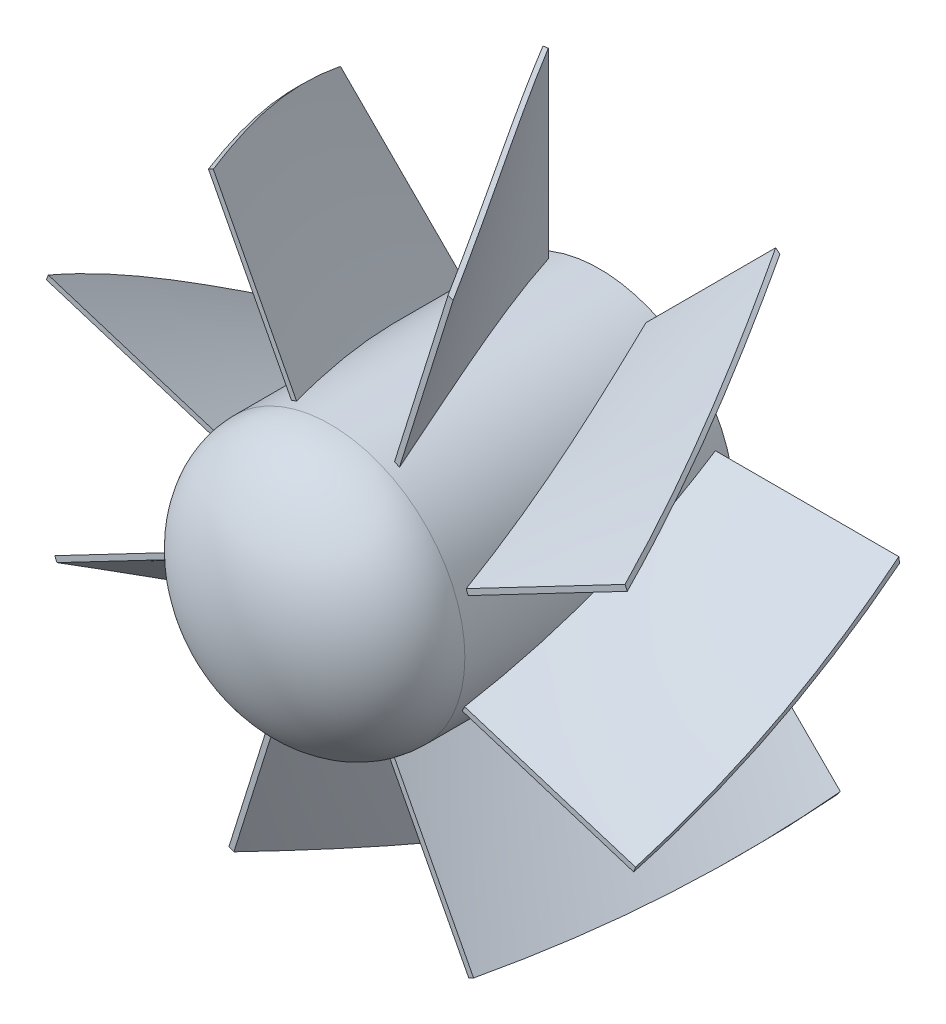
ISO-10303-21;
HEADER;
FILE_DESCRIPTION(('STEP AP214'),'2;1');
FILE_NAME('part.step','',(''),(''),'','','');
FILE_SCHEMA(('AUTOMOTIVE_DESIGN { 1 0 10303 214 1 1 1 1 }'));
ENDSEC;
DATA;
#1=APPLICATION_CONTEXT('core data for automotive mechanical design processes');
#2=APPLICATION_PROTOCOL_DEFINITION('international standard','automotive_design',2000,#1);
#3=PRODUCT_CONTEXT('',#1,'mechanical');
#4=PRODUCT('Part','Part','',(#3));
#5=PRODUCT_RELATED_PRODUCT_CATEGORY('part','',(#4));
#6=PRODUCT_DEFINITION_FORMATION('','',#4);
#7=PRODUCT_DEFINITION_CONTEXT('part definition',#1,'design');
#8=PRODUCT_DEFINITION('design','',#6,#7);
#9=PRODUCT_DEFINITION_SHAPE('','',#8);
#10=(LENGTH_UNIT() NAMED_UNIT(*) SI_UNIT(.MILLI.,.METRE.));
#11=(NAMED_UNIT(*) PLANE_ANGLE_UNIT() SI_UNIT($,.RADIAN.));
#12=(NAMED_UNIT(*) SI_UNIT($,.STERADIAN.) SOLID_ANGLE_UNIT());
#13=UNCERTAINTY_MEASURE_WITH_UNIT(LENGTH_MEASURE(1.E-05),#10,'distance_accuracy_value','');
#14=(GEOMETRIC_REPRESENTATION_CONTEXT(3) GLOBAL_UNCERTAINTY_ASSIGNED_CONTEXT((#13)) GLOBAL_UNIT_ASSIGNED_CONTEXT((#10,
#11,#12)) REPRESENTATION_CONTEXT('',''));
#15=CARTESIAN_POINT('',(0.,0.,0.));
#16=DIRECTION('',(0.,0.,1.));
#17=DIRECTION('',(1.,0.,0.));
#18=AXIS2_PLACEMENT_3D('',#15,#16,#17);
#19=CARTESIAN_POINT('',(0.,0.,60.96));
#20=DIRECTION('',(0.,0.,1.));
#21=DIRECTION('',(1.,0.,0.));
#22=AXIS2_PLACEMENT_3D('',#19,#20,#21);
#23=PLANE('',#22);
#24=DIRECTION('',(-0.954317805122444,0.298793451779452,0.));
#25=VECTOR('',#24,1.);
#26=CARTESIAN_POINT('',(-26.0189837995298,12.9773985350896,60.96));
#27=LINE('',#26,#25);
#28=CARTESIAN_POINT('',(-28.6009469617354,13.785801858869,60.96));
#29=VERTEX_POINT('',#28);
#30=CARTESIAN_POINT('',(-69.0192998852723,26.44064191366,60.96));
#31=VERTEX_POINT('',#30);
#32=EDGE_CURVE('E1185',#29,#31,#27,.T.);
#33=ORIENTED_EDGE('',*,*,#32,.T.);
#34=CARTESIAN_POINT('',(0.,0.,60.96));
#35=DIRECTION('',(0.,0.,1.));
#36=DIRECTION('',(1.,0.,0.));
#37=AXIS2_PLACEMENT_3D('',#34,#35,#36);
#38=CIRCLE('',#37,73.9105628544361);
#39=CARTESIAN_POINT('',(-69.4640507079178,25.2490982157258,60.96));
#40=VERTEX_POINT('',#39);
#41=EDGE_CURVE('E118',#31,#40,#38,.T.);
#42=ORIENTED_EDGE('',*,*,#41,.T.);
#43=DIRECTION('',(0.954317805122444,-0.298793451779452,0.));
#44=VECTOR('',#43,1.);
#45=CARTESIAN_POINT('',(-77.1984514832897,27.6707111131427,60.96));
#46=LINE('',#45,#44);
#47=CARTESIAN_POINT('',(-29.1333962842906,12.6217162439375,60.96));
#48=VERTEX_POINT('',#47);
#49=EDGE_CURVE('E104',#40,#48,#46,.T.);
#50=ORIENTED_EDGE('',*,*,#49,.T.);
#51=CARTESIAN_POINT('',(0.,0.,60.96));
#52=DIRECTION('',(0.,0.,1.));
#53=DIRECTION('',(1.,0.,0.));
#54=AXIS2_PLACEMENT_3D('',#51,#52,#53);
#55=CIRCLE('',#54,31.75);
#56=EDGE_CURVE('E1307',#29,#48,#55,.T.);
#57=ORIENTED_EDGE('',*,*,#56,.F.);
#58=EDGE_LOOP('',(#33,#42,#50,#57));
#59=FACE_BOUND('',#58,.T.);
#60=ADVANCED_FACE('F99',(#59),#23,.T.);
#61=CARTESIAN_POINT('',(0.,0.,2.54));
#62=DIRECTION('',(0.,0.,1.));
#63=DIRECTION('',(1.,0.,0.));
#64=AXIS2_PLACEMENT_3D('',#61,#62,#63);
#65=PLANE('',#64);
#66=CARTESIAN_POINT('',(0.,0.,2.54));
#67=DIRECTION('',(0.,0.,1.));
#68=DIRECTION('',(1.,0.,0.));
#69=AXIS2_PLACEMENT_3D('',#66,#67,#68);
#70=CIRCLE('',#69,73.9105628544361);
#71=CARTESIAN_POINT('',(-73.2944299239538,-9.52354154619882,2.54));
#72=VERTEX_POINT('',#71);
#73=CARTESIAN_POINT('',(-73.1181972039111,-10.7935415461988,2.54));
#74=VERTEX_POINT('',#73);
#75=EDGE_CURVE('E1529',#72,#74,#70,.T.);
#76=ORIENTED_EDGE('',*,*,#75,.F.);
#77=DIRECTION('',(-1.,0.,0.));
#78=VECTOR('',#77,1.);
#79=CARTESIAN_POINT('',(-26.024008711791,-9.52354154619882,2.54));
#80=LINE('',#79,#78);
#81=CARTESIAN_POINT('',(-30.2880282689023,-9.52354154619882,2.54));
#82=VERTEX_POINT('',#81);
#83=EDGE_CURVE('E1289',#82,#72,#80,.T.);
#84=ORIENTED_EDGE('',*,*,#83,.F.);
#85=CARTESIAN_POINT('',(0.,0.,2.54));
#86=DIRECTION('',(0.,0.,1.));
#87=DIRECTION('',(1.,0.,0.));
#88=AXIS2_PLACEMENT_3D('',#85,#86,#87);
#89=CIRCLE('',#88,31.75);
#90=CARTESIAN_POINT('',(-29.8590348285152,-10.7935415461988,2.54));
#91=VERTEX_POINT('',#90);
#92=EDGE_CURVE('E1303',#82,#91,#89,.T.);
#93=ORIENTED_EDGE('',*,*,#92,.T.);
#94=DIRECTION('',(1.,0.,0.));
#95=VECTOR('',#94,1.);
#96=CARTESIAN_POINT('',(-26.024008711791,-10.7935415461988,2.54));
#97=LINE('',#96,#95);
#98=EDGE_CURVE('E1269',#74,#91,#97,.T.);
#99=ORIENTED_EDGE('',*,*,#98,.F.);
#100=EDGE_LOOP('',(#76,#84,#93,#99));
#101=FACE_BOUND('',#100,.T.);
#102=ADVANCED_FACE('F1205',(#101),#65,.F.);
#103=CARTESIAN_POINT('',(-76.824008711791,-10.7935415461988,2.54));
#104=CARTESIAN_POINT('',(-77.1984514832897,27.6707111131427,60.96));
#105=CARTESIAN_POINT('',(-68.3573420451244,-10.7935415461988,2.54));
#106=CARTESIAN_POINT('',(-68.7317848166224,25.0198284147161,60.96));
#107=CARTESIAN_POINT('',(-59.8906753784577,-10.7935415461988,2.54));
#108=CARTESIAN_POINT('',(-60.2651181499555,22.3689457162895,60.96));
#109=CARTESIAN_POINT('',(-42.9573420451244,-10.7935415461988,2.54));
#110=CARTESIAN_POINT('',(-43.3317848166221,17.0671803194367,60.96));
#111=CARTESIAN_POINT('',(-34.4906753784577,-10.7935415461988,2.54));
#112=CARTESIAN_POINT('',(-34.8651181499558,14.4162976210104,60.96));
#113=CARTESIAN_POINT('',(-26.024008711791,-10.7935415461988,2.54));
#114=CARTESIAN_POINT('',(-26.3984514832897,11.7654149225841,60.96));
#115=B_SPLINE_SURFACE_WITH_KNOTS('',3,1,((#103,#104),(#105,#106),(#107,#108),(#109,#110),(#111,
#112),(#113,#114)),.UNSPECIFIED.,.F.,.F.,.F.,(4,2,4),(2,2),(0.,0.5,1.),(0.,1.),.UNSPECIFIED.);
#116=CARTESIAN_POINT('',(-69.4640507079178,25.2490982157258,60.96));
#117=CARTESIAN_POINT('',(-69.7203545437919,24.5440042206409,59.6828997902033));
#118=CARTESIAN_POINT('',(-69.9670919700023,23.8317195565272,58.407845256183));
#119=CARTESIAN_POINT('',(-70.4405315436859,22.3936464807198,55.8615768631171));
#120=CARTESIAN_POINT('',(-70.6672329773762,21.6678575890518,54.5903631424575));
#121=CARTESIAN_POINT('',(-71.0996825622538,20.2036943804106,52.0515999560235));
#122=CARTESIAN_POINT('',(-71.3054304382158,19.4653198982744,50.7840505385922));
#123=CARTESIAN_POINT('',(-71.6951050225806,17.9770633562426,48.2525449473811));
#124=CARTESIAN_POINT('',(-71.8790340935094,17.2271825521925,46.9885883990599));
#125=CARTESIAN_POINT('',(-72.2243082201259,15.7168903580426,44.4639098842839));
#126=CARTESIAN_POINT('',(-72.3856536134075,14.9564791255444,43.203187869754));
#127=CARTESIAN_POINT('',(-72.6850420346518,13.4262351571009,40.6847333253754));
#128=CARTESIAN_POINT('',(-72.8230854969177,12.6564025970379,39.4270007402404));
#129=CARTESIAN_POINT('',(-73.0986147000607,10.9648538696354,36.6811268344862));
#130=CARTESIAN_POINT('',(-73.2312453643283,10.0414573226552,35.1935304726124));
#131=CARTESIAN_POINT('',(-73.4619078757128,8.18500690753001,32.2216213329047));
#132=CARTESIAN_POINT('',(-73.5599386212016,7.25195273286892,30.7373086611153));
#133=CARTESIAN_POINT('',(-73.7206096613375,5.37837994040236,27.7716403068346));
#134=CARTESIAN_POINT('',(-73.7832526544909,4.43786189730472,26.29028440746));
#135=CARTESIAN_POINT('',(-73.8725441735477,2.55147776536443,23.3299572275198));
#136=CARTESIAN_POINT('',(-73.8991939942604,1.60561187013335,21.8509858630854));
#137=CARTESIAN_POINT('',(-73.9132964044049,0.0222137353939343,19.380816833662));
#138=CARTESIAN_POINT('',(-73.9107550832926,-0.614454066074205,18.3891106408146));
#139=CARTESIAN_POINT('',(-73.8891780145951,-1.88854055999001,16.406354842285));
#140=CARTESIAN_POINT('',(-73.870142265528,-2.52595925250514,15.4153052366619));
#141=CARTESIAN_POINT('',(-73.8155257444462,-3.80086224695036,13.4337057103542));
#142=CARTESIAN_POINT('',(-73.7799449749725,-4.43834654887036,12.4431557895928));
#143=CARTESIAN_POINT('',(-73.692219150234,-5.71281171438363,10.4622119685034));
#144=CARTESIAN_POINT('',(-73.6400711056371,-6.34979246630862,9.47181812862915));
#145=CARTESIAN_POINT('',(-73.5192359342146,-7.62244992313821,7.49119969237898));
#146=CARTESIAN_POINT('',(-73.4505487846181,-8.25812662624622,6.50097509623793));
#147=CARTESIAN_POINT('',(-73.2967063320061,-9.52749457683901,4.5205270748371));
#148=CARTESIAN_POINT('',(-73.2115509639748,-10.1611858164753,3.53030364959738));
#149=CARTESIAN_POINT('',(-73.118197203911,-10.7935415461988,2.54));
#150=B_SPLINE_CURVE_WITH_KNOTS('',3,(#116,#117,#118,#119,#120,#121,#122,#123,#124,#125,#126,
#127,#128,#129,#130,#131,#132,#133,#134,#135,#136,#137,#138,#139,#140,#141,#142,#143,#144,#145,
#146,#147,#148,#149),.UNSPECIFIED.,.F.,.F.,(4,2,2,2,2,2,2,2,2,2,2,2,2,2,2,2,4),(0.,
4.44343531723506,8.88702886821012,13.3306807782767,17.7738510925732,22.2169549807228,
26.6599760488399,31.9273070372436,37.1948057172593,42.4619026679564,47.7288101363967,
51.2641681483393,54.7995264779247,58.334884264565,61.8708803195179,65.4068812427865,
68.9428961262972),.UNSPECIFIED.);
#151=EDGE_CURVE('E1534',#40,#74,#150,.T.);
#152=CARTESIAN_POINT('',(-29.1333962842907,12.6217162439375,60.96));
#153=CARTESIAN_POINT('',(-29.3215129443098,12.1875359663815,59.7235677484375));
#154=CARTESIAN_POINT('',(-29.5008189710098,11.7470240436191,58.4880118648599));
#155=CARTESIAN_POINT('',(-29.8408649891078,10.8541826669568,56.0186051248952));
#156=CARTESIAN_POINT('',(-30.0016048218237,10.4018531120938,54.7847542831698));
#157=CARTESIAN_POINT('',(-30.3035743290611,9.48621787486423,52.3186992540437));
#158=CARTESIAN_POINT('',(-30.4448035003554,9.0229119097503,51.0864951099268));
#159=CARTESIAN_POINT('',(-30.7068550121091,8.08628623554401,48.6237228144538));
#160=CARTESIAN_POINT('',(-30.8276773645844,7.61296653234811,47.3931546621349));
#161=CARTESIAN_POINT('',(-31.048082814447,6.6572928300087,44.9334985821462));
#162=CARTESIAN_POINT('',(-31.1476640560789,6.17493804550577,43.7044107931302));
#163=CARTESIAN_POINT('',(-31.3247911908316,5.20233471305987,41.2477818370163));
#164=CARTESIAN_POINT('',(-31.4023372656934,4.71208623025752,40.0202406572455));
#165=CARTESIAN_POINT('',(-31.5346774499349,3.72486693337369,37.5666678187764));
#166=CARTESIAN_POINT('',(-31.5894721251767,3.22789628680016,36.3406361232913));
#167=CARTESIAN_POINT('',(-31.6756720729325,2.2284330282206,33.8899555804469));
#168=CARTESIAN_POINT('',(-31.707076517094,1.72594022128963,32.6653067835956));
#169=CARTESIAN_POINT('',(-31.7520624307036,0.557281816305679,29.8306131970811));
#170=CARTESIAN_POINT('',(-31.7568771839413,-0.110432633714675,28.2210587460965));
#171=CARTESIAN_POINT('',(-31.7239429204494,-1.45016945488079,25.004052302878));
#172=CARTESIAN_POINT('',(-31.686190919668,-2.12219212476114,23.3966004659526));
#173=CARTESIAN_POINT('',(-31.5673237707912,-3.46734088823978,20.1837140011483));
#174=CARTESIAN_POINT('',(-31.4862077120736,-4.14046700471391,18.5782794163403));
#175=CARTESIAN_POINT('',(-31.2799765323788,-5.48533769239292,15.3674137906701));
#176=CARTESIAN_POINT('',(-31.1548093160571,-6.15707967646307,13.7619850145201));
#177=CARTESIAN_POINT('',(-30.8602633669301,-7.49505422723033,10.5528739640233));
#178=CARTESIAN_POINT('',(-30.6908849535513,-8.16128683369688,8.94919167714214));
#179=CARTESIAN_POINT('',(-30.4037143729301,-9.15398058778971,6.5448961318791));
#180=CARTESIAN_POINT('',(-30.3024711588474,-9.48377631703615,5.74365175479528));
#181=CARTESIAN_POINT('',(-30.0889895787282,-10.1407356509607,4.14154653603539));
#182=CARTESIAN_POINT('',(-29.9767511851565,-10.467899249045,3.34068569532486));
#183=CARTESIAN_POINT('',(-29.8590348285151,-10.7935415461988,2.54));
#184=B_SPLINE_CURVE_WITH_KNOTS('',3,(#152,#153,#154,#155,#156,#157,#158,#159,#160,#161,#162,
#163,#164,#165,#166,#167,#168,#169,#170,#171,#172,#173,#174,#175,#176,#177,#178,#179,#180,#181,
#182,#183),.UNSPECIFIED.,.F.,.F.,(4,2,2,2,2,2,2,2,2,2,2,2,2,2,2,4),(0.,3.97161228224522,
7.94325850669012,11.9150071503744,15.8867534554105,19.8588466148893,23.8309070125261,
27.802868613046,31.7749708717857,37.0021239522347,42.2296434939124,47.4572728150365,
52.691105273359,57.9248999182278,60.5419095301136,63.1589256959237),.UNSPECIFIED.);
#185=EDGE_CURVE('E1310',#48,#91,#184,.T.);
#186=ORIENTED_EDGE('',*,*,#49,.F.);
#187=ORIENTED_EDGE('',*,*,#151,.T.);
#188=ORIENTED_EDGE('',*,*,#98,.T.);
#189=ORIENTED_EDGE('',*,*,#185,.F.);
#190=EDGE_LOOP('',(#186,#187,#188,#189));
#191=FACE_BOUND('',#190,.T.);
#192=ADVANCED_FACE('F1231',(#191),#115,.T.);
#193=CARTESIAN_POINT('',(-26.024008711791,-9.52354154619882,2.54));
#194=CARTESIAN_POINT('',(-26.0189837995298,12.9773985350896,60.96));
#195=CARTESIAN_POINT('',(-34.4906753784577,-9.52354154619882,2.54));
#196=CARTESIAN_POINT('',(-34.4856504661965,15.6282812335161,60.96));
#197=CARTESIAN_POINT('',(-42.9573420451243,-9.52354154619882,2.54));
#198=CARTESIAN_POINT('',(-42.9523171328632,18.2791639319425,60.96));
#199=CARTESIAN_POINT('',(-59.8906753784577,-9.52354154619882,2.54));
#200=CARTESIAN_POINT('',(-59.8856504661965,23.5809293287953,60.96));
#201=CARTESIAN_POINT('',(-68.3573420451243,-9.52354154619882,2.54));
#202=CARTESIAN_POINT('',(-68.3523171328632,26.2318120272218,60.96));
#203=CARTESIAN_POINT('',(-76.824008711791,-9.52354154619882,2.54));
#204=CARTESIAN_POINT('',(-76.8189837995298,28.8826947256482,60.96));
#205=B_SPLINE_SURFACE_WITH_KNOTS('',3,1,((#193,#194),(#195,#196),(#197,#198),(#199,#200),(#201,
#202),(#203,#204)),.UNSPECIFIED.,.F.,.F.,.F.,(4,2,4),(2,2),(0.,0.5,1.),(0.,1.),.UNSPECIFIED.);
#206=CARTESIAN_POINT('',(-73.2944299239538,-9.52354154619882,2.54));
#207=CARTESIAN_POINT('',(-73.3977993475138,-8.7281279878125,3.78575660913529));
#208=CARTESIAN_POINT('',(-73.4882233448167,-7.93075336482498,5.03133453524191));
#209=CARTESIAN_POINT('',(-73.6430724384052,-6.33343280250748,7.52247044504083));
#210=CARTESIAN_POINT('',(-73.7074973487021,-5.53348684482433,8.76802842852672));
#211=CARTESIAN_POINT('',(-73.810238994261,-3.93238184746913,11.2594502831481));
#212=CARTESIAN_POINT('',(-73.8485555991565,-3.1312228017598,12.5053141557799));
#213=CARTESIAN_POINT('',(-73.8990822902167,-1.52932481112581,14.9972478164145));
#214=CARTESIAN_POINT('',(-73.9113011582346,-0.728585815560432,16.2433173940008));
#215=CARTESIAN_POINT('',(-73.9097555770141,0.871384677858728,18.7363941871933));
#216=CARTESIAN_POINT('',(-73.8959913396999,1.67061618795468,19.983401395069));
#217=CARTESIAN_POINT('',(-73.8426725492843,3.26622471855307,22.4786555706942));
#218=CARTESIAN_POINT('',(-73.8031184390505,4.06260178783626,23.7269025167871));
#219=CARTESIAN_POINT('',(-73.6888051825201,5.79840255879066,26.4564488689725));
#220=CARTESIAN_POINT('',(-73.6088803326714,6.73698578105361,27.9380691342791));
#221=CARTESIAN_POINT('',(-73.4138160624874,8.60615439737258,30.9040065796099));
#222=CARTESIAN_POINT('',(-73.2986770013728,9.53673987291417,32.3883237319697));
#223=CARTESIAN_POINT('',(-73.03397927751,11.3878607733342,35.360177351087));
#224=CARTESIAN_POINT('',(-72.8844201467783,12.3083960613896,36.8477138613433));
#225=CARTESIAN_POINT('',(-72.5518348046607,14.1374155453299,39.8264616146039));
#226=CARTESIAN_POINT('',(-72.3688085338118,15.0458997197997,41.3176728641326));
#227=CARTESIAN_POINT('',(-72.0359328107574,16.552328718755,43.8129325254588));
#228=CARTESIAN_POINT('',(-71.8949767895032,17.1541134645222,44.8158605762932));
#229=CARTESIAN_POINT('',(-71.5988635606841,18.3508578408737,46.8236954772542));
#230=CARTESIAN_POINT('',(-71.443706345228,18.9458174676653,47.8286023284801));
#231=CARTESIAN_POINT('',(-71.1195841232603,20.128386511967,49.8405143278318));
#232=CARTESIAN_POINT('',(-70.950619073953,20.7159959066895,50.8475194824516));
#233=CARTESIAN_POINT('',(-70.5992980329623,21.8833723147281,52.863753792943));
#234=CARTESIAN_POINT('',(-70.4169418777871,22.463139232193,53.8729829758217));
#235=CARTESIAN_POINT('',(-70.0392806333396,23.614347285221,55.8937599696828));
#236=CARTESIAN_POINT('',(-69.8439755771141,24.1857884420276,56.9053077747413));
#237=CARTESIAN_POINT('',(-69.4408833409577,25.3199009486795,58.9308162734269));
#238=CARTESIAN_POINT('',(-69.2330962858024,25.88257238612,59.9447769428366));
#239=CARTESIAN_POINT('',(-69.0192998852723,26.44064191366,60.96));
#240=B_SPLINE_CURVE_WITH_KNOTS('',3,(#206,#207,#208,#209,#210,#211,#212,#213,#214,#215,#216,
#217,#218,#219,#220,#221,#222,#223,#224,#225,#226,#227,#228,#229,#230,#231,#232,#233,#234,#235,
#236,#237,#238,#239),.UNSPECIFIED.,.F.,.F.,(4,2,2,2,2,2,2,2,2,2,2,2,2,2,2,2,4),(0.,
4.44488223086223,8.88979625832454,13.334732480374,17.7781727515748,22.2215767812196,
26.6649045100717,31.9316552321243,37.1983522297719,42.4651208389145,47.731898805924,
51.2660482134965,54.8001995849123,58.3343619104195,61.8685673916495,65.4027638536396,
68.9369249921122),.UNSPECIFIED.);
#241=EDGE_CURVE('E1528',#72,#31,#240,.T.);
#242=CARTESIAN_POINT('',(-30.2880282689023,-9.52354154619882,2.54));
#243=CARTESIAN_POINT('',(-30.444266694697,-9.02670813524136,3.75770130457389));
#244=CARTESIAN_POINT('',(-30.5880380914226,-8.52668945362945,4.97569859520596));
#245=CARTESIAN_POINT('',(-30.8505351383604,-7.52172852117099,7.41234822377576));
#246=CARTESIAN_POINT('',(-30.9692610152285,-7.01678631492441,8.63100055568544));
#247=CARTESIAN_POINT('',(-31.1815297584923,-6.00355185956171,11.0687191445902));
#248=CARTESIAN_POINT('',(-31.2750793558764,-5.49526054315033,12.2877852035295));
#249=CARTESIAN_POINT('',(-31.4370508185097,-4.47663641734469,14.7267366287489));
#250=CARTESIAN_POINT('',(-31.5054726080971,-3.96630360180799,15.9466219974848));
#251=CARTESIAN_POINT('',(-31.6172921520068,-2.94503266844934,18.3872838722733));
#252=CARTESIAN_POINT('',(-31.6606899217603,-2.43409455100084,19.6080603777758));
#253=CARTESIAN_POINT('',(-31.7226644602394,-1.41303259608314,22.0505737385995));
#254=CARTESIAN_POINT('',(-31.7412413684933,-0.902908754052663,23.2723105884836));
#255=CARTESIAN_POINT('',(-31.7538729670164,0.115218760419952,25.7170227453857));
#256=CARTESIAN_POINT('',(-31.7479237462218,0.623222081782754,26.939998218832));
#257=CARTESIAN_POINT('',(-31.7118853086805,1.63567913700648,29.3870856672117));
#258=CARTESIAN_POINT('',(-31.6817955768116,2.14013279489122,30.6111976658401));
#259=CARTESIAN_POINT('',(-31.5847416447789,3.30233174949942,33.4464660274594));
#260=CARTESIAN_POINT('',(-31.5091468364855,3.95830211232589,35.0580616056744));
#261=CARTESIAN_POINT('',(-31.3183254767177,5.25900349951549,38.2835772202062));
#262=CARTESIAN_POINT('',(-31.2030957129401,5.9037336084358,39.8974974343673));
#263=CARTESIAN_POINT('',(-30.9345350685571,7.17926455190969,43.1277850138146));
#264=CARTESIAN_POINT('',(-30.7812018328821,7.8100645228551,44.7441525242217));
#265=CARTESIAN_POINT('',(-30.4381059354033,9.05547301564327,47.9800435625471));
#266=CARTESIAN_POINT('',(-30.2483278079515,9.67007453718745,49.5995681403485));
#267=CARTESIAN_POINT('',(-29.8343110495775,10.8805095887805,52.8411311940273));
#268=CARTESIAN_POINT('',(-29.6100743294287,11.4763441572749,54.46316952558));
#269=CARTESIAN_POINT('',(-29.2494419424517,12.3544644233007,56.8980972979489));
#270=CARTESIAN_POINT('',(-29.1251937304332,12.6445476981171,57.7099991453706));
#271=CARTESIAN_POINT('',(-28.8688719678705,13.2192947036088,59.3344828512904));
#272=CARTESIAN_POINT('',(-28.7367984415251,13.5039584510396,60.147064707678));
#273=CARTESIAN_POINT('',(-28.6009469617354,13.785801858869,60.96));
#274=B_SPLINE_CURVE_WITH_KNOTS('',3,(#242,#243,#244,#245,#246,#247,#248,#249,#250,#251,#252,
#253,#254,#255,#256,#257,#258,#259,#260,#261,#262,#263,#264,#265,#266,#267,#268,#269,#270,#271,
#272,#273),.UNSPECIFIED.,.F.,.F.,(4,2,2,2,2,2,2,2,2,2,2,2,2,2,2,4),(0.,3.97314945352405,
7.94626294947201,11.9183131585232,15.8903753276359,19.8624350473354,23.8344724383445,
27.8071432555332,31.7798988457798,37.0042507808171,42.2290262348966,47.4541246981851,
52.6814453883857,57.9084763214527,60.5216545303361,63.1348246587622),.UNSPECIFIED.);
#275=EDGE_CURVE('E1298',#82,#29,#274,.T.);
#276=ORIENTED_EDGE('',*,*,#83,.T.);
#277=ORIENTED_EDGE('',*,*,#241,.T.);
#278=ORIENTED_EDGE('',*,*,#32,.F.);
#279=ORIENTED_EDGE('',*,*,#275,.F.);
#280=EDGE_LOOP('',(#276,#277,#278,#279));
#281=FACE_BOUND('',#280,.T.);
#282=ADVANCED_FACE('F1203',(#281),#205,.T.);
#283=CARTESIAN_POINT('',(0.,0.,60.96));
#284=DIRECTION('',(0.,0.,1.));
#285=DIRECTION('',(0.707106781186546,0.707106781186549,0.));
#286=AXIS2_PLACEMENT_3D('',#283,#284,#285);
#287=PLANE('',#286);
#288=DIRECTION('',(-0.886083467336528,-0.463525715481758,0.));
#289=VECTOR('',#288,1.);
#290=CARTESIAN_POINT('',(-27.5746063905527,-9.22179337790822,60.96));
#291=LINE('',#290,#289);
#292=CARTESIAN_POINT('',(-29.9719575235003,-10.4758895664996,60.96));
#293=VERTEX_POINT('',#292);
#294=CARTESIAN_POINT('',(-67.5003721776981,-30.1076577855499,60.96));
#295=VERTEX_POINT('',#294);
#296=EDGE_CURVE('E1070',#293,#295,#291,.T.);
#297=ORIENTED_EDGE('',*,*,#296,.T.);
#298=CARTESIAN_POINT('',(0.,0.,60.96));
#299=DIRECTION('',(0.,0.,1.));
#300=DIRECTION('',(1.,0.,0.));
#301=AXIS2_PLACEMENT_3D('',#298,#299,#300);
#302=CIRCLE('',#301,73.9105628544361);
#303=CARTESIAN_POINT('',(-66.9723098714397,-31.2646927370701,60.96));
#304=VERTEX_POINT('',#303);
#305=EDGE_CURVE('E126',#295,#304,#302,.T.);
#306=ORIENTED_EDGE('',*,*,#305,.T.);
#307=DIRECTION('',(0.886083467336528,0.463525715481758,0.));
#308=VECTOR('',#307,1.);
#309=CARTESIAN_POINT('',(-74.1536960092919,-35.0214010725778,60.96));
#310=LINE('',#309,#308);
#311=CARTESIAN_POINT('',(-29.5253232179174,-11.6755209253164,60.96));
#312=VERTEX_POINT('',#311);
#313=EDGE_CURVE('E1156',#304,#312,#310,.T.);
#314=ORIENTED_EDGE('',*,*,#313,.T.);
#315=CARTESIAN_POINT('',(0.,0.,60.96));
#316=DIRECTION('',(0.,0.,1.));
#317=DIRECTION('',(1.,0.,0.));
#318=AXIS2_PLACEMENT_3D('',#315,#316,#317);
#319=CIRCLE('',#318,31.75);
#320=EDGE_CURVE('E1322',#293,#312,#319,.T.);
#321=ORIENTED_EDGE('',*,*,#320,.F.);
#322=EDGE_LOOP('',(#297,#306,#314,#321));
#323=FACE_BOUND('',#322,.T.);
#324=ADVANCED_FACE('F1194',(#323),#287,.T.);
#325=CARTESIAN_POINT('',(0.,0.,2.54));
#326=DIRECTION('',(0.,0.,1.));
#327=DIRECTION('',(0.707106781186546,0.707106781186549,0.));
#328=AXIS2_PLACEMENT_3D('',#325,#326,#327);
#329=PLANE('',#328);
#330=CARTESIAN_POINT('',(0.,0.,2.54));
#331=DIRECTION('',(0.,0.,1.));
#332=DIRECTION('',(1.,0.,0.));
#333=AXIS2_PLACEMENT_3D('',#330,#331,#332);
#334=CIRCLE('',#333,73.9105628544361);
#335=CARTESIAN_POINT('',(-45.0928276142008,-58.561149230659,2.54));
#336=VERTEX_POINT('',#335);
#337=CARTESIAN_POINT('',(-44.0701866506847,-59.3345594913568,2.54));
#338=VERTEX_POINT('',#337);
#339=EDGE_CURVE('E1609',#336,#338,#334,.T.);
#340=ORIENTED_EDGE('',*,*,#339,.F.);
#341=DIRECTION('',(-0.707106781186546,-0.707106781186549,0.));
#342=VECTOR('',#341,1.);
#343=CARTESIAN_POINT('',(-11.6675922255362,-25.1359138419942,2.54));
#344=LINE('',#343,#342);
#345=CARTESIAN_POINT('',(-14.6827093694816,-28.1510309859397,2.54));
#346=VERTEX_POINT('',#345);
#347=EDGE_CURVE('E1181',#346,#336,#344,.T.);
#348=ORIENTED_EDGE('',*,*,#347,.F.);
#349=CARTESIAN_POINT('',(0.,0.,2.54));
#350=DIRECTION('',(0.,0.,1.));
#351=DIRECTION('',(1.,0.,0.));
#352=AXIS2_PLACEMENT_3D('',#349,#350,#351);
#353=CIRCLE('',#352,31.75);
#354=CARTESIAN_POINT('',(-13.4813395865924,-28.7457124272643,2.54));
#355=VERTEX_POINT('',#354);
#356=EDGE_CURVE('E1318',#346,#355,#353,.T.);
#357=ORIENTED_EDGE('',*,*,#356,.T.);
#358=DIRECTION('',(0.707106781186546,0.707106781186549,0.));
#359=VECTOR('',#358,1.);
#360=CARTESIAN_POINT('',(-10.7695666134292,-26.0339394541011,2.54));
#361=LINE('',#360,#359);
#362=EDGE_CURVE('E1159',#338,#355,#361,.T.);
#363=ORIENTED_EDGE('',*,*,#362,.F.);
#364=EDGE_LOOP('',(#340,#348,#357,#363));
#365=FACE_BOUND('',#364,.T.);
#366=ADVANCED_FACE('F1090',(#365),#329,.F.);
#367=CARTESIAN_POINT('',(-46.6905910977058,-61.9549639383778,2.54));
#368=CARTESIAN_POINT('',(-74.1536960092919,-35.0214010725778,60.96));
#369=CARTESIAN_POINT('',(-40.7037536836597,-55.9681265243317,2.54));
#370=CARTESIAN_POINT('',(-66.2924014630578,-30.9090207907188,60.96));
#371=CARTESIAN_POINT('',(-34.7169162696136,-49.9812891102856,2.54));
#372=CARTESIAN_POINT('',(-58.4311069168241,-26.79664050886,60.96));
#373=CARTESIAN_POINT('',(-22.7432414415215,-38.0076142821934,2.54));
#374=CARTESIAN_POINT('',(-42.708517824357,-18.5718799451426,60.96));
#375=CARTESIAN_POINT('',(-16.7564040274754,-32.0207768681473,2.54));
#376=CARTESIAN_POINT('',(-34.8472232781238,-14.459499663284,60.96));
#377=CARTESIAN_POINT('',(-10.7695666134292,-26.0339394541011,2.54));
#378=CARTESIAN_POINT('',(-26.9859287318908,-10.3471193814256,60.96));
#379=B_SPLINE_SURFACE_WITH_KNOTS('',3,1,((#367,#368),(#369,#370),(#371,#372),(#373,#374),(#375,
#376),(#377,#378)),.UNSPECIFIED.,.F.,.F.,.F.,(4,2,4),(2,2),(0.,0.5,1.),(0.,1.),.UNSPECIFIED.);
#380=CARTESIAN_POINT('',(-66.9723098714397,-31.2646927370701,60.96));
#381=CARTESIAN_POINT('',(-66.6549673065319,-31.9445036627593,59.6828997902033));
#382=CARTESIAN_POINT('',(-66.3257756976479,-32.6226346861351,58.407845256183));
#383=CARTESIAN_POINT('',(-65.6436768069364,-33.974278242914,55.8615768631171));
#384=CARTESIAN_POINT('',(-65.2907686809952,-34.6477906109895,54.5903631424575));
#385=CARTESIAN_POINT('',(-64.5612369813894,-35.9888983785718,52.0515999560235));
#386=CARTESIAN_POINT('',(-64.1846130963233,-36.6564937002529,50.7840505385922));
#387=CARTESIAN_POINT('',(-63.4077983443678,-37.9843915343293,48.2525449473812));
#388=CARTESIAN_POINT('',(-63.0076100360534,-38.6446948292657,46.9885883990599));
#389=CARTESIAN_POINT('',(-62.1838178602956,-39.9567783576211,44.4639098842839));
#390=CARTESIAN_POINT('',(-61.7602143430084,-40.6085587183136,43.203187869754));
#391=CARTESIAN_POINT('',(-60.8898680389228,-41.9023041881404,40.6847333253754));
#392=CARTESIAN_POINT('',(-60.4431256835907,-42.5442694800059,39.4270007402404));
#393=CARTESIAN_POINT('',(-59.4418486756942,-43.9352036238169,36.6811268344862));
#394=CARTESIAN_POINT('',(-58.8826927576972,-44.6819276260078,35.1935304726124));
#395=CARTESIAN_POINT('',(-57.7330871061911,-46.1577393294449,32.2216213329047));
#396=CARTESIAN_POINT('',(-57.1426363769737,-46.8868264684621,30.7373086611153));
#397=CARTESIAN_POINT('',(-55.9314319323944,-48.3252540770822,27.7716403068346));
#398=CARTESIAN_POINT('',(-55.3106805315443,-49.0345960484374,26.29028440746));
#399=CARTESIAN_POINT('',(-54.0399441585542,-50.4316096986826,23.3299572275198));
#400=CARTESIAN_POINT('',(-53.3899602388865,-51.1192821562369,21.8509858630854));
#401=CARTESIAN_POINT('',(-52.2803005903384,-52.2488856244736,19.380816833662));
#402=CARTESIAN_POINT('',(-51.8283114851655,-52.6972807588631,18.3891106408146));
#403=CARTESIAN_POINT('',(-50.9121389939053,-53.582938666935,16.406354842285));
#404=CARTESIAN_POINT('',(-50.4479556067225,-54.0202014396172,15.4153052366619));
#405=CARTESIAN_POINT('',(-49.5078433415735,-54.8830742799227,13.4337057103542));
#406=CARTESIAN_POINT('',(-49.0319144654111,-55.3086843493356,12.4431557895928));
#407=CARTESIAN_POINT('',(-48.0686999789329,-56.1478357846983,10.4622119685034));
#408=CARTESIAN_POINT('',(-47.5814123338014,-56.5613749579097,9.47181812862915));
#409=CARTESIAN_POINT('',(-46.5960642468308,-57.3758363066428,7.49119969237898));
#410=CARTESIAN_POINT('',(-46.0980037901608,-57.7767584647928,6.50097509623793));
#411=CARTESIAN_POINT('',(-45.0916420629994,-58.5655541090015,4.5205270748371));
#412=CARTESIAN_POINT('',(-44.5833407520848,-58.9534275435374,3.53030364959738));
#413=CARTESIAN_POINT('',(-44.0701866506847,-59.3345594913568,2.54));
#414=B_SPLINE_CURVE_WITH_KNOTS('',3,(#380,#381,#382,#383,#384,#385,#386,#387,#388,#389,#390,
#391,#392,#393,#394,#395,#396,#397,#398,#399,#400,#401,#402,#403,#404,#405,#406,#407,#408,#409,
#410,#411,#412,#413),.UNSPECIFIED.,.F.,.F.,(4,2,2,2,2,2,2,2,2,2,2,2,2,2,2,2,4),(0.,
4.44343531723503,8.88702886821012,13.3306807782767,17.7738510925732,22.2169549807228,
26.6599760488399,31.9273070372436,37.1948057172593,42.4619026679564,47.7288101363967,
51.2641681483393,54.7995264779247,58.334884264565,61.8708803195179,65.4068812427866,
68.9428961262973),.UNSPECIFIED.);
#415=EDGE_CURVE('E1608',#304,#338,#414,.T.);
#416=CARTESIAN_POINT('',(-29.5253232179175,-11.6755209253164,60.96));
#417=CARTESIAN_POINT('',(-29.3513299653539,-12.1155513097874,59.7235677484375));
#418=CARTESIAN_POINT('',(-29.1666295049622,-12.5538287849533,58.4880118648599));
#419=CARTESIAN_POINT('',(-28.7757441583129,-13.4256118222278,56.0186051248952));
#420=CARTESIAN_POINT('',(-28.5695590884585,-13.8591173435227,54.7847542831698));
#421=CARTESIAN_POINT('',(-28.1356318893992,-14.7200939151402,52.3186992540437));
#422=CARTESIAN_POINT('',(-27.9078892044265,-15.14756480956,51.0864951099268));
#423=CARTESIAN_POINT('',(-27.4308932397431,-15.9951575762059,48.6237228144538));
#424=CARTESIAN_POINT('',(-27.1816399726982,-16.4152794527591,47.3931546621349));
#425=CARTESIAN_POINT('',(-26.6617268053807,-17.2468929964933,44.9334985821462));
#426=CARTESIAN_POINT('',(-26.3910650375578,-17.65838390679,43.7044107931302));
#427=CARTESIAN_POINT('',(-25.8285784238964,-18.4713661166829,41.2477818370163));
#428=CARTESIAN_POINT('',(-25.5367537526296,-18.872857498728,40.0202406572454));
#429=CARTESIAN_POINT('',(-24.9322629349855,-19.6645055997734,37.5666678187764));
#430=CARTESIAN_POINT('',(-24.6195973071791,-20.0546626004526,36.3406361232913));
#431=CARTESIAN_POINT('',(-23.9738226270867,-20.8223424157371,33.8899555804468));
#432=CARTESIAN_POINT('',(-23.6407128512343,-21.1998647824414,32.6653067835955));
#433=CARTESIAN_POINT('',(-22.8461564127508,-22.0580409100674,29.8306131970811));
#434=CARTESIAN_POINT('',(-22.3774155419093,-22.5335908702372,28.2210587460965));
#435=CARTESIAN_POINT('',(-21.4067905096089,-23.4576398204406,25.004052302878));
#436=CARTESIAN_POINT('',(-20.9049040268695,-23.9061369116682,23.3966004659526));
#437=CARTESIAN_POINT('',(-19.869688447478,-24.7732489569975,20.1837140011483));
#438=CARTESIAN_POINT('',(-19.336358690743,-25.1918632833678,18.5782794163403));
#439=CARTESIAN_POINT('',(-18.2395640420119,-25.9970030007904,15.3674137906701));
#440=CARTESIAN_POINT('',(-17.6760641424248,-26.3834897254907,13.7619850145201));
#441=CARTESIAN_POINT('',(-16.5216978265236,-27.1213051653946,10.5528739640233));
#442=CARTESIAN_POINT('',(-15.9308316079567,-27.4726341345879,8.94919167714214));
#443=CARTESIAN_POINT('',(-15.0258308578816,-27.9715143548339,6.54489613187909));
#444=CARTESIAN_POINT('',(-14.7210402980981,-28.1331253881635,5.74365175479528));
#445=CARTESIAN_POINT('',(-14.1055456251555,-28.4467115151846,4.14154653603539));
#446=CARTESIAN_POINT('',(-13.7948414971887,-28.5986865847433,3.34068569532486));
#447=CARTESIAN_POINT('',(-13.4813395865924,-28.7457124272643,2.54));
#448=B_SPLINE_CURVE_WITH_KNOTS('',3,(#416,#417,#418,#419,#420,#421,#422,#423,#424,#425,#426,
#427,#428,#429,#430,#431,#432,#433,#434,#435,#436,#437,#438,#439,#440,#441,#442,#443,#444,#445,
#446,#447),.UNSPECIFIED.,.F.,.F.,(4,2,2,2,2,2,2,2,2,2,2,2,2,2,2,4),(0.,3.97161228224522,
7.94325850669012,11.9150071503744,15.8867534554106,19.8588466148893,23.8309070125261,
27.802868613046,31.7749708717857,37.0021239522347,42.2296434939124,47.4572728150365,
52.691105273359,57.9248999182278,60.5419095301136,63.1589256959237),.UNSPECIFIED.);
#449=EDGE_CURVE('E1324',#312,#355,#448,.T.);
#450=ORIENTED_EDGE('',*,*,#313,.F.);
#451=ORIENTED_EDGE('',*,*,#415,.T.);
#452=ORIENTED_EDGE('',*,*,#362,.T.);
#453=ORIENTED_EDGE('',*,*,#449,.F.);
#454=EDGE_LOOP('',(#450,#451,#452,#453));
#455=FACE_BOUND('',#454,.T.);
#456=ADVANCED_FACE('F1118',(#455),#379,.T.);
#457=CARTESIAN_POINT('',(-11.6675922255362,-25.1359138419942,2.54));
#458=CARTESIAN_POINT('',(-27.5746063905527,-9.22179337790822,60.96));
#459=CARTESIAN_POINT('',(-17.6544296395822,-31.1227512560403,2.54));
#460=CARTESIAN_POINT('',(-35.4359009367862,-13.3341736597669,60.96));
#461=CARTESIAN_POINT('',(-23.6412670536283,-37.1095886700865,2.54));
#462=CARTESIAN_POINT('',(-43.2971954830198,-17.4465539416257,60.96));
#463=CARTESIAN_POINT('',(-35.6149418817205,-49.0832634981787,2.54));
#464=CARTESIAN_POINT('',(-59.0197845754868,-25.6713145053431,60.96));
#465=CARTESIAN_POINT('',(-41.6017792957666,-55.0701009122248,2.54));
#466=CARTESIAN_POINT('',(-66.8810791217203,-29.7836947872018,60.96));
#467=CARTESIAN_POINT('',(-47.5886167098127,-61.0569383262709,2.54));
#468=CARTESIAN_POINT('',(-74.7423736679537,-33.8960750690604,60.96));
#469=B_SPLINE_SURFACE_WITH_KNOTS('',3,1,((#457,#458),(#459,#460),(#461,#462),(#463,#464),(#465,
#466),(#467,#468)),.UNSPECIFIED.,.F.,.F.,.F.,(4,2,4),(2,2),(0.,0.5,1.),(0.,1.),.UNSPECIFIED.);
#470=CARTESIAN_POINT('',(-45.0928276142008,-58.561149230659,2.54));
#471=CARTESIAN_POINT('',(-45.7283631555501,-58.071800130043,3.7857566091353));
#472=CARTESIAN_POINT('',(-46.3561315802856,-57.5719105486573,5.03133453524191));
#473=CARTESIAN_POINT('',(-47.595102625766,-56.5519291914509,7.52247044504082));
#474=CARTESIAN_POINT('',(-48.2063051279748,-56.0318372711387,8.76802842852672));
#475=CARTESIAN_POINT('',(-49.4111066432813,-54.9723343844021,11.2594502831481));
#476=CARTESIAN_POINT('',(-50.004705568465,-54.4329233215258,12.5053141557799));
#477=CARTESIAN_POINT('',(-51.1731462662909,-53.3359381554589,14.9972478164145));
#478=CARTESIAN_POINT('',(-51.7479942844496,-52.778370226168,16.2433173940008));
#479=CARTESIAN_POINT('',(-52.8782513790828,-51.6459273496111,18.7363941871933));
#480=CARTESIAN_POINT('',(-53.4336606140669,-51.0710525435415,19.983401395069));
#481=CARTESIAN_POINT('',(-54.5242241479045,-49.9050848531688,22.4786555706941));
#482=CARTESIAN_POINT('',(-55.059378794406,-49.313992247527,23.7269025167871));
#483=CARTESIAN_POINT('',(-56.2059436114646,-48.0057640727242,26.4564488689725));
#484=CARTESIAN_POINT('',(-56.8131067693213,-47.2855701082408,27.938069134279));
#485=CARTESIAN_POINT('',(-57.9968773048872,-45.8259370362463,30.9040065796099));
#486=CARTESIAN_POINT('',(-58.5734849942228,-45.0864981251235,32.3883237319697));
#487=CARTESIAN_POINT('',(-59.6952555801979,-43.5903884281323,35.360177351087));
#488=CARTESIAN_POINT('',(-60.2404180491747,-42.8337174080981,36.8477138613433));
#489=CARTESIAN_POINT('',(-61.2985567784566,-41.305231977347,39.8264616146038));
#490=CARTESIAN_POINT('',(-61.8115329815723,-40.5334175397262,41.3176728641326));
#491=CARTESIAN_POINT('',(-62.6413604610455,-39.2328326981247,43.8129325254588));
#492=CARTESIAN_POINT('',(-62.9672155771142,-38.7076356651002,44.8158605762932));
#493=CARTESIAN_POINT('',(-63.6040579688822,-37.6520259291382,46.8236954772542));
#494=CARTESIAN_POINT('',(-63.9150452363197,-37.1216132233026,47.8286023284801));
#495=CARTESIAN_POINT('',(-64.5220588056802,-36.0562216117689,49.8405143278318));
#496=CARTESIAN_POINT('',(-64.8180850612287,-35.521242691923,50.8475194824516));
#497=CARTESIAN_POINT('',(-65.3951233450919,-34.4473614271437,52.8637537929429));
#498=CARTESIAN_POINT('',(-65.6761351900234,-33.9084590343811,53.8729829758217));
#499=CARTESIAN_POINT('',(-66.2231153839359,-32.8273851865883,55.8937599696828));
#500=CARTESIAN_POINT('',(-66.4890837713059,-32.2852137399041,56.9053077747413));
#501=CARTESIAN_POINT('',(-67.0059931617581,-31.1982458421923,58.9308162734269));
#502=CARTESIAN_POINT('',(-67.2569343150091,-30.6534494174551,59.9447769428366));
#503=CARTESIAN_POINT('',(-67.5003721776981,-30.1076577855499,60.96));
#504=B_SPLINE_CURVE_WITH_KNOTS('',3,(#470,#471,#472,#473,#474,#475,#476,#477,#478,#479,#480,
#481,#482,#483,#484,#485,#486,#487,#488,#489,#490,#491,#492,#493,#494,#495,#496,#497,#498,#499,
#500,#501,#502,#503),.UNSPECIFIED.,.F.,.F.,(4,2,2,2,2,2,2,2,2,2,2,2,2,2,2,2,4),(0.,
4.44488223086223,8.88979625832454,13.3347324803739,17.7781727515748,22.2215767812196,
26.6649045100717,31.9316552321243,37.1983522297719,42.4651208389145,47.731898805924,
51.2660482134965,54.8001995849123,58.3343619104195,61.8685673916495,65.4027638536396,
68.9369249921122),.UNSPECIFIED.);
#505=EDGE_CURVE('E1615',#336,#295,#504,.T.);
#506=CARTESIAN_POINT('',(-14.6827093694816,-28.1510309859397,2.54));
#507=CARTESIAN_POINT('',(-15.144500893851,-27.9101939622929,3.75770130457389));
#508=CARTESIAN_POINT('',(-15.5997292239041,-27.6582890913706,4.97569859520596));
#509=CARTESIAN_POINT('',(-16.4959573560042,-27.1332878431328,7.41234822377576));
#510=CARTESIAN_POINT('',(-16.9369572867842,-26.8601916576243,8.63100055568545));
#511=CARTESIAN_POINT('',(-17.8035189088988,-26.2938233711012,11.0687191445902));
#512=CARTESIAN_POINT('',(-18.2290847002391,-26.0005566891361,12.2877852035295));
#513=CARTESIAN_POINT('',(-19.0638918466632,-25.3948117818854,14.7267366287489));
#514=CARTESIAN_POINT('',(-19.4731331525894,-25.0823334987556,15.9466219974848));
#515=CARTESIAN_POINT('',(-20.2743491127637,-24.4392542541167,18.3872838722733));
#516=CARTESIAN_POINT('',(-20.6663237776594,-24.1086533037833,19.6080603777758));
#517=CARTESIAN_POINT('',(-21.4321462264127,-23.4304760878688,22.0505737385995));
#518=CARTESIAN_POINT('',(-21.8059941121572,-23.082899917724,23.2723105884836));
#519=CARTESIAN_POINT('',(-22.5348508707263,-22.3719069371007,25.7170227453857));
#520=CARTESIAN_POINT('',(-22.8898567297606,-22.0084876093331,26.939998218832));
#521=CARTESIAN_POINT('',(-23.5802889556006,-21.2670893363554,29.3870856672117));
#522=CARTESIAN_POINT('',(-23.9157149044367,-20.8891100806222,30.6111976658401));
#523=CARTESIAN_POINT('',(-24.668886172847,-19.9986838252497,33.4464660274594));
#524=CARTESIAN_POINT('',(-25.0792736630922,-19.4813891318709,35.0580616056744));
#525=CARTESIAN_POINT('',(-25.8640773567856,-18.4267232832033,38.2835772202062));
#526=CARTESIAN_POINT('',(-26.2384906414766,-17.889350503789,39.8974974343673));
#527=CARTESIAN_POINT('',(-26.9505261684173,-16.7975128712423,43.1277850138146));
#528=CARTESIAN_POINT('',(-27.288146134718,-16.2430469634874,44.7441525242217));
#529=CARTESIAN_POINT('',(-27.9261774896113,-15.1198047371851,47.9800435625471));
#530=CARTESIAN_POINT('',(-28.2265729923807,-14.5510224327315,49.5995681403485));
#531=CARTESIAN_POINT('',(-28.7897257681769,-13.4023615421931,52.8411311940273));
#532=CARTESIAN_POINT('',(-29.0524851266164,-12.8224835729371,54.46316952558));
#533=CARTESIAN_POINT('',(-29.4184043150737,-11.946553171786,56.8980972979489));
#534=CARTESIAN_POINT('',(-29.5356674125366,-11.6535765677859,57.7099991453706));
#535=CARTESIAN_POINT('',(-29.7608280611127,-11.0659222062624,59.3344828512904));
#536=CARTESIAN_POINT('',(-29.8687256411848,-10.771244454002,60.147064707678));
#537=CARTESIAN_POINT('',(-29.9719575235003,-10.4758895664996,60.96));
#538=B_SPLINE_CURVE_WITH_KNOTS('',3,(#506,#507,#508,#509,#510,#511,#512,#513,#514,#515,#516,
#517,#518,#519,#520,#521,#522,#523,#524,#525,#526,#527,#528,#529,#530,#531,#532,#533,#534,#535,
#536,#537),.UNSPECIFIED.,.F.,.F.,(4,2,2,2,2,2,2,2,2,2,2,2,2,2,2,4),(0.,3.97314945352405,
7.94626294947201,11.9183131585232,15.8903753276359,19.8624350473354,23.8344724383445,
27.8071432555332,31.7798988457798,37.0042507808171,42.2290262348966,47.4541246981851,
52.6814453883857,57.9084763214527,60.5216545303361,63.1348246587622),.UNSPECIFIED.);
#539=EDGE_CURVE('E1316',#346,#293,#538,.T.);
#540=ORIENTED_EDGE('',*,*,#347,.T.);
#541=ORIENTED_EDGE('',*,*,#505,.T.);
#542=ORIENTED_EDGE('',*,*,#296,.F.);
#543=ORIENTED_EDGE('',*,*,#539,.F.);
#544=EDGE_LOOP('',(#540,#541,#542,#543));
#545=FACE_BOUND('',#544,.T.);
#546=ADVANCED_FACE('F1088',(#545),#469,.T.);
#547=CARTESIAN_POINT('',(0.,0.,60.96));
#548=DIRECTION('',(0.,0.,1.));
#549=DIRECTION('',(0.,1.,0.));
#550=AXIS2_PLACEMENT_3D('',#547,#548,#549);
#551=PLANE('',#550);
#552=DIRECTION('',(-0.298793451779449,-0.954317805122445,0.));
#553=VECTOR('',#552,1.);
#554=CARTESIAN_POINT('',(-12.9773985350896,-26.0189837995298,60.96));
#555=LINE('',#554,#553);
#556=CARTESIAN_POINT('',(-13.7858018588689,-28.6009469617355,60.96));
#557=VERTEX_POINT('',#556);
#558=CARTESIAN_POINT('',(-26.4406419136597,-69.0192998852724,60.96));
#559=VERTEX_POINT('',#558);
#560=EDGE_CURVE('E955',#557,#559,#555,.T.);
#561=ORIENTED_EDGE('',*,*,#560,.T.);
#562=CARTESIAN_POINT('',(0.,0.,60.96));
#563=DIRECTION('',(0.,0.,1.));
#564=DIRECTION('',(1.,0.,0.));
#565=AXIS2_PLACEMENT_3D('',#562,#563,#564);
#566=CIRCLE('',#565,73.9105628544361);
#567=CARTESIAN_POINT('',(-25.2490982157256,-69.4640507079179,60.96));
#568=VERTEX_POINT('',#567);
#569=EDGE_CURVE('E1617',#559,#568,#566,.T.);
#570=ORIENTED_EDGE('',*,*,#569,.T.);
#571=DIRECTION('',(0.298793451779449,0.954317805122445,0.));
#572=VECTOR('',#571,1.);
#573=CARTESIAN_POINT('',(-27.6707111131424,-77.1984514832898,60.96));
#574=LINE('',#573,#572);
#575=CARTESIAN_POINT('',(-12.6217162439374,-29.1333962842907,60.96));
#576=VERTEX_POINT('',#575);
#577=EDGE_CURVE('E1041',#568,#576,#574,.T.);
#578=ORIENTED_EDGE('',*,*,#577,.T.);
#579=CARTESIAN_POINT('',(0.,0.,60.96));
#580=DIRECTION('',(0.,0.,1.));
#581=DIRECTION('',(1.,0.,0.));
#582=AXIS2_PLACEMENT_3D('',#579,#580,#581);
#583=CIRCLE('',#582,31.75);
#584=EDGE_CURVE('E1336',#557,#576,#583,.T.);
#585=ORIENTED_EDGE('',*,*,#584,.F.);
#586=EDGE_LOOP('',(#561,#570,#578,#585));
#587=FACE_BOUND('',#586,.T.);
#588=ADVANCED_FACE('F1079',(#587),#551,.T.);
#589=CARTESIAN_POINT('',(0.,0.,2.54));
#590=DIRECTION('',(0.,0.,1.));
#591=DIRECTION('',(0.,1.,0.));
#592=AXIS2_PLACEMENT_3D('',#589,#590,#591);
#593=PLANE('',#592);
#594=CARTESIAN_POINT('',(0.,0.,2.54));
#595=DIRECTION('',(0.,0.,1.));
#596=DIRECTION('',(1.,0.,0.));
#597=AXIS2_PLACEMENT_3D('',#594,#595,#596);
#598=CIRCLE('',#597,73.9105628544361);
#599=CARTESIAN_POINT('',(9.52354154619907,-73.2944299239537,2.54));
#600=VERTEX_POINT('',#599);
#601=CARTESIAN_POINT('',(10.7935415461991,-73.118197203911,2.54));
#602=VERTEX_POINT('',#601);
#603=EDGE_CURVE('E1618',#600,#602,#598,.T.);
#604=ORIENTED_EDGE('',*,*,#603,.F.);
#605=DIRECTION('',(0.,-1.,0.));
#606=VECTOR('',#605,1.);
#607=CARTESIAN_POINT('',(9.52354154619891,-26.024008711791,2.54));
#608=LINE('',#607,#606);
#609=CARTESIAN_POINT('',(9.52354154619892,-30.2880282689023,2.54));
#610=VERTEX_POINT('',#609);
#611=EDGE_CURVE('E1066',#610,#600,#608,.T.);
#612=ORIENTED_EDGE('',*,*,#611,.F.);
#613=CARTESIAN_POINT('',(0.,0.,2.54));
#614=DIRECTION('',(0.,0.,1.));
#615=DIRECTION('',(1.,0.,0.));
#616=AXIS2_PLACEMENT_3D('',#613,#614,#615);
#617=CIRCLE('',#616,31.75);
#618=CARTESIAN_POINT('',(10.7935415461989,-29.8590348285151,2.54));
#619=VERTEX_POINT('',#618);
#620=EDGE_CURVE('E1332',#610,#619,#617,.T.);
#621=ORIENTED_EDGE('',*,*,#620,.T.);
#622=DIRECTION('',(0.,1.,0.));
#623=VECTOR('',#622,1.);
#624=CARTESIAN_POINT('',(10.7935415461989,-26.024008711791,2.54));
#625=LINE('',#624,#623);
#626=EDGE_CURVE('E1044',#602,#619,#625,.T.);
#627=ORIENTED_EDGE('',*,*,#626,.F.);
#628=EDGE_LOOP('',(#604,#612,#621,#627));
#629=FACE_BOUND('',#628,.T.);
#630=ADVANCED_FACE('F975',(#629),#593,.F.);
#631=CARTESIAN_POINT('',(10.7935415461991,-76.8240087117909,2.54));
#632=CARTESIAN_POINT('',(-27.6707111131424,-77.1984514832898,60.96));
#633=CARTESIAN_POINT('',(10.7935415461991,-68.3573420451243,2.54));
#634=CARTESIAN_POINT('',(-25.0198284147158,-68.7317848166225,60.96));
#635=CARTESIAN_POINT('',(10.793541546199,-59.8906753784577,2.54));
#636=CARTESIAN_POINT('',(-22.3689457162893,-60.2651181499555,60.96));
#637=CARTESIAN_POINT('',(10.793541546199,-42.9573420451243,2.54));
#638=CARTESIAN_POINT('',(-17.0671803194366,-43.3317848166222,60.96));
#639=CARTESIAN_POINT('',(10.7935415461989,-34.4906753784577,2.54));
#640=CARTESIAN_POINT('',(-14.4162976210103,-34.8651181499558,60.96));
#641=CARTESIAN_POINT('',(10.7935415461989,-26.024008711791,2.54));
#642=CARTESIAN_POINT('',(-11.765414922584,-26.3984514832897,60.96));
#643=B_SPLINE_SURFACE_WITH_KNOTS('',3,1,((#631,#632),(#633,#634),(#635,#636),(#637,#638),(#639,
#640),(#641,#642)),.UNSPECIFIED.,.F.,.F.,.F.,(4,2,4),(2,2),(0.,0.5,1.),(0.,1.),.UNSPECIFIED.);
#644=CARTESIAN_POINT('',(-25.2490982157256,-69.4640507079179,60.96));
#645=CARTESIAN_POINT('',(-24.5440042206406,-69.720354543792,59.6828997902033));
#646=CARTESIAN_POINT('',(-23.831719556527,-69.9670919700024,58.407845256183));
#647=CARTESIAN_POINT('',(-22.3936464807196,-70.4405315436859,55.8615768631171));
#648=CARTESIAN_POINT('',(-21.6678575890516,-70.6672329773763,54.5903631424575));
#649=CARTESIAN_POINT('',(-20.2036943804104,-71.0996825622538,52.0515999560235));
#650=CARTESIAN_POINT('',(-19.4653198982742,-71.3054304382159,50.7840505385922));
#651=CARTESIAN_POINT('',(-17.9770633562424,-71.6951050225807,48.2525449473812));
#652=CARTESIAN_POINT('',(-17.2271825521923,-71.8790340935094,46.9885883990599));
#653=CARTESIAN_POINT('',(-15.7168903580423,-72.224308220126,44.4639098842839));
#654=CARTESIAN_POINT('',(-14.9564791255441,-72.3856536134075,43.203187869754));
#655=CARTESIAN_POINT('',(-13.4262351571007,-72.6850420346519,40.6847333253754));
#656=CARTESIAN_POINT('',(-12.6564025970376,-72.8230854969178,39.4270007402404));
#657=CARTESIAN_POINT('',(-10.9648538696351,-73.0986147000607,36.6811268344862));
#658=CARTESIAN_POINT('',(-10.0414573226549,-73.2312453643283,35.1935304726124));
#659=CARTESIAN_POINT('',(-8.18500690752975,-73.4619078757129,32.2216213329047));
#660=CARTESIAN_POINT('',(-7.25195273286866,-73.5599386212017,30.7373086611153));
#661=CARTESIAN_POINT('',(-5.3783799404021,-73.7206096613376,27.7716403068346));
#662=CARTESIAN_POINT('',(-4.43786189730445,-73.7832526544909,26.29028440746));
#663=CARTESIAN_POINT('',(-2.55147776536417,-73.8725441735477,23.3299572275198));
#664=CARTESIAN_POINT('',(-1.60561187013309,-73.8991939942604,21.8509858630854));
#665=CARTESIAN_POINT('',(-0.0222137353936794,-73.913296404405,19.380816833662));
#666=CARTESIAN_POINT('',(0.614454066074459,-73.9107550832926,18.3891106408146));
#667=CARTESIAN_POINT('',(1.88854055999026,-73.8891780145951,16.406354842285));
#668=CARTESIAN_POINT('',(2.52595925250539,-73.870142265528,15.4153052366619));
#669=CARTESIAN_POINT('',(3.80086224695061,-73.8155257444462,13.4337057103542));
#670=CARTESIAN_POINT('',(4.43834654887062,-73.7799449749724,12.4431557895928));
#671=CARTESIAN_POINT('',(5.71281171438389,-73.692219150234,10.4622119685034));
#672=CARTESIAN_POINT('',(6.34979246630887,-73.6400711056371,9.47181812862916));
#673=CARTESIAN_POINT('',(7.62244992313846,-73.5192359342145,7.49119969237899));
#674=CARTESIAN_POINT('',(8.25812662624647,-73.4505487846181,6.50097509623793));
#675=CARTESIAN_POINT('',(9.52749457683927,-73.2967063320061,4.5205270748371));
#676=CARTESIAN_POINT('',(10.1611858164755,-73.2115509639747,3.53030364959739));
#677=CARTESIAN_POINT('',(10.7935415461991,-73.118197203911,2.54));
#678=B_SPLINE_CURVE_WITH_KNOTS('',3,(#644,#645,#646,#647,#648,#649,#650,#651,#652,#653,#654,
#655,#656,#657,#658,#659,#660,#661,#662,#663,#664,#665,#666,#667,#668,#669,#670,#671,#672,#673,
#674,#675,#676,#677),.UNSPECIFIED.,.F.,.F.,(4,2,2,2,2,2,2,2,2,2,2,2,2,2,2,2,4),(0.,
4.44343531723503,8.88702886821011,13.3306807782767,17.7738510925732,22.2169549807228,
26.6599760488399,31.9273070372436,37.1948057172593,42.4619026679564,47.7288101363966,
51.2641681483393,54.7995264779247,58.334884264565,61.8708803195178,65.4068812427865,
68.9428961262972),.UNSPECIFIED.);
#679=EDGE_CURVE('E1616',#568,#602,#678,.T.);
#680=CARTESIAN_POINT('',(-12.6217162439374,-29.1333962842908,60.96));
#681=CARTESIAN_POINT('',(-12.1875359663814,-29.3215129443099,59.7235677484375));
#682=CARTESIAN_POINT('',(-11.747024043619,-29.5008189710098,58.4880118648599));
#683=CARTESIAN_POINT('',(-10.8541826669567,-29.8408649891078,56.0186051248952));
#684=CARTESIAN_POINT('',(-10.4018531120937,-30.0016048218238,54.7847542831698));
#685=CARTESIAN_POINT('',(-9.48621787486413,-30.3035743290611,52.3186992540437));
#686=CARTESIAN_POINT('',(-9.0229119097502,-30.4448035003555,51.0864951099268));
#687=CARTESIAN_POINT('',(-8.0862862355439,-30.7068550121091,48.6237228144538));
#688=CARTESIAN_POINT('',(-7.612966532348,-30.8276773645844,47.3931546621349));
#689=CARTESIAN_POINT('',(-6.65729283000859,-31.048082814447,44.9334985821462));
#690=CARTESIAN_POINT('',(-6.17493804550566,-31.1476640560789,43.7044107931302));
#691=CARTESIAN_POINT('',(-5.20233471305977,-31.3247911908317,41.2477818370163));
#692=CARTESIAN_POINT('',(-4.71208623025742,-31.4023372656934,40.0202406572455));
#693=CARTESIAN_POINT('',(-3.72486693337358,-31.5346774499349,37.5666678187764));
#694=CARTESIAN_POINT('',(-3.22789628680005,-31.5894721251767,36.3406361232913));
#695=CARTESIAN_POINT('',(-2.22843302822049,-31.6756720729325,33.8899555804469));
#696=CARTESIAN_POINT('',(-1.72594022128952,-31.7070765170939,32.6653067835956));
#697=CARTESIAN_POINT('',(-0.557281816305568,-31.7520624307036,29.8306131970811));
#698=CARTESIAN_POINT('',(0.110432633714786,-31.7568771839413,28.2210587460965));
#699=CARTESIAN_POINT('',(1.4501694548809,-31.7239429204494,25.004052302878));
#700=CARTESIAN_POINT('',(2.12219212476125,-31.686190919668,23.3966004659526));
#701=CARTESIAN_POINT('',(3.46734088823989,-31.5673237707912,20.1837140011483));
#702=CARTESIAN_POINT('',(4.14046700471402,-31.4862077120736,18.5782794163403));
#703=CARTESIAN_POINT('',(5.48533769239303,-31.2799765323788,15.3674137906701));
#704=CARTESIAN_POINT('',(6.15707967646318,-31.1548093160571,13.7619850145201));
#705=CARTESIAN_POINT('',(7.49505422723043,-30.8602633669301,10.5528739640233));
#706=CARTESIAN_POINT('',(8.16128683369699,-30.6908849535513,8.94919167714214));
#707=CARTESIAN_POINT('',(9.15398058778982,-30.40371437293,6.5448961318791));
#708=CARTESIAN_POINT('',(9.48377631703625,-30.3024711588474,5.74365175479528));
#709=CARTESIAN_POINT('',(10.1407356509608,-30.0889895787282,4.14154653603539));
#710=CARTESIAN_POINT('',(10.4678992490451,-29.9767511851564,3.34068569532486));
#711=CARTESIAN_POINT('',(10.7935415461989,-29.8590348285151,2.54));
#712=B_SPLINE_CURVE_WITH_KNOTS('',3,(#680,#681,#682,#683,#684,#685,#686,#687,#688,#689,#690,
#691,#692,#693,#694,#695,#696,#697,#698,#699,#700,#701,#702,#703,#704,#705,#706,#707,#708,#709,
#710,#711),.UNSPECIFIED.,.F.,.F.,(4,2,2,2,2,2,2,2,2,2,2,2,2,2,2,4),(0.,3.97161228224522,
7.94325850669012,11.9150071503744,15.8867534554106,19.8588466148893,23.8309070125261,
27.802868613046,31.7749708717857,37.0021239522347,42.2296434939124,47.4572728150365,
52.691105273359,57.9248999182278,60.5419095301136,63.1589256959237),.UNSPECIFIED.);
#713=EDGE_CURVE('E1338',#576,#619,#712,.T.);
#714=ORIENTED_EDGE('',*,*,#577,.F.);
#715=ORIENTED_EDGE('',*,*,#679,.T.);
#716=ORIENTED_EDGE('',*,*,#626,.T.);
#717=ORIENTED_EDGE('',*,*,#713,.F.);
#718=EDGE_LOOP('',(#714,#715,#716,#717));
#719=FACE_BOUND('',#718,.T.);
#720=ADVANCED_FACE('F1003',(#719),#643,.T.);
#721=CARTESIAN_POINT('',(9.52354154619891,-26.024008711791,2.54));
#722=CARTESIAN_POINT('',(-12.9773985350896,-26.0189837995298,60.96));
#723=CARTESIAN_POINT('',(9.52354154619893,-34.4906753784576,2.54));
#724=CARTESIAN_POINT('',(-15.628281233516,-34.4856504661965,60.96));
#725=CARTESIAN_POINT('',(9.52354154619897,-42.9573420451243,2.54));
#726=CARTESIAN_POINT('',(-18.2791639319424,-42.9523171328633,60.96));
#727=CARTESIAN_POINT('',(9.52354154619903,-59.8906753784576,2.54));
#728=CARTESIAN_POINT('',(-23.5809293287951,-59.8856504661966,60.96));
#729=CARTESIAN_POINT('',(9.52354154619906,-68.3573420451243,2.54));
#730=CARTESIAN_POINT('',(-26.2318120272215,-68.3523171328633,60.96));
#731=CARTESIAN_POINT('',(9.52354154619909,-76.824008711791,2.54));
#732=CARTESIAN_POINT('',(-28.8826947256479,-76.8189837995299,60.96));
#733=B_SPLINE_SURFACE_WITH_KNOTS('',3,1,((#721,#722),(#723,#724),(#725,#726),(#727,#728),(#729,
#730),(#731,#732)),.UNSPECIFIED.,.F.,.F.,.F.,(4,2,4),(2,2),(0.,0.5,1.),(0.,1.),.UNSPECIFIED.);
#734=CARTESIAN_POINT('',(9.52354154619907,-73.2944299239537,2.54));
#735=CARTESIAN_POINT('',(8.72812798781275,-73.3977993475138,3.78575660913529));
#736=CARTESIAN_POINT('',(7.93075336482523,-73.4882233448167,5.03133453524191));
#737=CARTESIAN_POINT('',(6.33343280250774,-73.6430724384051,7.52247044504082));
#738=CARTESIAN_POINT('',(5.53348684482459,-73.7074973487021,8.76802842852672));
#739=CARTESIAN_POINT('',(3.93238184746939,-73.810238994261,11.2594502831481));
#740=CARTESIAN_POINT('',(3.13122280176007,-73.8485555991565,12.5053141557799));
#741=CARTESIAN_POINT('',(1.52932481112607,-73.8990822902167,14.9972478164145));
#742=CARTESIAN_POINT('',(0.728585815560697,-73.9113011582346,16.2433173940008));
#743=CARTESIAN_POINT('',(-0.871384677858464,-73.9097555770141,18.7363941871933));
#744=CARTESIAN_POINT('',(-1.67061618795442,-73.8959913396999,19.983401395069));
#745=CARTESIAN_POINT('',(-3.2662247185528,-73.8426725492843,22.4786555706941));
#746=CARTESIAN_POINT('',(-4.062601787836,-73.8031184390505,23.7269025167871));
#747=CARTESIAN_POINT('',(-5.7984025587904,-73.6888051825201,26.4564488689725));
#748=CARTESIAN_POINT('',(-6.73698578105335,-73.6088803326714,27.9380691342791));
#749=CARTESIAN_POINT('',(-8.60615439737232,-73.4138160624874,30.9040065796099));
#750=CARTESIAN_POINT('',(-9.53673987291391,-73.2986770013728,32.3883237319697));
#751=CARTESIAN_POINT('',(-11.3878607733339,-73.03397927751,35.3601773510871));
#752=CARTESIAN_POINT('',(-12.3083960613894,-72.8844201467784,36.8477138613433));
#753=CARTESIAN_POINT('',(-14.1374155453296,-72.5518348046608,39.8264616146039));
#754=CARTESIAN_POINT('',(-15.0458997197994,-72.3688085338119,41.3176728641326));
#755=CARTESIAN_POINT('',(-16.5523287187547,-72.0359328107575,43.8129325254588));
#756=CARTESIAN_POINT('',(-17.1541134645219,-71.8949767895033,44.8158605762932));
#757=CARTESIAN_POINT('',(-18.3508578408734,-71.5988635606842,46.8236954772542));
#758=CARTESIAN_POINT('',(-18.945817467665,-71.4437063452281,47.8286023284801));
#759=CARTESIAN_POINT('',(-20.1283865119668,-71.1195841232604,49.8405143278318));
#760=CARTESIAN_POINT('',(-20.7159959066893,-70.9506190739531,50.8475194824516));
#761=CARTESIAN_POINT('',(-21.8833723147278,-70.5992980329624,52.8637537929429));
#762=CARTESIAN_POINT('',(-22.4631392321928,-70.4169418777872,53.8729829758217));
#763=CARTESIAN_POINT('',(-23.6143472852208,-70.0392806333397,55.8937599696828));
#764=CARTESIAN_POINT('',(-24.1857884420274,-69.8439755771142,56.9053077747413));
#765=CARTESIAN_POINT('',(-25.3199009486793,-69.4408833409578,58.9308162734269));
#766=CARTESIAN_POINT('',(-25.8825723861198,-69.2330962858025,59.9447769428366));
#767=CARTESIAN_POINT('',(-26.4406419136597,-69.0192998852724,60.96));
#768=B_SPLINE_CURVE_WITH_KNOTS('',3,(#734,#735,#736,#737,#738,#739,#740,#741,#742,#743,#744,
#745,#746,#747,#748,#749,#750,#751,#752,#753,#754,#755,#756,#757,#758,#759,#760,#761,#762,#763,
#764,#765,#766,#767),.UNSPECIFIED.,.F.,.F.,(4,2,2,2,2,2,2,2,2,2,2,2,2,2,2,2,4),(0.,
4.44488223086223,8.88979625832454,13.3347324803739,17.7781727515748,22.2215767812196,
26.6649045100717,31.9316552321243,37.1983522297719,42.4651208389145,47.731898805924,
51.2660482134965,54.8001995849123,58.3343619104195,61.8685673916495,65.4027638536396,
68.9369249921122),.UNSPECIFIED.);
#769=EDGE_CURVE('E1624',#600,#559,#768,.T.);
#770=CARTESIAN_POINT('',(9.52354154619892,-30.2880282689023,2.54));
#771=CARTESIAN_POINT('',(9.02670813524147,-30.4442666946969,3.75770130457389));
#772=CARTESIAN_POINT('',(8.52668945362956,-30.5880380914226,4.97569859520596));
#773=CARTESIAN_POINT('',(7.5217285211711,-30.8505351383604,7.41234822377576));
#774=CARTESIAN_POINT('',(7.01678631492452,-30.9692610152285,8.63100055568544));
#775=CARTESIAN_POINT('',(6.00355185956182,-31.1815297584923,11.0687191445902));
#776=CARTESIAN_POINT('',(5.49526054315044,-31.2750793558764,12.2877852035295));
#777=CARTESIAN_POINT('',(4.4766364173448,-31.4370508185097,14.7267366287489));
#778=CARTESIAN_POINT('',(3.9663036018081,-31.5054726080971,15.9466219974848));
#779=CARTESIAN_POINT('',(2.94503266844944,-31.6172921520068,18.3872838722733));
#780=CARTESIAN_POINT('',(2.43409455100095,-31.6606899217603,19.6080603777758));
#781=CARTESIAN_POINT('',(1.41303259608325,-31.7226644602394,22.0505737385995));
#782=CARTESIAN_POINT('',(0.902908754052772,-31.7412413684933,23.2723105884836));
#783=CARTESIAN_POINT('',(-0.115218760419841,-31.7538729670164,25.7170227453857));
#784=CARTESIAN_POINT('',(-0.623222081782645,-31.7479237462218,26.939998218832));
#785=CARTESIAN_POINT('',(-1.63567913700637,-31.7118853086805,29.3870856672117));
#786=CARTESIAN_POINT('',(-2.14013279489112,-31.6817955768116,30.6111976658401));
#787=CARTESIAN_POINT('',(-3.30233174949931,-31.5847416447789,33.4464660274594));
#788=CARTESIAN_POINT('',(-3.95830211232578,-31.5091468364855,35.0580616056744));
#789=CARTESIAN_POINT('',(-5.25900349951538,-31.3183254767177,38.2835772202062));
#790=CARTESIAN_POINT('',(-5.9037336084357,-31.2030957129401,39.8974974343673));
#791=CARTESIAN_POINT('',(-7.17926455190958,-30.9345350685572,43.1277850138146));
#792=CARTESIAN_POINT('',(-7.81006452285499,-30.7812018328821,44.7441525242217));
#793=CARTESIAN_POINT('',(-9.05547301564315,-30.4381059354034,47.9800435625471));
#794=CARTESIAN_POINT('',(-9.67007453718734,-30.2483278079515,49.5995681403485));
#795=CARTESIAN_POINT('',(-10.8805095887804,-29.8343110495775,52.8411311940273));
#796=CARTESIAN_POINT('',(-11.4763441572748,-29.6100743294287,54.46316952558));
#797=CARTESIAN_POINT('',(-12.3544644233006,-29.2494419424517,56.8980972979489));
#798=CARTESIAN_POINT('',(-12.644547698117,-29.1251937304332,57.7099991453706));
#799=CARTESIAN_POINT('',(-13.2192947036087,-28.8688719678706,59.3344828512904));
#800=CARTESIAN_POINT('',(-13.5039584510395,-28.7367984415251,60.147064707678));
#801=CARTESIAN_POINT('',(-13.7858018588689,-28.6009469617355,60.96));
#802=B_SPLINE_CURVE_WITH_KNOTS('',3,(#770,#771,#772,#773,#774,#775,#776,#777,#778,#779,#780,
#781,#782,#783,#784,#785,#786,#787,#788,#789,#790,#791,#792,#793,#794,#795,#796,#797,#798,#799,
#800,#801),.UNSPECIFIED.,.F.,.F.,(4,2,2,2,2,2,2,2,2,2,2,2,2,2,2,4),(0.,3.97314945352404,
7.94626294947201,11.9183131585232,15.8903753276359,19.8624350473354,23.8344724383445,
27.8071432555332,31.7798988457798,37.0042507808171,42.2290262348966,47.454124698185,
52.6814453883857,57.9084763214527,60.5216545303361,63.1348246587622),.UNSPECIFIED.);
#803=EDGE_CURVE('E1330',#610,#557,#802,.T.);
#804=ORIENTED_EDGE('',*,*,#611,.T.);
#805=ORIENTED_EDGE('',*,*,#769,.T.);
#806=ORIENTED_EDGE('',*,*,#560,.F.);
#807=ORIENTED_EDGE('',*,*,#803,.F.);
#808=EDGE_LOOP('',(#804,#805,#806,#807));
#809=FACE_BOUND('',#808,.T.);
#810=ADVANCED_FACE('F973',(#809),#733,.T.);
#811=CARTESIAN_POINT('',(0.,0.,60.96));
#812=DIRECTION('',(0.,0.,1.));
#813=DIRECTION('',(-0.707106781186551,0.707106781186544,0.));
#814=AXIS2_PLACEMENT_3D('',#811,#812,#813);
#815=PLANE('',#814);
#816=DIRECTION('',(0.463525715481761,-0.886083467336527,0.));
#817=VECTOR('',#816,1.);
#818=CARTESIAN_POINT('',(9.22179337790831,-27.5746063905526,60.96));
#819=LINE('',#818,#817);
#820=CARTESIAN_POINT('',(10.4758895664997,-29.9719575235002,60.96));
#821=VERTEX_POINT('',#820);
#822=CARTESIAN_POINT('',(30.1076577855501,-67.500372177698,60.96));
#823=VERTEX_POINT('',#822);
#824=EDGE_CURVE('E840',#821,#823,#819,.T.);
#825=ORIENTED_EDGE('',*,*,#824,.T.);
#826=CARTESIAN_POINT('',(0.,0.,60.96));
#827=DIRECTION('',(0.,0.,1.));
#828=DIRECTION('',(1.,0.,0.));
#829=AXIS2_PLACEMENT_3D('',#826,#827,#828);
#830=CIRCLE('',#829,73.9105628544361);
#831=CARTESIAN_POINT('',(31.2646927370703,-66.9723098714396,60.96));
#832=VERTEX_POINT('',#831);
#833=EDGE_CURVE('E1627',#823,#832,#830,.T.);
#834=ORIENTED_EDGE('',*,*,#833,.T.);
#835=DIRECTION('',(-0.463525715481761,0.886083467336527,0.));
#836=VECTOR('',#835,1.);
#837=CARTESIAN_POINT('',(35.0214010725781,-74.1536960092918,60.96));
#838=LINE('',#837,#836);
#839=CARTESIAN_POINT('',(11.6755209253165,-29.5253232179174,60.96));
#840=VERTEX_POINT('',#839);
#841=EDGE_CURVE('E926',#832,#840,#838,.T.);
#842=ORIENTED_EDGE('',*,*,#841,.T.);
#843=CARTESIAN_POINT('',(0.,0.,60.96));
#844=DIRECTION('',(0.,0.,1.));
#845=DIRECTION('',(1.,0.,0.));
#846=AXIS2_PLACEMENT_3D('',#843,#844,#845);
#847=CIRCLE('',#846,31.75);
#848=EDGE_CURVE('E1350',#821,#840,#847,.T.);
#849=ORIENTED_EDGE('',*,*,#848,.F.);
#850=EDGE_LOOP('',(#825,#834,#842,#849));
#851=FACE_BOUND('',#850,.T.);
#852=ADVANCED_FACE('F964',(#851),#815,.T.);
#853=CARTESIAN_POINT('',(0.,0.,2.54));
#854=DIRECTION('',(0.,0.,1.));
#855=DIRECTION('',(-0.707106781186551,0.707106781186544,0.));
#856=AXIS2_PLACEMENT_3D('',#853,#854,#855);
#857=PLANE('',#856);
#858=CARTESIAN_POINT('',(0.,0.,2.54));
#859=DIRECTION('',(0.,0.,1.));
#860=DIRECTION('',(1.,0.,0.));
#861=AXIS2_PLACEMENT_3D('',#858,#859,#860);
#862=CIRCLE('',#861,73.9105628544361);
#863=CARTESIAN_POINT('',(58.5611492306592,-45.0928276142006,2.54));
#864=VERTEX_POINT('',#863);
#865=CARTESIAN_POINT('',(59.3345594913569,-44.0701866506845,2.54));
#866=VERTEX_POINT('',#865);
#867=EDGE_CURVE('E1628',#864,#866,#862,.T.);
#868=ORIENTED_EDGE('',*,*,#867,.F.);
#869=DIRECTION('',(0.707106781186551,-0.707106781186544,0.));
#870=VECTOR('',#869,1.);
#871=CARTESIAN_POINT('',(25.1359138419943,-11.6675922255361,2.54));
#872=LINE('',#871,#870);
#873=CARTESIAN_POINT('',(28.1510309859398,-14.6827093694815,2.54));
#874=VERTEX_POINT('',#873);
#875=EDGE_CURVE('E951',#874,#864,#872,.T.);
#876=ORIENTED_EDGE('',*,*,#875,.F.);
#877=CARTESIAN_POINT('',(0.,0.,2.54));
#878=DIRECTION('',(0.,0.,1.));
#879=DIRECTION('',(1.,0.,0.));
#880=AXIS2_PLACEMENT_3D('',#877,#878,#879);
#881=CIRCLE('',#880,31.75);
#882=CARTESIAN_POINT('',(28.7457124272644,-13.4813395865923,2.54));
#883=VERTEX_POINT('',#882);
#884=EDGE_CURVE('E1346',#874,#883,#881,.T.);
#885=ORIENTED_EDGE('',*,*,#884,.T.);
#886=DIRECTION('',(-0.707106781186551,0.707106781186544,0.));
#887=VECTOR('',#886,1.);
#888=CARTESIAN_POINT('',(26.0339394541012,-10.7695666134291,2.54));
#889=LINE('',#888,#887);
#890=EDGE_CURVE('E929',#866,#883,#889,.T.);
#891=ORIENTED_EDGE('',*,*,#890,.F.);
#892=EDGE_LOOP('',(#868,#876,#885,#891));
#893=FACE_BOUND('',#892,.T.);
#894=ADVANCED_FACE('F860',(#893),#857,.F.);
#895=CARTESIAN_POINT('',(61.954963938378,-46.6905910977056,2.54));
#896=CARTESIAN_POINT('',(35.0214010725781,-74.1536960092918,60.96));
#897=CARTESIAN_POINT('',(55.9681265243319,-40.7037536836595,2.54));
#898=CARTESIAN_POINT('',(30.9090207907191,-66.2924014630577,60.96));
#899=CARTESIAN_POINT('',(49.9812891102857,-34.7169162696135,2.54));
#900=CARTESIAN_POINT('',(26.7966405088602,-58.431106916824,60.96));
#901=CARTESIAN_POINT('',(38.0076142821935,-22.7432414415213,2.54));
#902=CARTESIAN_POINT('',(18.5718799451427,-42.708517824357,60.96));
#903=CARTESIAN_POINT('',(32.0207768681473,-16.7564040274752,2.54));
#904=CARTESIAN_POINT('',(14.4594996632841,-34.8472232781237,60.96));
#905=CARTESIAN_POINT('',(26.0339394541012,-10.7695666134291,2.54));
#906=CARTESIAN_POINT('',(10.3471193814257,-26.9859287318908,60.96));
#907=B_SPLINE_SURFACE_WITH_KNOTS('',3,1,((#895,#896),(#897,#898),(#899,#900),(#901,#902),(#903,
#904),(#905,#906)),.UNSPECIFIED.,.F.,.F.,.F.,(4,2,4),(2,2),(0.,0.5,1.),(0.,1.),.UNSPECIFIED.);
#908=CARTESIAN_POINT('',(31.2646927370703,-66.9723098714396,60.96));
#909=CARTESIAN_POINT('',(31.9445036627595,-66.6549673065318,59.6828997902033));
#910=CARTESIAN_POINT('',(32.6226346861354,-66.3257756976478,58.407845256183));
#911=CARTESIAN_POINT('',(33.9742782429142,-65.6436768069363,55.8615768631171));
#912=CARTESIAN_POINT('',(34.6477906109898,-65.2907686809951,54.5903631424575));
#913=CARTESIAN_POINT('',(35.988898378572,-64.5612369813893,52.0515999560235));
#914=CARTESIAN_POINT('',(36.6564937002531,-64.1846130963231,50.7840505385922));
#915=CARTESIAN_POINT('',(37.9843915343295,-63.4077983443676,48.2525449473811));
#916=CARTESIAN_POINT('',(38.644694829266,-63.0076100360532,46.9885883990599));
#917=CARTESIAN_POINT('',(39.9567783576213,-62.1838178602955,44.4639098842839));
#918=CARTESIAN_POINT('',(40.6085587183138,-61.7602143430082,43.203187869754));
#919=CARTESIAN_POINT('',(41.9023041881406,-60.8898680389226,40.6847333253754));
#920=CARTESIAN_POINT('',(42.5442694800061,-60.4431256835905,39.4270007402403));
#921=CARTESIAN_POINT('',(43.9352036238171,-59.4418486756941,36.6811268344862));
#922=CARTESIAN_POINT('',(44.681927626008,-58.882692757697,35.1935304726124));
#923=CARTESIAN_POINT('',(46.1577393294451,-57.7330871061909,32.2216213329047));
#924=CARTESIAN_POINT('',(46.8868264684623,-57.1426363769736,30.7373086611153));
#925=CARTESIAN_POINT('',(48.3252540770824,-55.9314319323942,27.7716403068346));
#926=CARTESIAN_POINT('',(49.0345960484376,-55.3106805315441,26.29028440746));
#927=CARTESIAN_POINT('',(50.4316096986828,-54.039944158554,23.3299572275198));
#928=CARTESIAN_POINT('',(51.1192821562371,-53.3899602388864,21.8509858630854));
#929=CARTESIAN_POINT('',(52.2488856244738,-52.2803005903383,19.380816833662));
#930=CARTESIAN_POINT('',(52.6972807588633,-51.8283114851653,18.3891106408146));
#931=CARTESIAN_POINT('',(53.5829386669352,-50.9121389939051,16.406354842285));
#932=CARTESIAN_POINT('',(54.0202014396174,-50.4479556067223,15.4153052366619));
#933=CARTESIAN_POINT('',(54.8830742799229,-49.5078433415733,13.4337057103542));
#934=CARTESIAN_POINT('',(55.3086843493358,-49.0319144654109,12.4431557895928));
#935=CARTESIAN_POINT('',(56.1478357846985,-48.0686999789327,10.4622119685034));
#936=CARTESIAN_POINT('',(56.5613749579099,-47.5814123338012,9.47181812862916));
#937=CARTESIAN_POINT('',(57.375836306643,-46.5960642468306,7.49119969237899));
#938=CARTESIAN_POINT('',(57.7767584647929,-46.0980037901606,6.50097509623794));
#939=CARTESIAN_POINT('',(58.5655541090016,-45.0916420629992,4.52052707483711));
#940=CARTESIAN_POINT('',(58.9534275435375,-44.5833407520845,3.53030364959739));
#941=CARTESIAN_POINT('',(59.3345594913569,-44.0701866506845,2.54));
#942=B_SPLINE_CURVE_WITH_KNOTS('',3,(#908,#909,#910,#911,#912,#913,#914,#915,#916,#917,#918,
#919,#920,#921,#922,#923,#924,#925,#926,#927,#928,#929,#930,#931,#932,#933,#934,#935,#936,#937,
#938,#939,#940,#941),.UNSPECIFIED.,.F.,.F.,(4,2,2,2,2,2,2,2,2,2,2,2,2,2,2,2,4),(0.,
4.44343531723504,8.88702886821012,13.3306807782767,17.7738510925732,22.2169549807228,
26.6599760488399,31.9273070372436,37.1948057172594,42.4619026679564,47.7288101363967,
51.2641681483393,54.7995264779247,58.334884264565,61.8708803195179,65.4068812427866,
68.9428961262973),.UNSPECIFIED.);
#943=EDGE_CURVE('E1626',#832,#866,#942,.T.);
#944=CARTESIAN_POINT('',(11.6755209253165,-29.5253232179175,60.96));
#945=CARTESIAN_POINT('',(12.1155513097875,-29.3513299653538,59.7235677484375));
#946=CARTESIAN_POINT('',(12.5538287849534,-29.1666295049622,58.4880118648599));
#947=CARTESIAN_POINT('',(13.4256118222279,-28.7757441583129,56.0186051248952));
#948=CARTESIAN_POINT('',(13.8591173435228,-28.5695590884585,54.7847542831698));
#949=CARTESIAN_POINT('',(14.7200939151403,-28.1356318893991,52.3186992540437));
#950=CARTESIAN_POINT('',(15.1475648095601,-27.9078892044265,51.0864951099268));
#951=CARTESIAN_POINT('',(15.995157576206,-27.430893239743,48.6237228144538));
#952=CARTESIAN_POINT('',(16.4152794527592,-27.1816399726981,47.3931546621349));
#953=CARTESIAN_POINT('',(17.2468929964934,-26.6617268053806,44.9334985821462));
#954=CARTESIAN_POINT('',(17.6583839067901,-26.3910650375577,43.7044107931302));
#955=CARTESIAN_POINT('',(18.471366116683,-25.8285784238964,41.2477818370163));
#956=CARTESIAN_POINT('',(18.8728574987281,-25.5367537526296,40.0202406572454));
#957=CARTESIAN_POINT('',(19.6645055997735,-24.9322629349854,37.5666678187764));
#958=CARTESIAN_POINT('',(20.0546626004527,-24.619597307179,36.3406361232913));
#959=CARTESIAN_POINT('',(20.8223424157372,-23.9738226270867,33.8899555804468));
#960=CARTESIAN_POINT('',(21.1998647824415,-23.6407128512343,32.6653067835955));
#961=CARTESIAN_POINT('',(22.0580409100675,-22.8461564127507,29.8306131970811));
#962=CARTESIAN_POINT('',(22.5335908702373,-22.3774155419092,28.2210587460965));
#963=CARTESIAN_POINT('',(23.4576398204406,-21.4067905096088,25.004052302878));
#964=CARTESIAN_POINT('',(23.9061369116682,-20.9049040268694,23.3966004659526));
#965=CARTESIAN_POINT('',(24.7732489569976,-19.8696884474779,20.1837140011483));
#966=CARTESIAN_POINT('',(25.1918632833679,-19.336358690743,18.5782794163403));
#967=CARTESIAN_POINT('',(25.9970030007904,-18.2395640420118,15.3674137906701));
#968=CARTESIAN_POINT('',(26.3834897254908,-17.6760641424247,13.7619850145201));
#969=CARTESIAN_POINT('',(27.1213051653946,-16.5216978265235,10.5528739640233));
#970=CARTESIAN_POINT('',(27.4726341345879,-15.9308316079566,8.94919167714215));
#971=CARTESIAN_POINT('',(27.9715143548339,-15.0258308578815,6.5448961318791));
#972=CARTESIAN_POINT('',(28.1331253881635,-14.721040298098,5.74365175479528));
#973=CARTESIAN_POINT('',(28.4467115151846,-14.1055456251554,4.1415465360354));
#974=CARTESIAN_POINT('',(28.5986865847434,-13.7948414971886,3.34068569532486));
#975=CARTESIAN_POINT('',(28.7457124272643,-13.4813395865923,2.54));
#976=B_SPLINE_CURVE_WITH_KNOTS('',3,(#944,#945,#946,#947,#948,#949,#950,#951,#952,#953,#954,
#955,#956,#957,#958,#959,#960,#961,#962,#963,#964,#965,#966,#967,#968,#969,#970,#971,#972,#973,
#974,#975),.UNSPECIFIED.,.F.,.F.,(4,2,2,2,2,2,2,2,2,2,2,2,2,2,2,4),(0.,3.97161228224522,
7.94325850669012,11.9150071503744,15.8867534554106,19.8588466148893,23.8309070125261,
27.802868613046,31.7749708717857,37.0021239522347,42.2296434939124,47.4572728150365,
52.691105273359,57.9248999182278,60.5419095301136,63.1589256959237),.UNSPECIFIED.);
#977=EDGE_CURVE('E1352',#840,#883,#976,.T.);
#978=ORIENTED_EDGE('',*,*,#841,.F.);
#979=ORIENTED_EDGE('',*,*,#943,.T.);
#980=ORIENTED_EDGE('',*,*,#890,.T.);
#981=ORIENTED_EDGE('',*,*,#977,.F.);
#982=EDGE_LOOP('',(#978,#979,#980,#981));
#983=FACE_BOUND('',#982,.T.);
#984=ADVANCED_FACE('F888',(#983),#907,.T.);
#985=CARTESIAN_POINT('',(25.1359138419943,-11.6675922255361,2.54));
#986=CARTESIAN_POINT('',(9.22179337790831,-27.5746063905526,60.96));
#987=CARTESIAN_POINT('',(31.1227512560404,-17.6544296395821,2.54));
#988=CARTESIAN_POINT('',(13.3341736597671,-35.4359009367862,60.96));
#989=CARTESIAN_POINT('',(37.1095886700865,-23.6412670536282,2.54));
#990=CARTESIAN_POINT('',(17.4465539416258,-43.2971954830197,60.96));
#991=CARTESIAN_POINT('',(49.0832634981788,-35.6149418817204,2.54));
#992=CARTESIAN_POINT('',(25.6713145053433,-59.0197845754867,60.96));
#993=CARTESIAN_POINT('',(55.0701009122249,-41.6017792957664,2.54));
#994=CARTESIAN_POINT('',(29.783694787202,-66.8810791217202,60.96));
#995=CARTESIAN_POINT('',(61.0569383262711,-47.5886167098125,2.54));
#996=CARTESIAN_POINT('',(33.8960750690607,-74.7423736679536,60.96));
#997=B_SPLINE_SURFACE_WITH_KNOTS('',3,1,((#985,#986),(#987,#988),(#989,#990),(#991,#992),(#993,
#994),(#995,#996)),.UNSPECIFIED.,.F.,.F.,.F.,(4,2,4),(2,2),(0.,0.5,1.),(0.,1.),.UNSPECIFIED.);
#998=CARTESIAN_POINT('',(58.5611492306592,-45.0928276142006,2.54));
#999=CARTESIAN_POINT('',(58.0718001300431,-45.72836315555,3.7857566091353));
#1000=CARTESIAN_POINT('',(57.5719105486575,-46.3561315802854,5.03133453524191));
#1001=CARTESIAN_POINT('',(56.551929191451,-47.5951026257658,7.52247044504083));
#1002=CARTESIAN_POINT('',(56.0318372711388,-48.2063051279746,8.76802842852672));
#1003=CARTESIAN_POINT('',(54.9723343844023,-49.4111066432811,11.2594502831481));
#1004=CARTESIAN_POINT('',(54.4329233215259,-50.0047055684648,12.5053141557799));
#1005=CARTESIAN_POINT('',(53.3359381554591,-51.1731462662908,14.9972478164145));
#1006=CARTESIAN_POINT('',(52.7783702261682,-51.7479942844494,16.2433173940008));
#1007=CARTESIAN_POINT('',(51.6459273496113,-52.8782513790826,18.7363941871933));
#1008=CARTESIAN_POINT('',(51.0710525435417,-53.4336606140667,19.983401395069));
#1009=CARTESIAN_POINT('',(49.9050848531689,-54.5242241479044,22.4786555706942));
#1010=CARTESIAN_POINT('',(49.3139922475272,-55.0593787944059,23.7269025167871));
#1011=CARTESIAN_POINT('',(48.0057640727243,-56.2059436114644,26.4564488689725));
#1012=CARTESIAN_POINT('',(47.285570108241,-56.8131067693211,27.9380691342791));
#1013=CARTESIAN_POINT('',(45.8259370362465,-57.9968773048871,30.9040065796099));
#1014=CARTESIAN_POINT('',(45.0864981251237,-58.5734849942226,32.3883237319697));
#1015=CARTESIAN_POINT('',(43.5903884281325,-59.6952555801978,35.3601773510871));
#1016=CARTESIAN_POINT('',(42.8337174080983,-60.2404180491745,36.8477138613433));
#1017=CARTESIAN_POINT('',(41.3052319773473,-61.2985567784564,39.8264616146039));
#1018=CARTESIAN_POINT('',(40.5334175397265,-61.8115329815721,41.3176728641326));
#1019=CARTESIAN_POINT('',(39.2328326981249,-62.6413604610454,43.8129325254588));
#1020=CARTESIAN_POINT('',(38.7076356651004,-62.9672155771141,44.8158605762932));
#1021=CARTESIAN_POINT('',(37.6520259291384,-63.6040579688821,46.8236954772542));
#1022=CARTESIAN_POINT('',(37.1216132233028,-63.9150452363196,47.8286023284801));
#1023=CARTESIAN_POINT('',(36.0562216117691,-64.5220588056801,49.8405143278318));
#1024=CARTESIAN_POINT('',(35.5212426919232,-64.8180850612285,50.8475194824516));
#1025=CARTESIAN_POINT('',(34.4473614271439,-65.3951233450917,52.8637537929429));
#1026=CARTESIAN_POINT('',(33.9084590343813,-65.6761351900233,53.8729829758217));
#1027=CARTESIAN_POINT('',(32.8273851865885,-66.2231153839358,55.8937599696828));
#1028=CARTESIAN_POINT('',(32.2852137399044,-66.4890837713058,56.9053077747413));
#1029=CARTESIAN_POINT('',(31.1982458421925,-67.0059931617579,58.9308162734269));
#1030=CARTESIAN_POINT('',(30.6534494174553,-67.256934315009,59.9447769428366));
#1031=CARTESIAN_POINT('',(30.1076577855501,-67.500372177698,60.96));
#1032=B_SPLINE_CURVE_WITH_KNOTS('',3,(#998,#999,#1000,#1001,#1002,#1003,#1004,#1005,#1006,#1007,
#1008,#1009,#1010,#1011,#1012,#1013,#1014,#1015,#1016,#1017,#1018,#1019,#1020,#1021,#1022,#1023,
#1024,#1025,#1026,#1027,#1028,#1029,#1030,#1031),.UNSPECIFIED.,.F.,.F.,(4,2,2,2,2,2,2,2,2,2,2,2,
2,2,2,2,4),(0.,4.44488223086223,8.88979625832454,13.3347324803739,17.7781727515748,
22.2215767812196,26.6649045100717,31.9316552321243,37.1983522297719,42.4651208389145,
47.731898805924,51.2660482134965,54.8001995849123,58.3343619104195,61.8685673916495,
65.4027638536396,68.9369249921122),.UNSPECIFIED.);
#1033=EDGE_CURVE('E1634',#864,#823,#1032,.T.);
#1034=CARTESIAN_POINT('',(28.1510309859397,-14.6827093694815,2.54));
#1035=CARTESIAN_POINT('',(27.910193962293,-15.1445008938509,3.75770130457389));
#1036=CARTESIAN_POINT('',(27.6582890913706,-15.599729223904,4.97569859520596));
#1037=CARTESIAN_POINT('',(27.1332878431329,-16.4959573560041,7.41234822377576));
#1038=CARTESIAN_POINT('',(26.8601916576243,-16.9369572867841,8.63100055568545));
#1039=CARTESIAN_POINT('',(26.2938233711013,-17.8035189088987,11.0687191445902));
#1040=CARTESIAN_POINT('',(26.0005566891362,-18.229084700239,12.2877852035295));
#1041=CARTESIAN_POINT('',(25.3948117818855,-19.0638918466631,14.7267366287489));
#1042=CARTESIAN_POINT('',(25.0823334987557,-19.4731331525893,15.9466219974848));
#1043=CARTESIAN_POINT('',(24.4392542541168,-20.2743491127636,18.3872838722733));
#1044=CARTESIAN_POINT('',(24.1086533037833,-20.6663237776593,19.6080603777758));
#1045=CARTESIAN_POINT('',(23.4304760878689,-21.4321462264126,22.0505737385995));
#1046=CARTESIAN_POINT('',(23.082899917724,-21.8059941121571,23.2723105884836));
#1047=CARTESIAN_POINT('',(22.3719069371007,-22.5348508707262,25.7170227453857));
#1048=CARTESIAN_POINT('',(22.0084876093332,-22.8898567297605,26.939998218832));
#1049=CARTESIAN_POINT('',(21.2670893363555,-23.5802889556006,29.3870856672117));
#1050=CARTESIAN_POINT('',(20.8891100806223,-23.9157149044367,30.6111976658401));
#1051=CARTESIAN_POINT('',(19.9986838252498,-24.6688861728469,33.4464660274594));
#1052=CARTESIAN_POINT('',(19.481389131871,-25.0792736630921,35.0580616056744));
#1053=CARTESIAN_POINT('',(18.4267232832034,-25.8640773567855,38.2835772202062));
#1054=CARTESIAN_POINT('',(17.8893505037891,-26.2384906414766,39.8974974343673));
#1055=CARTESIAN_POINT('',(16.7975128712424,-26.9505261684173,43.1277850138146));
#1056=CARTESIAN_POINT('',(16.2430469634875,-27.2881461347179,44.7441525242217));
#1057=CARTESIAN_POINT('',(15.1198047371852,-27.9261774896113,47.9800435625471));
#1058=CARTESIAN_POINT('',(14.5510224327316,-28.2265729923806,49.5995681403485));
#1059=CARTESIAN_POINT('',(13.4023615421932,-28.7897257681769,52.8411311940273));
#1060=CARTESIAN_POINT('',(12.8224835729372,-29.0524851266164,54.46316952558));
#1061=CARTESIAN_POINT('',(11.946553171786,-29.4184043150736,56.8980972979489));
#1062=CARTESIAN_POINT('',(11.653576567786,-29.5356674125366,57.7099991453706));
#1063=CARTESIAN_POINT('',(11.0659222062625,-29.7608280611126,59.3344828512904));
#1064=CARTESIAN_POINT('',(10.7712444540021,-29.8687256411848,60.147064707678));
#1065=CARTESIAN_POINT('',(10.4758895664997,-29.9719575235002,60.96));
#1066=B_SPLINE_CURVE_WITH_KNOTS('',3,(#1034,#1035,#1036,#1037,#1038,#1039,#1040,#1041,#1042,
#1043,#1044,#1045,#1046,#1047,#1048,#1049,#1050,#1051,#1052,#1053,#1054,#1055,#1056,#1057,#1058,
#1059,#1060,#1061,#1062,#1063,#1064,#1065),.UNSPECIFIED.,.F.,.F.,(4,2,2,2,2,2,2,2,2,2,2,2,2,2,2,
4),(0.,3.97314945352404,7.94626294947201,11.9183131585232,15.8903753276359,19.8624350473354,
23.8344724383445,27.8071432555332,31.7798988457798,37.0042507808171,42.2290262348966,
47.4541246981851,52.6814453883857,57.9084763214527,60.5216545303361,63.1348246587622),.UNSPECIFIED.);
#1067=EDGE_CURVE('E1344',#874,#821,#1066,.T.);
#1068=ORIENTED_EDGE('',*,*,#875,.T.);
#1069=ORIENTED_EDGE('',*,*,#1033,.T.);
#1070=ORIENTED_EDGE('',*,*,#824,.F.);
#1071=ORIENTED_EDGE('',*,*,#1067,.F.);
#1072=EDGE_LOOP('',(#1068,#1069,#1070,#1071));
#1073=FACE_BOUND('',#1072,.T.);
#1074=ADVANCED_FACE('F858',(#1073),#997,.T.);
#1075=CARTESIAN_POINT('',(0.,0.,60.96));
#1076=DIRECTION('',(0.,0.,1.));
#1077=DIRECTION('',(-1.,0.,0.));
#1078=AXIS2_PLACEMENT_3D('',#1075,#1076,#1077);
#1079=PLANE('',#1078);
#1080=DIRECTION('',(0.954317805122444,-0.298793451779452,0.));
#1081=VECTOR('',#1080,1.);
#1082=CARTESIAN_POINT('',(26.0189837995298,-12.9773985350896,60.96));
#1083=LINE('',#1082,#1081);
#1084=CARTESIAN_POINT('',(28.6009469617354,-13.785801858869,60.96));
#1085=VERTEX_POINT('',#1084);
#1086=CARTESIAN_POINT('',(69.0192998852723,-26.44064191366,60.96));
#1087=VERTEX_POINT('',#1086);
#1088=EDGE_CURVE('E725',#1085,#1087,#1083,.T.);
#1089=ORIENTED_EDGE('',*,*,#1088,.T.);
#1090=CARTESIAN_POINT('',(0.,0.,60.96));
#1091=DIRECTION('',(0.,0.,1.));
#1092=DIRECTION('',(1.,0.,0.));
#1093=AXIS2_PLACEMENT_3D('',#1090,#1091,#1092);
#1094=CIRCLE('',#1093,73.9105628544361);
#1095=CARTESIAN_POINT('',(69.4640507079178,-25.2490982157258,60.96));
#1096=VERTEX_POINT('',#1095);
#1097=EDGE_CURVE('E1637',#1087,#1096,#1094,.T.);
#1098=ORIENTED_EDGE('',*,*,#1097,.T.);
#1099=DIRECTION('',(-0.954317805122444,0.298793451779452,0.));
#1100=VECTOR('',#1099,1.);
#1101=CARTESIAN_POINT('',(77.1984514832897,-27.6707111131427,60.96));
#1102=LINE('',#1101,#1100);
#1103=CARTESIAN_POINT('',(29.1333962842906,-12.6217162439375,60.96));
#1104=VERTEX_POINT('',#1103);
#1105=EDGE_CURVE('E811',#1096,#1104,#1102,.T.);
#1106=ORIENTED_EDGE('',*,*,#1105,.T.);
#1107=CARTESIAN_POINT('',(0.,0.,60.96));
#1108=DIRECTION('',(0.,0.,1.));
#1109=DIRECTION('',(1.,0.,0.));
#1110=AXIS2_PLACEMENT_3D('',#1107,#1108,#1109);
#1111=CIRCLE('',#1110,31.75);
#1112=EDGE_CURVE('E1364',#1085,#1104,#1111,.T.);
#1113=ORIENTED_EDGE('',*,*,#1112,.F.);
#1114=EDGE_LOOP('',(#1089,#1098,#1106,#1113));
#1115=FACE_BOUND('',#1114,.T.);
#1116=ADVANCED_FACE('F849',(#1115),#1079,.T.);
#1117=CARTESIAN_POINT('',(0.,0.,2.54));
#1118=DIRECTION('',(0.,0.,1.));
#1119=DIRECTION('',(-1.,0.,0.));
#1120=AXIS2_PLACEMENT_3D('',#1117,#1118,#1119);
#1121=PLANE('',#1120);
#1122=CARTESIAN_POINT('',(0.,0.,2.54));
#1123=DIRECTION('',(0.,0.,1.));
#1124=DIRECTION('',(1.,0.,0.));
#1125=AXIS2_PLACEMENT_3D('',#1122,#1123,#1124);
#1126=CIRCLE('',#1125,73.9105628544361);
#1127=CARTESIAN_POINT('',(73.2944299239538,9.52354154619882,2.54));
#1128=VERTEX_POINT('',#1127);
#1129=CARTESIAN_POINT('',(73.1181972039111,10.7935415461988,2.54));
#1130=VERTEX_POINT('',#1129);
#1131=EDGE_CURVE('E1638',#1128,#1130,#1126,.T.);
#1132=ORIENTED_EDGE('',*,*,#1131,.F.);
#1133=DIRECTION('',(1.,0.,0.));
#1134=VECTOR('',#1133,1.);
#1135=CARTESIAN_POINT('',(26.024008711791,9.52354154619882,2.54));
#1136=LINE('',#1135,#1134);
#1137=CARTESIAN_POINT('',(30.2880282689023,9.52354154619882,2.54));
#1138=VERTEX_POINT('',#1137);
#1139=EDGE_CURVE('E836',#1138,#1128,#1136,.T.);
#1140=ORIENTED_EDGE('',*,*,#1139,.F.);
#1141=CARTESIAN_POINT('',(0.,0.,2.54));
#1142=DIRECTION('',(0.,0.,1.));
#1143=DIRECTION('',(1.,0.,0.));
#1144=AXIS2_PLACEMENT_3D('',#1141,#1142,#1143);
#1145=CIRCLE('',#1144,31.75);
#1146=CARTESIAN_POINT('',(29.8590348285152,10.7935415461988,2.54));
#1147=VERTEX_POINT('',#1146);
#1148=EDGE_CURVE('E1360',#1138,#1147,#1145,.T.);
#1149=ORIENTED_EDGE('',*,*,#1148,.T.);
#1150=DIRECTION('',(-1.,0.,0.));
#1151=VECTOR('',#1150,1.);
#1152=CARTESIAN_POINT('',(26.024008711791,10.7935415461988,2.54));
#1153=LINE('',#1152,#1151);
#1154=EDGE_CURVE('E814',#1130,#1147,#1153,.T.);
#1155=ORIENTED_EDGE('',*,*,#1154,.F.);
#1156=EDGE_LOOP('',(#1132,#1140,#1149,#1155));
#1157=FACE_BOUND('',#1156,.T.);
#1158=ADVANCED_FACE('F745',(#1157),#1121,.F.);
#1159=CARTESIAN_POINT('',(76.824008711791,10.7935415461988,2.54));
#1160=CARTESIAN_POINT('',(77.1984514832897,-27.6707111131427,60.96));
#1161=CARTESIAN_POINT('',(68.3573420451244,10.7935415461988,2.54));
#1162=CARTESIAN_POINT('',(68.7317848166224,-25.0198284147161,60.96));
#1163=CARTESIAN_POINT('',(59.8906753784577,10.7935415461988,2.54));
#1164=CARTESIAN_POINT('',(60.2651181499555,-22.3689457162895,60.96));
#1165=CARTESIAN_POINT('',(42.9573420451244,10.7935415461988,2.54));
#1166=CARTESIAN_POINT('',(43.3317848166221,-17.0671803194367,60.96));
#1167=CARTESIAN_POINT('',(34.4906753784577,10.7935415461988,2.54));
#1168=CARTESIAN_POINT('',(34.8651181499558,-14.4162976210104,60.96));
#1169=CARTESIAN_POINT('',(26.024008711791,10.7935415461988,2.54));
#1170=CARTESIAN_POINT('',(26.3984514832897,-11.7654149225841,60.96));
#1171=B_SPLINE_SURFACE_WITH_KNOTS('',3,1,((#1159,#1160),(#1161,#1162),(#1163,#1164),(#1165,
#1166),(#1167,#1168),(#1169,#1170)),.UNSPECIFIED.,.F.,.F.,.F.,(4,2,4),(2,2),(0.,0.5,1.),(0.,1.),.UNSPECIFIED.);
#1172=CARTESIAN_POINT('',(69.4640507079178,-25.2490982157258,60.96));
#1173=CARTESIAN_POINT('',(69.7203545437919,-24.5440042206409,59.6828997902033));
#1174=CARTESIAN_POINT('',(69.9670919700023,-23.8317195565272,58.407845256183));
#1175=CARTESIAN_POINT('',(70.4405315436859,-22.3936464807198,55.8615768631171));
#1176=CARTESIAN_POINT('',(70.6672329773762,-21.6678575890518,54.5903631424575));
#1177=CARTESIAN_POINT('',(71.0996825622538,-20.2036943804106,52.0515999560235));
#1178=CARTESIAN_POINT('',(71.3054304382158,-19.4653198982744,50.7840505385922));
#1179=CARTESIAN_POINT('',(71.6951050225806,-17.9770633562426,48.2525449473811));
#1180=CARTESIAN_POINT('',(71.8790340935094,-17.2271825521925,46.9885883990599));
#1181=CARTESIAN_POINT('',(72.2243082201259,-15.7168903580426,44.4639098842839));
#1182=CARTESIAN_POINT('',(72.3856536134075,-14.9564791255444,43.203187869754));
#1183=CARTESIAN_POINT('',(72.6850420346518,-13.4262351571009,40.6847333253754));
#1184=CARTESIAN_POINT('',(72.8230854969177,-12.6564025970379,39.4270007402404));
#1185=CARTESIAN_POINT('',(73.0986147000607,-10.9648538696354,36.6811268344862));
#1186=CARTESIAN_POINT('',(73.2312453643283,-10.0414573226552,35.1935304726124));
#1187=CARTESIAN_POINT('',(73.4619078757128,-8.18500690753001,32.2216213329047));
#1188=CARTESIAN_POINT('',(73.5599386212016,-7.25195273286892,30.7373086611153));
#1189=CARTESIAN_POINT('',(73.7206096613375,-5.37837994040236,27.7716403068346));
#1190=CARTESIAN_POINT('',(73.7832526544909,-4.43786189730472,26.29028440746));
#1191=CARTESIAN_POINT('',(73.8725441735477,-2.55147776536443,23.3299572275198));
#1192=CARTESIAN_POINT('',(73.8991939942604,-1.60561187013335,21.8509858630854));
#1193=CARTESIAN_POINT('',(73.9132964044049,-0.0222137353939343,19.380816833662));
#1194=CARTESIAN_POINT('',(73.9107550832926,0.614454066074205,18.3891106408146));
#1195=CARTESIAN_POINT('',(73.8891780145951,1.88854055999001,16.406354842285));
#1196=CARTESIAN_POINT('',(73.870142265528,2.52595925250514,15.4153052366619));
#1197=CARTESIAN_POINT('',(73.8155257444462,3.80086224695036,13.4337057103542));
#1198=CARTESIAN_POINT('',(73.7799449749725,4.43834654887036,12.4431557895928));
#1199=CARTESIAN_POINT('',(73.692219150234,5.71281171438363,10.4622119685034));
#1200=CARTESIAN_POINT('',(73.6400711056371,6.34979246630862,9.47181812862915));
#1201=CARTESIAN_POINT('',(73.5192359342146,7.62244992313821,7.49119969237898));
#1202=CARTESIAN_POINT('',(73.4505487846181,8.25812662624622,6.50097509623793));
#1203=CARTESIAN_POINT('',(73.2967063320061,9.52749457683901,4.5205270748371));
#1204=CARTESIAN_POINT('',(73.2115509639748,10.1611858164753,3.53030364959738));
#1205=CARTESIAN_POINT('',(73.118197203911,10.7935415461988,2.54));
#1206=B_SPLINE_CURVE_WITH_KNOTS('',3,(#1172,#1173,#1174,#1175,#1176,#1177,#1178,#1179,#1180,
#1181,#1182,#1183,#1184,#1185,#1186,#1187,#1188,#1189,#1190,#1191,#1192,#1193,#1194,#1195,#1196,
#1197,#1198,#1199,#1200,#1201,#1202,#1203,#1204,#1205),.UNSPECIFIED.,.F.,.F.,(4,2,2,2,2,2,2,2,2,
2,2,2,2,2,2,2,4),(0.,4.44343531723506,8.88702886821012,13.3306807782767,17.7738510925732,
22.2169549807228,26.6599760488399,31.9273070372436,37.1948057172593,42.4619026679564,
47.7288101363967,51.2641681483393,54.7995264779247,58.334884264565,61.8708803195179,
65.4068812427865,68.9428961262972),.UNSPECIFIED.);
#1207=EDGE_CURVE('E1636',#1096,#1130,#1206,.T.);
#1208=CARTESIAN_POINT('',(29.1333962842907,-12.6217162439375,60.96));
#1209=CARTESIAN_POINT('',(29.3215129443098,-12.1875359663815,59.7235677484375));
#1210=CARTESIAN_POINT('',(29.5008189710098,-11.7470240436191,58.4880118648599));
#1211=CARTESIAN_POINT('',(29.8408649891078,-10.8541826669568,56.0186051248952));
#1212=CARTESIAN_POINT('',(30.0016048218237,-10.4018531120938,54.7847542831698));
#1213=CARTESIAN_POINT('',(30.3035743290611,-9.48621787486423,52.3186992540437));
#1214=CARTESIAN_POINT('',(30.4448035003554,-9.0229119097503,51.0864951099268));
#1215=CARTESIAN_POINT('',(30.7068550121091,-8.08628623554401,48.6237228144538));
#1216=CARTESIAN_POINT('',(30.8276773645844,-7.61296653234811,47.3931546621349));
#1217=CARTESIAN_POINT('',(31.048082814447,-6.6572928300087,44.9334985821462));
#1218=CARTESIAN_POINT('',(31.1476640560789,-6.17493804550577,43.7044107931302));
#1219=CARTESIAN_POINT('',(31.3247911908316,-5.20233471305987,41.2477818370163));
#1220=CARTESIAN_POINT('',(31.4023372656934,-4.71208623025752,40.0202406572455));
#1221=CARTESIAN_POINT('',(31.5346774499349,-3.72486693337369,37.5666678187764));
#1222=CARTESIAN_POINT('',(31.5894721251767,-3.22789628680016,36.3406361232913));
#1223=CARTESIAN_POINT('',(31.6756720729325,-2.2284330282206,33.8899555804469));
#1224=CARTESIAN_POINT('',(31.707076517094,-1.72594022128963,32.6653067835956));
#1225=CARTESIAN_POINT('',(31.7520624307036,-0.557281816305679,29.8306131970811));
#1226=CARTESIAN_POINT('',(31.7568771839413,0.110432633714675,28.2210587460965));
#1227=CARTESIAN_POINT('',(31.7239429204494,1.45016945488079,25.004052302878));
#1228=CARTESIAN_POINT('',(31.686190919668,2.12219212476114,23.3966004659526));
#1229=CARTESIAN_POINT('',(31.5673237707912,3.46734088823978,20.1837140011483));
#1230=CARTESIAN_POINT('',(31.4862077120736,4.14046700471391,18.5782794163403));
#1231=CARTESIAN_POINT('',(31.2799765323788,5.48533769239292,15.3674137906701));
#1232=CARTESIAN_POINT('',(31.1548093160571,6.15707967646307,13.7619850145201));
#1233=CARTESIAN_POINT('',(30.8602633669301,7.49505422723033,10.5528739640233));
#1234=CARTESIAN_POINT('',(30.6908849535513,8.16128683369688,8.94919167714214));
#1235=CARTESIAN_POINT('',(30.4037143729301,9.15398058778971,6.5448961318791));
#1236=CARTESIAN_POINT('',(30.3024711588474,9.48377631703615,5.74365175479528));
#1237=CARTESIAN_POINT('',(30.0889895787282,10.1407356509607,4.14154653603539));
#1238=CARTESIAN_POINT('',(29.9767511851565,10.467899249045,3.34068569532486));
#1239=CARTESIAN_POINT('',(29.8590348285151,10.7935415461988,2.54));
#1240=B_SPLINE_CURVE_WITH_KNOTS('',3,(#1208,#1209,#1210,#1211,#1212,#1213,#1214,#1215,#1216,
#1217,#1218,#1219,#1220,#1221,#1222,#1223,#1224,#1225,#1226,#1227,#1228,#1229,#1230,#1231,#1232,
#1233,#1234,#1235,#1236,#1237,#1238,#1239),.UNSPECIFIED.,.F.,.F.,(4,2,2,2,2,2,2,2,2,2,2,2,2,2,2,
4),(0.,3.97161228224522,7.94325850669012,11.9150071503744,15.8867534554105,19.8588466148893,
23.8309070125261,27.802868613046,31.7749708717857,37.0021239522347,42.2296434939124,
47.4572728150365,52.691105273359,57.9248999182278,60.5419095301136,63.1589256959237),.UNSPECIFIED.);
#1241=EDGE_CURVE('E1366',#1104,#1147,#1240,.T.);
#1242=ORIENTED_EDGE('',*,*,#1105,.F.);
#1243=ORIENTED_EDGE('',*,*,#1207,.T.);
#1244=ORIENTED_EDGE('',*,*,#1154,.T.);
#1245=ORIENTED_EDGE('',*,*,#1241,.F.);
#1246=EDGE_LOOP('',(#1242,#1243,#1244,#1245));
#1247=FACE_BOUND('',#1246,.T.);
#1248=ADVANCED_FACE('F773',(#1247),#1171,.T.);
#1249=CARTESIAN_POINT('',(26.024008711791,9.52354154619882,2.54));
#1250=CARTESIAN_POINT('',(26.0189837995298,-12.9773985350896,60.96));
#1251=CARTESIAN_POINT('',(34.4906753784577,9.52354154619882,2.54));
#1252=CARTESIAN_POINT('',(34.4856504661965,-15.6282812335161,60.96));
#1253=CARTESIAN_POINT('',(42.9573420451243,9.52354154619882,2.54));
#1254=CARTESIAN_POINT('',(42.9523171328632,-18.2791639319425,60.96));
#1255=CARTESIAN_POINT('',(59.8906753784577,9.52354154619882,2.54));
#1256=CARTESIAN_POINT('',(59.8856504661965,-23.5809293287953,60.96));
#1257=CARTESIAN_POINT('',(68.3573420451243,9.52354154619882,2.54));
#1258=CARTESIAN_POINT('',(68.3523171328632,-26.2318120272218,60.96));
#1259=CARTESIAN_POINT('',(76.824008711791,9.52354154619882,2.54));
#1260=CARTESIAN_POINT('',(76.8189837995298,-28.8826947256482,60.96));
#1261=B_SPLINE_SURFACE_WITH_KNOTS('',3,1,((#1249,#1250),(#1251,#1252),(#1253,#1254),(#1255,
#1256),(#1257,#1258),(#1259,#1260)),.UNSPECIFIED.,.F.,.F.,.F.,(4,2,4),(2,2),(0.,0.5,1.),(0.,1.),.UNSPECIFIED.);
#1262=CARTESIAN_POINT('',(73.2944299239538,9.52354154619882,2.54));
#1263=CARTESIAN_POINT('',(73.3977993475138,8.7281279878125,3.78575660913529));
#1264=CARTESIAN_POINT('',(73.4882233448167,7.93075336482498,5.03133453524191));
#1265=CARTESIAN_POINT('',(73.6430724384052,6.33343280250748,7.52247044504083));
#1266=CARTESIAN_POINT('',(73.7074973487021,5.53348684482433,8.76802842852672));
#1267=CARTESIAN_POINT('',(73.810238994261,3.93238184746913,11.2594502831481));
#1268=CARTESIAN_POINT('',(73.8485555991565,3.1312228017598,12.5053141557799));
#1269=CARTESIAN_POINT('',(73.8990822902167,1.52932481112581,14.9972478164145));
#1270=CARTESIAN_POINT('',(73.9113011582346,0.728585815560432,16.2433173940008));
#1271=CARTESIAN_POINT('',(73.9097555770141,-0.871384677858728,18.7363941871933));
#1272=CARTESIAN_POINT('',(73.8959913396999,-1.67061618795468,19.983401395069));
#1273=CARTESIAN_POINT('',(73.8426725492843,-3.26622471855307,22.4786555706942));
#1274=CARTESIAN_POINT('',(73.8031184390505,-4.06260178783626,23.7269025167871));
#1275=CARTESIAN_POINT('',(73.6888051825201,-5.79840255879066,26.4564488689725));
#1276=CARTESIAN_POINT('',(73.6088803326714,-6.73698578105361,27.9380691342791));
#1277=CARTESIAN_POINT('',(73.4138160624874,-8.60615439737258,30.9040065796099));
#1278=CARTESIAN_POINT('',(73.2986770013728,-9.53673987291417,32.3883237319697));
#1279=CARTESIAN_POINT('',(73.03397927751,-11.3878607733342,35.360177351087));
#1280=CARTESIAN_POINT('',(72.8844201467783,-12.3083960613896,36.8477138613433));
#1281=CARTESIAN_POINT('',(72.5518348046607,-14.1374155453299,39.8264616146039));
#1282=CARTESIAN_POINT('',(72.3688085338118,-15.0458997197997,41.3176728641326));
#1283=CARTESIAN_POINT('',(72.0359328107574,-16.552328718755,43.8129325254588));
#1284=CARTESIAN_POINT('',(71.8949767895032,-17.1541134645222,44.8158605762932));
#1285=CARTESIAN_POINT('',(71.5988635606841,-18.3508578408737,46.8236954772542));
#1286=CARTESIAN_POINT('',(71.443706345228,-18.9458174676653,47.8286023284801));
#1287=CARTESIAN_POINT('',(71.1195841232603,-20.128386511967,49.8405143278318));
#1288=CARTESIAN_POINT('',(70.950619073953,-20.7159959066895,50.8475194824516));
#1289=CARTESIAN_POINT('',(70.5992980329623,-21.8833723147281,52.863753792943));
#1290=CARTESIAN_POINT('',(70.4169418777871,-22.463139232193,53.8729829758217));
#1291=CARTESIAN_POINT('',(70.0392806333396,-23.614347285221,55.8937599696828));
#1292=CARTESIAN_POINT('',(69.8439755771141,-24.1857884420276,56.9053077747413));
#1293=CARTESIAN_POINT('',(69.4408833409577,-25.3199009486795,58.9308162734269));
#1294=CARTESIAN_POINT('',(69.2330962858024,-25.88257238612,59.9447769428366));
#1295=CARTESIAN_POINT('',(69.0192998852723,-26.44064191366,60.96));
#1296=B_SPLINE_CURVE_WITH_KNOTS('',3,(#1262,#1263,#1264,#1265,#1266,#1267,#1268,#1269,#1270,
#1271,#1272,#1273,#1274,#1275,#1276,#1277,#1278,#1279,#1280,#1281,#1282,#1283,#1284,#1285,#1286,
#1287,#1288,#1289,#1290,#1291,#1292,#1293,#1294,#1295),.UNSPECIFIED.,.F.,.F.,(4,2,2,2,2,2,2,2,2,
2,2,2,2,2,2,2,4),(0.,4.44488223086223,8.88979625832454,13.334732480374,17.7781727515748,
22.2215767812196,26.6649045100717,31.9316552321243,37.1983522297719,42.4651208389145,
47.731898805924,51.2660482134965,54.8001995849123,58.3343619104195,61.8685673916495,
65.4027638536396,68.9369249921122),.UNSPECIFIED.);
#1297=EDGE_CURVE('E1644',#1128,#1087,#1296,.T.);
#1298=CARTESIAN_POINT('',(30.2880282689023,9.52354154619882,2.54));
#1299=CARTESIAN_POINT('',(30.444266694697,9.02670813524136,3.75770130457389));
#1300=CARTESIAN_POINT('',(30.5880380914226,8.52668945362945,4.97569859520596));
#1301=CARTESIAN_POINT('',(30.8505351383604,7.52172852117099,7.41234822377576));
#1302=CARTESIAN_POINT('',(30.9692610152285,7.01678631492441,8.63100055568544));
#1303=CARTESIAN_POINT('',(31.1815297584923,6.00355185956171,11.0687191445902));
#1304=CARTESIAN_POINT('',(31.2750793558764,5.49526054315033,12.2877852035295));
#1305=CARTESIAN_POINT('',(31.4370508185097,4.47663641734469,14.7267366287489));
#1306=CARTESIAN_POINT('',(31.5054726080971,3.96630360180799,15.9466219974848));
#1307=CARTESIAN_POINT('',(31.6172921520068,2.94503266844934,18.3872838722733));
#1308=CARTESIAN_POINT('',(31.6606899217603,2.43409455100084,19.6080603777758));
#1309=CARTESIAN_POINT('',(31.7226644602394,1.41303259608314,22.0505737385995));
#1310=CARTESIAN_POINT('',(31.7412413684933,0.902908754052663,23.2723105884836));
#1311=CARTESIAN_POINT('',(31.7538729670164,-0.115218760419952,25.7170227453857));
#1312=CARTESIAN_POINT('',(31.7479237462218,-0.623222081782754,26.939998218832));
#1313=CARTESIAN_POINT('',(31.7118853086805,-1.63567913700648,29.3870856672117));
#1314=CARTESIAN_POINT('',(31.6817955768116,-2.14013279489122,30.6111976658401));
#1315=CARTESIAN_POINT('',(31.5847416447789,-3.30233174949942,33.4464660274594));
#1316=CARTESIAN_POINT('',(31.5091468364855,-3.95830211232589,35.0580616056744));
#1317=CARTESIAN_POINT('',(31.3183254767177,-5.25900349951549,38.2835772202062));
#1318=CARTESIAN_POINT('',(31.2030957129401,-5.9037336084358,39.8974974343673));
#1319=CARTESIAN_POINT('',(30.9345350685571,-7.17926455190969,43.1277850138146));
#1320=CARTESIAN_POINT('',(30.7812018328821,-7.8100645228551,44.7441525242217));
#1321=CARTESIAN_POINT('',(30.4381059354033,-9.05547301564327,47.9800435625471));
#1322=CARTESIAN_POINT('',(30.2483278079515,-9.67007453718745,49.5995681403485));
#1323=CARTESIAN_POINT('',(29.8343110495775,-10.8805095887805,52.8411311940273));
#1324=CARTESIAN_POINT('',(29.6100743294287,-11.4763441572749,54.46316952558));
#1325=CARTESIAN_POINT('',(29.2494419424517,-12.3544644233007,56.8980972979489));
#1326=CARTESIAN_POINT('',(29.1251937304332,-12.6445476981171,57.7099991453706));
#1327=CARTESIAN_POINT('',(28.8688719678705,-13.2192947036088,59.3344828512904));
#1328=CARTESIAN_POINT('',(28.7367984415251,-13.5039584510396,60.147064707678));
#1329=CARTESIAN_POINT('',(28.6009469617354,-13.785801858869,60.96));
#1330=B_SPLINE_CURVE_WITH_KNOTS('',3,(#1298,#1299,#1300,#1301,#1302,#1303,#1304,#1305,#1306,
#1307,#1308,#1309,#1310,#1311,#1312,#1313,#1314,#1315,#1316,#1317,#1318,#1319,#1320,#1321,#1322,
#1323,#1324,#1325,#1326,#1327,#1328,#1329),.UNSPECIFIED.,.F.,.F.,(4,2,2,2,2,2,2,2,2,2,2,2,2,2,2,
4),(0.,3.97314945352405,7.94626294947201,11.9183131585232,15.8903753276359,19.8624350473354,
23.8344724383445,27.8071432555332,31.7798988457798,37.0042507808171,42.2290262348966,
47.4541246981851,52.6814453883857,57.9084763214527,60.5216545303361,63.1348246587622),.UNSPECIFIED.);
#1331=EDGE_CURVE('E1358',#1138,#1085,#1330,.T.);
#1332=ORIENTED_EDGE('',*,*,#1139,.T.);
#1333=ORIENTED_EDGE('',*,*,#1297,.T.);
#1334=ORIENTED_EDGE('',*,*,#1088,.F.);
#1335=ORIENTED_EDGE('',*,*,#1331,.F.);
#1336=EDGE_LOOP('',(#1332,#1333,#1334,#1335));
#1337=FACE_BOUND('',#1336,.T.);
#1338=ADVANCED_FACE('F743',(#1337),#1261,.T.);
#1339=CARTESIAN_POINT('',(0.,0.,60.96));
#1340=DIRECTION('',(0.,0.,1.));
#1341=DIRECTION('',(-0.707106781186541,-0.707106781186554,0.));
#1342=AXIS2_PLACEMENT_3D('',#1339,#1340,#1341);
#1343=PLANE('',#1342);
#1344=DIRECTION('',(0.886083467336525,0.463525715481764,0.));
#1345=VECTOR('',#1344,1.);
#1346=CARTESIAN_POINT('',(27.5746063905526,9.2217933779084,60.96));
#1347=LINE('',#1346,#1345);
#1348=CARTESIAN_POINT('',(29.9719575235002,10.4758895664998,60.96));
#1349=VERTEX_POINT('',#1348);
#1350=CARTESIAN_POINT('',(67.5003721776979,30.1076577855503,60.96));
#1351=VERTEX_POINT('',#1350);
#1352=EDGE_CURVE('E610',#1349,#1351,#1347,.T.);
#1353=ORIENTED_EDGE('',*,*,#1352,.T.);
#1354=CARTESIAN_POINT('',(0.,0.,60.96));
#1355=DIRECTION('',(0.,0.,1.));
#1356=DIRECTION('',(1.,0.,0.));
#1357=AXIS2_PLACEMENT_3D('',#1354,#1355,#1356);
#1358=CIRCLE('',#1357,73.9105628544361);
#1359=CARTESIAN_POINT('',(66.9723098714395,31.2646927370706,60.96));
#1360=VERTEX_POINT('',#1359);
#1361=EDGE_CURVE('E1647',#1351,#1360,#1358,.T.);
#1362=ORIENTED_EDGE('',*,*,#1361,.T.);
#1363=DIRECTION('',(-0.886083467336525,-0.463525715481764,0.));
#1364=VECTOR('',#1363,1.);
#1365=CARTESIAN_POINT('',(74.1536960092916,35.0214010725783,60.96));
#1366=LINE('',#1365,#1364);
#1367=CARTESIAN_POINT('',(29.5253232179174,11.6755209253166,60.96));
#1368=VERTEX_POINT('',#1367);
#1369=EDGE_CURVE('E696',#1360,#1368,#1366,.T.);
#1370=ORIENTED_EDGE('',*,*,#1369,.T.);
#1371=CARTESIAN_POINT('',(0.,0.,60.96));
#1372=DIRECTION('',(0.,0.,1.));
#1373=DIRECTION('',(1.,0.,0.));
#1374=AXIS2_PLACEMENT_3D('',#1371,#1372,#1373);
#1375=CIRCLE('',#1374,31.75);
#1376=EDGE_CURVE('E1378',#1349,#1368,#1375,.T.);
#1377=ORIENTED_EDGE('',*,*,#1376,.F.);
#1378=EDGE_LOOP('',(#1353,#1362,#1370,#1377));
#1379=FACE_BOUND('',#1378,.T.);
#1380=ADVANCED_FACE('F734',(#1379),#1343,.T.);
#1381=CARTESIAN_POINT('',(0.,0.,2.54));
#1382=DIRECTION('',(0.,0.,1.));
#1383=DIRECTION('',(-0.707106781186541,-0.707106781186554,0.));
#1384=AXIS2_PLACEMENT_3D('',#1381,#1382,#1383);
#1385=PLANE('',#1384);
#1386=CARTESIAN_POINT('',(0.,0.,2.54));
#1387=DIRECTION('',(0.,0.,1.));
#1388=DIRECTION('',(1.,0.,0.));
#1389=AXIS2_PLACEMENT_3D('',#1386,#1387,#1388);
#1390=CIRCLE('',#1389,73.9105628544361);
#1391=CARTESIAN_POINT('',(45.0928276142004,58.5611492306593,2.54));
#1392=VERTEX_POINT('',#1391);
#1393=CARTESIAN_POINT('',(44.0701866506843,59.3345594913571,2.54));
#1394=VERTEX_POINT('',#1393);
#1395=EDGE_CURVE('E1648',#1392,#1394,#1390,.T.);
#1396=ORIENTED_EDGE('',*,*,#1395,.F.);
#1397=DIRECTION('',(0.707106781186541,0.707106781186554,0.));
#1398=VECTOR('',#1397,1.);
#1399=CARTESIAN_POINT('',(11.667592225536,25.1359138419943,2.54));
#1400=LINE('',#1399,#1398);
#1401=CARTESIAN_POINT('',(14.6827093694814,28.1510309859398,2.54));
#1402=VERTEX_POINT('',#1401);
#1403=EDGE_CURVE('E721',#1402,#1392,#1400,.T.);
#1404=ORIENTED_EDGE('',*,*,#1403,.F.);
#1405=CARTESIAN_POINT('',(0.,0.,2.54));
#1406=DIRECTION('',(0.,0.,1.));
#1407=DIRECTION('',(1.,0.,0.));
#1408=AXIS2_PLACEMENT_3D('',#1405,#1406,#1407);
#1409=CIRCLE('',#1408,31.75);
#1410=CARTESIAN_POINT('',(13.4813395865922,28.7457124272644,2.54));
#1411=VERTEX_POINT('',#1410);
#1412=EDGE_CURVE('E1374',#1402,#1411,#1409,.T.);
#1413=ORIENTED_EDGE('',*,*,#1412,.T.);
#1414=DIRECTION('',(-0.707106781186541,-0.707106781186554,0.));
#1415=VECTOR('',#1414,1.);
#1416=CARTESIAN_POINT('',(10.7695666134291,26.0339394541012,2.54));
#1417=LINE('',#1416,#1415);
#1418=EDGE_CURVE('E699',#1394,#1411,#1417,.T.);
#1419=ORIENTED_EDGE('',*,*,#1418,.F.);
#1420=EDGE_LOOP('',(#1396,#1404,#1413,#1419));
#1421=FACE_BOUND('',#1420,.T.);
#1422=ADVANCED_FACE('F630',(#1421),#1385,.F.);
#1423=CARTESIAN_POINT('',(46.6905910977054,61.9549639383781,2.54));
#1424=CARTESIAN_POINT('',(74.1536960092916,35.0214010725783,60.96));
#1425=CARTESIAN_POINT('',(40.7037536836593,55.968126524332,2.54));
#1426=CARTESIAN_POINT('',(66.2924014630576,30.9090207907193,60.96));
#1427=CARTESIAN_POINT('',(34.7169162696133,49.9812891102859,2.54));
#1428=CARTESIAN_POINT('',(58.4311069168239,26.7966405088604,60.96));
#1429=CARTESIAN_POINT('',(22.7432414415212,38.0076142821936,2.54));
#1430=CARTESIAN_POINT('',(42.7085178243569,18.5718799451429,60.96));
#1431=CARTESIAN_POINT('',(16.7564040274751,32.0207768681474,2.54));
#1432=CARTESIAN_POINT('',(34.8472232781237,14.4594996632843,60.96));
#1433=CARTESIAN_POINT('',(10.7695666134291,26.0339394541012,2.54));
#1434=CARTESIAN_POINT('',(26.9859287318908,10.3471193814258,60.96));
#1435=B_SPLINE_SURFACE_WITH_KNOTS('',3,1,((#1423,#1424),(#1425,#1426),(#1427,#1428),(#1429,
#1430),(#1431,#1432),(#1433,#1434)),.UNSPECIFIED.,.F.,.F.,.F.,(4,2,4),(2,2),(0.,0.5,1.),(0.,1.),.UNSPECIFIED.);
#1436=CARTESIAN_POINT('',(66.9723098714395,31.2646927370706,60.96));
#1437=CARTESIAN_POINT('',(66.6549673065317,31.9445036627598,59.6828997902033));
#1438=CARTESIAN_POINT('',(66.3257756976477,32.6226346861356,58.407845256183));
#1439=CARTESIAN_POINT('',(65.6436768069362,33.9742782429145,55.8615768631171));
#1440=CARTESIAN_POINT('',(65.290768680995,34.64779061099,54.5903631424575));
#1441=CARTESIAN_POINT('',(64.5612369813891,35.9888983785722,52.0515999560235));
#1442=CARTESIAN_POINT('',(64.184613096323,36.6564937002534,50.7840505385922));
#1443=CARTESIAN_POINT('',(63.4077983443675,37.9843915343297,48.2525449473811));
#1444=CARTESIAN_POINT('',(63.0076100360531,38.6446948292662,46.9885883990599));
#1445=CARTESIAN_POINT('',(62.1838178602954,39.9567783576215,44.4639098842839));
#1446=CARTESIAN_POINT('',(61.7602143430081,40.608558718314,43.203187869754));
#1447=CARTESIAN_POINT('',(60.8898680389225,41.9023041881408,40.6847333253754));
#1448=CARTESIAN_POINT('',(60.4431256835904,42.5442694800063,39.4270007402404));
#1449=CARTESIAN_POINT('',(59.4418486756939,43.9352036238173,36.6811268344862));
#1450=CARTESIAN_POINT('',(58.8826927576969,44.6819276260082,35.1935304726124));
#1451=CARTESIAN_POINT('',(57.7330871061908,46.1577393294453,32.2216213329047));
#1452=CARTESIAN_POINT('',(57.1426363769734,46.8868264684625,30.7373086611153));
#1453=CARTESIAN_POINT('',(55.9314319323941,48.3252540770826,27.7716403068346));
#1454=CARTESIAN_POINT('',(55.310680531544,49.0345960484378,26.29028440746));
#1455=CARTESIAN_POINT('',(54.0399441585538,50.4316096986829,23.3299572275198));
#1456=CARTESIAN_POINT('',(53.3899602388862,51.1192821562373,21.8509858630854));
#1457=CARTESIAN_POINT('',(52.2803005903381,52.2488856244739,19.380816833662));
#1458=CARTESIAN_POINT('',(51.8283114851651,52.6972807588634,18.3891106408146));
#1459=CARTESIAN_POINT('',(50.9121389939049,53.5829386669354,16.406354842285));
#1460=CARTESIAN_POINT('',(50.4479556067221,54.0202014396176,15.4153052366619));
#1461=CARTESIAN_POINT('',(49.5078433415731,54.8830742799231,13.4337057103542));
#1462=CARTESIAN_POINT('',(49.0319144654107,55.3086843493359,12.4431557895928));
#1463=CARTESIAN_POINT('',(48.0686999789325,56.1478357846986,10.4622119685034));
#1464=CARTESIAN_POINT('',(47.581412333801,56.56137495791,9.47181812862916));
#1465=CARTESIAN_POINT('',(46.5960642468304,57.3758363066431,7.49119969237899));
#1466=CARTESIAN_POINT('',(46.0980037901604,57.7767584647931,6.50097509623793));
#1467=CARTESIAN_POINT('',(45.091642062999,58.5655541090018,4.5205270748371));
#1468=CARTESIAN_POINT('',(44.5833407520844,58.9534275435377,3.53030364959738));
#1469=CARTESIAN_POINT('',(44.0701866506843,59.3345594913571,2.54));
#1470=B_SPLINE_CURVE_WITH_KNOTS('',3,(#1436,#1437,#1438,#1439,#1440,#1441,#1442,#1443,#1444,
#1445,#1446,#1447,#1448,#1449,#1450,#1451,#1452,#1453,#1454,#1455,#1456,#1457,#1458,#1459,#1460,
#1461,#1462,#1463,#1464,#1465,#1466,#1467,#1468,#1469),.UNSPECIFIED.,.F.,.F.,(4,2,2,2,2,2,2,2,2,
2,2,2,2,2,2,2,4),(0.,4.44343531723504,8.88702886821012,13.3306807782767,17.7738510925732,
22.2169549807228,26.6599760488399,31.9273070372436,37.1948057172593,42.4619026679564,
47.7288101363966,51.2641681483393,54.7995264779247,58.334884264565,61.8708803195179,
65.4068812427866,68.9428961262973),.UNSPECIFIED.);
#1471=EDGE_CURVE('E1646',#1360,#1394,#1470,.T.);
#1472=CARTESIAN_POINT('',(29.5253232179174,11.6755209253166,60.96));
#1473=CARTESIAN_POINT('',(29.3513299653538,12.1155513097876,59.7235677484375));
#1474=CARTESIAN_POINT('',(29.1666295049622,12.5538287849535,58.4880118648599));
#1475=CARTESIAN_POINT('',(28.7757441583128,13.425611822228,56.0186051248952));
#1476=CARTESIAN_POINT('',(28.5695590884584,13.8591173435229,54.7847542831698));
#1477=CARTESIAN_POINT('',(28.1356318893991,14.7200939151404,52.3186992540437));
#1478=CARTESIAN_POINT('',(27.9078892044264,15.1475648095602,51.0864951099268));
#1479=CARTESIAN_POINT('',(27.4308932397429,15.9951575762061,48.6237228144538));
#1480=CARTESIAN_POINT('',(27.1816399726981,16.4152794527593,47.3931546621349));
#1481=CARTESIAN_POINT('',(26.6617268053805,17.2468929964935,44.9334985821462));
#1482=CARTESIAN_POINT('',(26.3910650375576,17.6583839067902,43.7044107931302));
#1483=CARTESIAN_POINT('',(25.8285784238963,18.4713661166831,41.2477818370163));
#1484=CARTESIAN_POINT('',(25.5367537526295,18.8728574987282,40.0202406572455));
#1485=CARTESIAN_POINT('',(24.9322629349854,19.6645055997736,37.5666678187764));
#1486=CARTESIAN_POINT('',(24.619597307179,20.0546626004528,36.3406361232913));
#1487=CARTESIAN_POINT('',(23.9738226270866,20.8223424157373,33.8899555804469));
#1488=CARTESIAN_POINT('',(23.6407128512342,21.1998647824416,32.6653067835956));
#1489=CARTESIAN_POINT('',(22.8461564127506,22.0580409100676,29.8306131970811));
#1490=CARTESIAN_POINT('',(22.3774155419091,22.5335908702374,28.2210587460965));
#1491=CARTESIAN_POINT('',(21.4067905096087,23.4576398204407,25.004052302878));
#1492=CARTESIAN_POINT('',(20.9049040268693,23.9061369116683,23.3966004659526));
#1493=CARTESIAN_POINT('',(19.8696884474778,24.7732489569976,20.1837140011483));
#1494=CARTESIAN_POINT('',(19.3363586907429,25.191863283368,18.5782794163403));
#1495=CARTESIAN_POINT('',(18.2395640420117,25.9970030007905,15.3674137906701));
#1496=CARTESIAN_POINT('',(17.6760641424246,26.3834897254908,13.7619850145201));
#1497=CARTESIAN_POINT('',(16.5216978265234,27.1213051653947,10.5528739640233));
#1498=CARTESIAN_POINT('',(15.9308316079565,27.472634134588,8.94919167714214));
#1499=CARTESIAN_POINT('',(15.0258308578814,27.971514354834,6.5448961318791));
#1500=CARTESIAN_POINT('',(14.7210402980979,28.1331253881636,5.74365175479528));
#1501=CARTESIAN_POINT('',(14.1055456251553,28.4467115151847,4.14154653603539));
#1502=CARTESIAN_POINT('',(13.7948414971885,28.5986865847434,3.34068569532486));
#1503=CARTESIAN_POINT('',(13.4813395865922,28.7457124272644,2.54));
#1504=B_SPLINE_CURVE_WITH_KNOTS('',3,(#1472,#1473,#1474,#1475,#1476,#1477,#1478,#1479,#1480,
#1481,#1482,#1483,#1484,#1485,#1486,#1487,#1488,#1489,#1490,#1491,#1492,#1493,#1494,#1495,#1496,
#1497,#1498,#1499,#1500,#1501,#1502,#1503),.UNSPECIFIED.,.F.,.F.,(4,2,2,2,2,2,2,2,2,2,2,2,2,2,2,
4),(0.,3.97161228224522,7.94325850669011,11.9150071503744,15.8867534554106,19.8588466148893,
23.8309070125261,27.802868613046,31.7749708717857,37.0021239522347,42.2296434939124,
47.4572728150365,52.691105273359,57.9248999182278,60.5419095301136,63.1589256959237),.UNSPECIFIED.);
#1505=EDGE_CURVE('E1380',#1368,#1411,#1504,.T.);
#1506=ORIENTED_EDGE('',*,*,#1369,.F.);
#1507=ORIENTED_EDGE('',*,*,#1471,.T.);
#1508=ORIENTED_EDGE('',*,*,#1418,.T.);
#1509=ORIENTED_EDGE('',*,*,#1505,.F.);
#1510=EDGE_LOOP('',(#1506,#1507,#1508,#1509));
#1511=FACE_BOUND('',#1510,.T.);
#1512=ADVANCED_FACE('F658',(#1511),#1435,.T.);
#1513=CARTESIAN_POINT('',(11.667592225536,25.1359138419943,2.54));
#1514=CARTESIAN_POINT('',(27.5746063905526,9.2217933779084,60.96));
#1515=CARTESIAN_POINT('',(17.654429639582,31.1227512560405,2.54));
#1516=CARTESIAN_POINT('',(35.4359009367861,13.3341736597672,60.96));
#1517=CARTESIAN_POINT('',(23.6412670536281,37.1095886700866,2.54));
#1518=CARTESIAN_POINT('',(43.2971954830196,17.446553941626,60.96));
#1519=CARTESIAN_POINT('',(35.6149418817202,49.0832634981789,2.54));
#1520=CARTESIAN_POINT('',(59.0197845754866,25.6713145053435,60.96));
#1521=CARTESIAN_POINT('',(41.6017792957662,55.0701009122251,2.54));
#1522=CARTESIAN_POINT('',(66.8810791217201,29.7836947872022,60.96));
#1523=CARTESIAN_POINT('',(47.5886167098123,61.0569383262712,2.54));
#1524=CARTESIAN_POINT('',(74.7423736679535,33.8960750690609,60.96));
#1525=B_SPLINE_SURFACE_WITH_KNOTS('',3,1,((#1513,#1514),(#1515,#1516),(#1517,#1518),(#1519,
#1520),(#1521,#1522),(#1523,#1524)),.UNSPECIFIED.,.F.,.F.,.F.,(4,2,4),(2,2),(0.,0.5,1.),(0.,1.),.UNSPECIFIED.);
#1526=CARTESIAN_POINT('',(45.0928276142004,58.5611492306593,2.54));
#1527=CARTESIAN_POINT('',(45.7283631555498,58.0718001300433,3.7857566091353));
#1528=CARTESIAN_POINT('',(46.3561315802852,57.5719105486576,5.03133453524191));
#1529=CARTESIAN_POINT('',(47.5951026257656,56.5519291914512,7.52247044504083));
#1530=CARTESIAN_POINT('',(48.2063051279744,56.031837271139,8.76802842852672));
#1531=CARTESIAN_POINT('',(49.4111066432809,54.9723343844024,11.2594502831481));
#1532=CARTESIAN_POINT('',(50.0047055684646,54.4329233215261,12.5053141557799));
#1533=CARTESIAN_POINT('',(51.1731462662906,53.3359381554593,14.9972478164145));
#1534=CARTESIAN_POINT('',(51.7479942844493,52.7783702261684,16.2433173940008));
#1535=CARTESIAN_POINT('',(52.8782513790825,51.6459273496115,18.7363941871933));
#1536=CARTESIAN_POINT('',(53.4336606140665,51.0710525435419,19.983401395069));
#1537=CARTESIAN_POINT('',(54.5242241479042,49.9050848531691,22.4786555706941));
#1538=CARTESIAN_POINT('',(55.0593787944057,49.3139922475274,23.7269025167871));
#1539=CARTESIAN_POINT('',(56.2059436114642,48.0057640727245,26.4564488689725));
#1540=CARTESIAN_POINT('',(56.8131067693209,47.2855701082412,27.9380691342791));
#1541=CARTESIAN_POINT('',(57.9968773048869,45.8259370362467,30.9040065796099));
#1542=CARTESIAN_POINT('',(58.5734849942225,45.0864981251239,32.3883237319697));
#1543=CARTESIAN_POINT('',(59.6952555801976,43.5903884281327,35.360177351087));
#1544=CARTESIAN_POINT('',(60.2404180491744,42.8337174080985,36.8477138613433));
#1545=CARTESIAN_POINT('',(61.2985567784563,41.3052319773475,39.8264616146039));
#1546=CARTESIAN_POINT('',(61.811532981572,40.5334175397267,41.3176728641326));
#1547=CARTESIAN_POINT('',(62.6413604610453,39.2328326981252,43.8129325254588));
#1548=CARTESIAN_POINT('',(62.9672155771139,38.7076356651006,44.8158605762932));
#1549=CARTESIAN_POINT('',(63.6040579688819,37.6520259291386,46.8236954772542));
#1550=CARTESIAN_POINT('',(63.9150452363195,37.121613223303,47.8286023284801));
#1551=CARTESIAN_POINT('',(64.5220588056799,36.0562216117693,49.8405143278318));
#1552=CARTESIAN_POINT('',(64.8180850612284,35.5212426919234,50.8475194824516));
#1553=CARTESIAN_POINT('',(65.3951233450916,34.4473614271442,52.8637537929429));
#1554=CARTESIAN_POINT('',(65.6761351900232,33.9084590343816,53.8729829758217));
#1555=CARTESIAN_POINT('',(66.2231153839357,32.8273851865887,55.8937599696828));
#1556=CARTESIAN_POINT('',(66.4890837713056,32.2852137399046,56.9053077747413));
#1557=CARTESIAN_POINT('',(67.0059931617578,31.1982458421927,58.9308162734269));
#1558=CARTESIAN_POINT('',(67.2569343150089,30.6534494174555,59.9447769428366));
#1559=CARTESIAN_POINT('',(67.5003721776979,30.1076577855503,60.96));
#1560=B_SPLINE_CURVE_WITH_KNOTS('',3,(#1526,#1527,#1528,#1529,#1530,#1531,#1532,#1533,#1534,
#1535,#1536,#1537,#1538,#1539,#1540,#1541,#1542,#1543,#1544,#1545,#1546,#1547,#1548,#1549,#1550,
#1551,#1552,#1553,#1554,#1555,#1556,#1557,#1558,#1559),.UNSPECIFIED.,.F.,.F.,(4,2,2,2,2,2,2,2,2,
2,2,2,2,2,2,2,4),(0.,4.44488223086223,8.88979625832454,13.3347324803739,17.7781727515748,
22.2215767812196,26.6649045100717,31.9316552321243,37.1983522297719,42.4651208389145,
47.731898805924,51.2660482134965,54.8001995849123,58.3343619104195,61.8685673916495,
65.4027638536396,68.9369249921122),.UNSPECIFIED.);
#1561=EDGE_CURVE('E1654',#1392,#1351,#1560,.T.);
#1562=CARTESIAN_POINT('',(14.6827093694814,28.1510309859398,2.54));
#1563=CARTESIAN_POINT('',(15.1445008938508,27.9101939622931,3.75770130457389));
#1564=CARTESIAN_POINT('',(15.5997292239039,27.6582890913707,4.97569859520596));
#1565=CARTESIAN_POINT('',(16.495957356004,27.1332878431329,7.41234822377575));
#1566=CARTESIAN_POINT('',(16.936957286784,26.8601916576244,8.63100055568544));
#1567=CARTESIAN_POINT('',(17.8035189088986,26.2938233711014,11.0687191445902));
#1568=CARTESIAN_POINT('',(18.2290847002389,26.0005566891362,12.2877852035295));
#1569=CARTESIAN_POINT('',(19.063891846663,25.3948117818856,14.7267366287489));
#1570=CARTESIAN_POINT('',(19.4731331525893,25.0823334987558,15.9466219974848));
#1571=CARTESIAN_POINT('',(20.2743491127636,24.4392542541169,18.3872838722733));
#1572=CARTESIAN_POINT('',(20.6663237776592,24.1086533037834,19.6080603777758));
#1573=CARTESIAN_POINT('',(21.4321462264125,23.430476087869,22.0505737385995));
#1574=CARTESIAN_POINT('',(21.805994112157,23.0828999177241,23.2723105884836));
#1575=CARTESIAN_POINT('',(22.5348508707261,22.3719069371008,25.7170227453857));
#1576=CARTESIAN_POINT('',(22.8898567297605,22.0084876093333,26.939998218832));
#1577=CARTESIAN_POINT('',(23.5802889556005,21.2670893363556,29.3870856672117));
#1578=CARTESIAN_POINT('',(23.9157149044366,20.8891100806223,30.6111976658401));
#1579=CARTESIAN_POINT('',(24.6688861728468,19.9986838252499,33.4464660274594));
#1580=CARTESIAN_POINT('',(25.079273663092,19.4813891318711,35.0580616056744));
#1581=CARTESIAN_POINT('',(25.8640773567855,18.4267232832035,38.2835772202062));
#1582=CARTESIAN_POINT('',(26.2384906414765,17.8893505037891,39.8974974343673));
#1583=CARTESIAN_POINT('',(26.9505261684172,16.7975128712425,43.1277850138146));
#1584=CARTESIAN_POINT('',(27.2881461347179,16.2430469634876,44.7441525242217));
#1585=CARTESIAN_POINT('',(27.9261774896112,15.1198047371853,47.9800435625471));
#1586=CARTESIAN_POINT('',(28.2265729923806,14.5510224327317,49.5995681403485));
#1587=CARTESIAN_POINT('',(28.7897257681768,13.4023615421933,52.8411311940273));
#1588=CARTESIAN_POINT('',(29.0524851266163,12.8224835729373,54.46316952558));
#1589=CARTESIAN_POINT('',(29.4184043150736,11.9465531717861,56.8980972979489));
#1590=CARTESIAN_POINT('',(29.5356674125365,11.6535765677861,57.7099991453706));
#1591=CARTESIAN_POINT('',(29.7608280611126,11.0659222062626,59.3344828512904));
#1592=CARTESIAN_POINT('',(29.8687256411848,10.7712444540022,60.147064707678));
#1593=CARTESIAN_POINT('',(29.9719575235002,10.4758895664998,60.96));
#1594=B_SPLINE_CURVE_WITH_KNOTS('',3,(#1562,#1563,#1564,#1565,#1566,#1567,#1568,#1569,#1570,
#1571,#1572,#1573,#1574,#1575,#1576,#1577,#1578,#1579,#1580,#1581,#1582,#1583,#1584,#1585,#1586,
#1587,#1588,#1589,#1590,#1591,#1592,#1593),.UNSPECIFIED.,.F.,.F.,(4,2,2,2,2,2,2,2,2,2,2,2,2,2,2,
4),(0.,3.97314945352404,7.94626294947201,11.9183131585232,15.8903753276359,19.8624350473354,
23.8344724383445,27.8071432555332,31.7798988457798,37.0042507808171,42.2290262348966,
47.4541246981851,52.6814453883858,57.9084763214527,60.5216545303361,63.1348246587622),.UNSPECIFIED.);
#1595=EDGE_CURVE('E1372',#1402,#1349,#1594,.T.);
#1596=ORIENTED_EDGE('',*,*,#1403,.T.);
#1597=ORIENTED_EDGE('',*,*,#1561,.T.);
#1598=ORIENTED_EDGE('',*,*,#1352,.F.);
#1599=ORIENTED_EDGE('',*,*,#1595,.F.);
#1600=EDGE_LOOP('',(#1596,#1597,#1598,#1599));
#1601=FACE_BOUND('',#1600,.T.);
#1602=ADVANCED_FACE('F628',(#1601),#1525,.T.);
#1603=CARTESIAN_POINT('',(0.,0.,60.96));
#1604=DIRECTION('',(0.,0.,1.));
#1605=DIRECTION('',(0.,-1.,0.));
#1606=AXIS2_PLACEMENT_3D('',#1603,#1604,#1605);
#1607=PLANE('',#1606);
#1608=DIRECTION('',(0.298793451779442,0.954317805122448,0.));
#1609=VECTOR('',#1608,1.);
#1610=CARTESIAN_POINT('',(12.9773985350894,26.0189837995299,60.96));
#1611=LINE('',#1610,#1609);
#1612=CARTESIAN_POINT('',(13.7858018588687,28.6009469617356,60.96));
#1613=VERTEX_POINT('',#1612);
#1614=CARTESIAN_POINT('',(26.4406419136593,69.0192998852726,60.96));
#1615=VERTEX_POINT('',#1614);
#1616=EDGE_CURVE('E606',#1613,#1615,#1611,.T.);
#1617=ORIENTED_EDGE('',*,*,#1616,.T.);
#1618=CARTESIAN_POINT('',(0.,0.,60.96));
#1619=DIRECTION('',(0.,0.,1.));
#1620=DIRECTION('',(1.,0.,0.));
#1621=AXIS2_PLACEMENT_3D('',#1618,#1619,#1620);
#1622=CIRCLE('',#1621,73.9105628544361);
#1623=CARTESIAN_POINT('',(25.2490982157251,69.4640507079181,60.96));
#1624=VERTEX_POINT('',#1623);
#1625=EDGE_CURVE('E1657',#1615,#1624,#1622,.T.);
#1626=ORIENTED_EDGE('',*,*,#1625,.T.);
#1627=DIRECTION('',(-0.298793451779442,-0.954317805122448,0.));
#1628=VECTOR('',#1627,1.);
#1629=CARTESIAN_POINT('',(27.6707111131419,77.19845148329,60.96));
#1630=LINE('',#1629,#1628);
#1631=CARTESIAN_POINT('',(12.6217162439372,29.1333962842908,60.96));
#1632=VERTEX_POINT('',#1631);
#1633=EDGE_CURVE('E575',#1624,#1632,#1630,.T.);
#1634=ORIENTED_EDGE('',*,*,#1633,.T.);
#1635=CARTESIAN_POINT('',(0.,0.,60.96));
#1636=DIRECTION('',(0.,0.,1.));
#1637=DIRECTION('',(1.,0.,0.));
#1638=AXIS2_PLACEMENT_3D('',#1635,#1636,#1637);
#1639=CIRCLE('',#1638,31.75);
#1640=EDGE_CURVE('E1392',#1613,#1632,#1639,.T.);
#1641=ORIENTED_EDGE('',*,*,#1640,.F.);
#1642=EDGE_LOOP('',(#1617,#1626,#1634,#1641));
#1643=FACE_BOUND('',#1642,.T.);
#1644=ADVANCED_FACE('F619',(#1643),#1607,.T.);
#1645=CARTESIAN_POINT('',(0.,0.,2.54));
#1646=DIRECTION('',(0.,0.,1.));
#1647=DIRECTION('',(0.,-1.,0.));
#1648=AXIS2_PLACEMENT_3D('',#1645,#1646,#1647);
#1649=PLANE('',#1648);
#1650=CARTESIAN_POINT('',(0.,0.,2.54));
#1651=DIRECTION('',(0.,0.,1.));
#1652=DIRECTION('',(1.,0.,0.));
#1653=AXIS2_PLACEMENT_3D('',#1650,#1651,#1652);
#1654=CIRCLE('',#1653,73.9105628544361);
#1655=CARTESIAN_POINT('',(-9.52354154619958,73.2944299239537,2.54));
#1656=VERTEX_POINT('',#1655);
#1657=CARTESIAN_POINT('',(-10.7935415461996,73.1181972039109,2.54));
#1658=VERTEX_POINT('',#1657);
#1659=EDGE_CURVE('E1658',#1656,#1658,#1654,.T.);
#1660=ORIENTED_EDGE('',*,*,#1659,.F.);
#1661=DIRECTION('',(0.,1.,0.));
#1662=VECTOR('',#1661,1.);
#1663=CARTESIAN_POINT('',(-9.52354154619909,26.0240087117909,2.54));
#1664=LINE('',#1663,#1662);
#1665=CARTESIAN_POINT('',(-9.52354154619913,30.2880282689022,2.54));
#1666=VERTEX_POINT('',#1665);
#1667=EDGE_CURVE('E602',#1666,#1656,#1664,.T.);
#1668=ORIENTED_EDGE('',*,*,#1667,.F.);
#1669=CARTESIAN_POINT('',(0.,0.,2.54));
#1670=DIRECTION('',(0.,0.,1.));
#1671=DIRECTION('',(1.,0.,0.));
#1672=AXIS2_PLACEMENT_3D('',#1669,#1670,#1671);
#1673=CIRCLE('',#1672,31.75);
#1674=CARTESIAN_POINT('',(-10.7935415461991,29.859034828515,2.54));
#1675=VERTEX_POINT('',#1674);
#1676=EDGE_CURVE('E1388',#1666,#1675,#1673,.T.);
#1677=ORIENTED_EDGE('',*,*,#1676,.T.);
#1678=DIRECTION('',(0.,-1.,0.));
#1679=VECTOR('',#1678,1.);
#1680=CARTESIAN_POINT('',(-10.7935415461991,26.0240087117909,2.54));
#1681=LINE('',#1680,#1679);
#1682=EDGE_CURVE('E579',#1658,#1675,#1681,.T.);
#1683=ORIENTED_EDGE('',*,*,#1682,.F.);
#1684=EDGE_LOOP('',(#1660,#1668,#1677,#1683));
#1685=FACE_BOUND('',#1684,.T.);
#1686=ADVANCED_FACE('F534',(#1685),#1649,.F.);
#1687=CARTESIAN_POINT('',(-10.7935415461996,76.8240087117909,2.54));
#1688=CARTESIAN_POINT('',(27.6707111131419,77.19845148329,60.96));
#1689=CARTESIAN_POINT('',(-10.7935415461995,68.3573420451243,2.54));
#1690=CARTESIAN_POINT('',(25.0198284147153,68.7317848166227,60.96));
#1691=CARTESIAN_POINT('',(-10.7935415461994,59.8906753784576,2.54));
#1692=CARTESIAN_POINT('',(22.3689457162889,60.2651181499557,60.96));
#1693=CARTESIAN_POINT('',(-10.7935415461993,42.9573420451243,2.54));
#1694=CARTESIAN_POINT('',(17.0671803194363,43.3317848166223,60.96));
#1695=CARTESIAN_POINT('',(-10.7935415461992,34.4906753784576,2.54));
#1696=CARTESIAN_POINT('',(14.41629762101,34.8651181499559,60.96));
#1697=CARTESIAN_POINT('',(-10.7935415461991,26.0240087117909,2.54));
#1698=CARTESIAN_POINT('',(11.7654149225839,26.3984514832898,60.96));
#1699=B_SPLINE_SURFACE_WITH_KNOTS('',3,1,((#1687,#1688),(#1689,#1690),(#1691,#1692),(#1693,
#1694),(#1695,#1696),(#1697,#1698)),.UNSPECIFIED.,.F.,.F.,.F.,(4,2,4),(2,2),(0.,0.5,1.),(0.,1.),.UNSPECIFIED.);
#1700=CARTESIAN_POINT('',(25.2490982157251,69.4640507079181,60.96));
#1701=CARTESIAN_POINT('',(24.5440042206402,69.7203545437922,59.6828997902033));
#1702=CARTESIAN_POINT('',(23.8317195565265,69.9670919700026,58.407845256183));
#1703=CARTESIAN_POINT('',(22.3936464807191,70.4405315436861,55.8615768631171));
#1704=CARTESIAN_POINT('',(21.6678575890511,70.6672329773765,54.5903631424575));
#1705=CARTESIAN_POINT('',(20.2036943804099,71.099682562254,52.0515999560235));
#1706=CARTESIAN_POINT('',(19.4653198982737,71.305430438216,50.7840505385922));
#1707=CARTESIAN_POINT('',(17.9770633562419,71.6951050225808,48.2525449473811));
#1708=CARTESIAN_POINT('',(17.2271825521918,71.8790340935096,46.9885883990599));
#1709=CARTESIAN_POINT('',(15.7168903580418,72.2243082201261,44.4639098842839));
#1710=CARTESIAN_POINT('',(14.9564791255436,72.3856536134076,43.203187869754));
#1711=CARTESIAN_POINT('',(13.4262351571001,72.685042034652,40.6847333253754));
#1712=CARTESIAN_POINT('',(12.6564025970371,72.8230854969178,39.4270007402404));
#1713=CARTESIAN_POINT('',(10.9648538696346,73.0986147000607,36.6811268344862));
#1714=CARTESIAN_POINT('',(10.0414573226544,73.2312453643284,35.1935304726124));
#1715=CARTESIAN_POINT('',(8.18500690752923,73.4619078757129,32.2216213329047));
#1716=CARTESIAN_POINT('',(7.25195273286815,73.5599386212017,30.7373086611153));
#1717=CARTESIAN_POINT('',(5.37837994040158,73.7206096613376,27.7716403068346));
#1718=CARTESIAN_POINT('',(4.43786189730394,73.783252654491,26.29028440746));
#1719=CARTESIAN_POINT('',(2.55147776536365,73.8725441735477,23.3299572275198));
#1720=CARTESIAN_POINT('',(1.60561187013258,73.8991939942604,21.8509858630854));
#1721=CARTESIAN_POINT('',(0.0222137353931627,73.913296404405,19.3808168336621));
#1722=CARTESIAN_POINT('',(-0.614454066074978,73.9107550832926,18.3891106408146));
#1723=CARTESIAN_POINT('',(-1.88854055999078,73.8891780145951,16.406354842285));
#1724=CARTESIAN_POINT('',(-2.52595925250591,73.870142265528,15.4153052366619));
#1725=CARTESIAN_POINT('',(-3.80086224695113,73.8155257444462,13.4337057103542));
#1726=CARTESIAN_POINT('',(-4.43834654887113,73.7799449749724,12.4431557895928));
#1727=CARTESIAN_POINT('',(-5.71281171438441,73.6922191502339,10.4622119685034));
#1728=CARTESIAN_POINT('',(-6.34979246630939,73.6400711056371,9.47181812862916));
#1729=CARTESIAN_POINT('',(-7.62244992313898,73.5192359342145,7.49119969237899));
#1730=CARTESIAN_POINT('',(-8.25812662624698,73.4505487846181,6.50097509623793));
#1731=CARTESIAN_POINT('',(-9.52749457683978,73.296706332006,4.5205270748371));
#1732=CARTESIAN_POINT('',(-10.161185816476,73.2115509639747,3.53030364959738));
#1733=CARTESIAN_POINT('',(-10.7935415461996,73.1181972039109,2.54));
#1734=B_SPLINE_CURVE_WITH_KNOTS('',3,(#1700,#1701,#1702,#1703,#1704,#1705,#1706,#1707,#1708,
#1709,#1710,#1711,#1712,#1713,#1714,#1715,#1716,#1717,#1718,#1719,#1720,#1721,#1722,#1723,#1724,
#1725,#1726,#1727,#1728,#1729,#1730,#1731,#1732,#1733),.UNSPECIFIED.,.F.,.F.,(4,2,2,2,2,2,2,2,2,
2,2,2,2,2,2,2,4),(0.,4.44343531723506,8.88702886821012,13.3306807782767,17.7738510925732,
22.2169549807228,26.6599760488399,31.9273070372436,37.1948057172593,42.4619026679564,
47.7288101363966,51.2641681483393,54.7995264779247,58.334884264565,61.8708803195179,
65.4068812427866,68.9428961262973),.UNSPECIFIED.);
#1735=EDGE_CURVE('E1656',#1624,#1658,#1734,.T.);
#1736=CARTESIAN_POINT('',(12.6217162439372,29.1333962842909,60.96));
#1737=CARTESIAN_POINT('',(12.1875359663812,29.3215129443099,59.7235677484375));
#1738=CARTESIAN_POINT('',(11.7470240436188,29.5008189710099,58.4880118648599));
#1739=CARTESIAN_POINT('',(10.8541826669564,29.8408649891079,56.0186051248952));
#1740=CARTESIAN_POINT('',(10.4018531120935,30.0016048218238,54.7847542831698));
#1741=CARTESIAN_POINT('',(9.48621787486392,30.3035743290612,52.3186992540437));
#1742=CARTESIAN_POINT('',(9.02291190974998,30.4448035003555,51.0864951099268));
#1743=CARTESIAN_POINT('',(8.08628623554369,30.7068550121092,48.6237228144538));
#1744=CARTESIAN_POINT('',(7.61296653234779,30.8276773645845,47.3931546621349));
#1745=CARTESIAN_POINT('',(6.65729283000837,31.0480828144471,44.9334985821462));
#1746=CARTESIAN_POINT('',(6.17493804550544,31.1476640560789,43.7044107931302));
#1747=CARTESIAN_POINT('',(5.20233471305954,31.3247911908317,41.2477818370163));
#1748=CARTESIAN_POINT('',(4.71208623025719,31.4023372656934,40.0202406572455));
#1749=CARTESIAN_POINT('',(3.72486693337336,31.5346774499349,37.5666678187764));
#1750=CARTESIAN_POINT('',(3.22789628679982,31.5894721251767,36.3406361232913));
#1751=CARTESIAN_POINT('',(2.22843302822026,31.6756720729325,33.8899555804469));
#1752=CARTESIAN_POINT('',(1.7259402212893,31.707076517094,32.6653067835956));
#1753=CARTESIAN_POINT('',(0.557281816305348,31.7520624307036,29.8306131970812));
#1754=CARTESIAN_POINT('',(-0.110432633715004,31.7568771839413,28.2210587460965));
#1755=CARTESIAN_POINT('',(-1.45016945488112,31.7239429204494,25.004052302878));
#1756=CARTESIAN_POINT('',(-2.12219212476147,31.6861909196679,23.3966004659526));
#1757=CARTESIAN_POINT('',(-3.4673408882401,31.5673237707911,20.1837140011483));
#1758=CARTESIAN_POINT('',(-4.14046700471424,31.4862077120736,18.5782794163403));
#1759=CARTESIAN_POINT('',(-5.48533769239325,31.2799765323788,15.3674137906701));
#1760=CARTESIAN_POINT('',(-6.15707967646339,31.154809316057,13.7619850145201));
#1761=CARTESIAN_POINT('',(-7.49505422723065,30.86026336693,10.5528739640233));
#1762=CARTESIAN_POINT('',(-8.1612868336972,30.6908849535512,8.94919167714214));
#1763=CARTESIAN_POINT('',(-9.15398058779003,30.40371437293,6.5448961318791));
#1764=CARTESIAN_POINT('',(-9.48377631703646,30.3024711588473,5.74365175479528));
#1765=CARTESIAN_POINT('',(-10.140735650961,30.0889895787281,4.14154653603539));
#1766=CARTESIAN_POINT('',(-10.4678992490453,29.9767511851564,3.34068569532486));
#1767=CARTESIAN_POINT('',(-10.7935415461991,29.859034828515,2.54));
#1768=B_SPLINE_CURVE_WITH_KNOTS('',3,(#1736,#1737,#1738,#1739,#1740,#1741,#1742,#1743,#1744,
#1745,#1746,#1747,#1748,#1749,#1750,#1751,#1752,#1753,#1754,#1755,#1756,#1757,#1758,#1759,#1760,
#1761,#1762,#1763,#1764,#1765,#1766,#1767),.UNSPECIFIED.,.F.,.F.,(4,2,2,2,2,2,2,2,2,2,2,2,2,2,2,
4),(0.,3.97161228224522,7.94325850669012,11.9150071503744,15.8867534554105,19.8588466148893,
23.8309070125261,27.802868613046,31.7749708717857,37.0021239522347,42.2296434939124,
47.4572728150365,52.691105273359,57.9248999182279,60.5419095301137,63.1589256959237),.UNSPECIFIED.);
#1769=EDGE_CURVE('E526',#1632,#1675,#1768,.T.);
#1770=ORIENTED_EDGE('',*,*,#1633,.F.);
#1771=ORIENTED_EDGE('',*,*,#1735,.T.);
#1772=ORIENTED_EDGE('',*,*,#1682,.T.);
#1773=ORIENTED_EDGE('',*,*,#1769,.F.);
#1774=EDGE_LOOP('',(#1770,#1771,#1772,#1773));
#1775=FACE_BOUND('',#1774,.T.);
#1776=ADVANCED_FACE('F528',(#1775),#1699,.T.);
#1777=CARTESIAN_POINT('',(-9.52354154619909,26.0240087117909,2.54));
#1778=CARTESIAN_POINT('',(12.9773985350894,26.0189837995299,60.96));
#1779=CARTESIAN_POINT('',(-9.52354154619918,34.4906753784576,2.54));
#1780=CARTESIAN_POINT('',(15.6282812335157,34.4856504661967,60.96));
#1781=CARTESIAN_POINT('',(-9.52354154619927,42.9573420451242,2.54));
#1782=CARTESIAN_POINT('',(18.2791639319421,42.9523171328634,60.96));
#1783=CARTESIAN_POINT('',(-9.52354154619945,59.8906753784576,2.54));
#1784=CARTESIAN_POINT('',(23.5809293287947,59.8856504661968,60.96));
#1785=CARTESIAN_POINT('',(-9.52354154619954,68.3573420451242,2.54));
#1786=CARTESIAN_POINT('',(26.231812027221,68.3523171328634,60.96));
#1787=CARTESIAN_POINT('',(-9.52354154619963,76.8240087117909,2.54));
#1788=CARTESIAN_POINT('',(28.8826947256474,76.8189837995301,60.96));
#1789=B_SPLINE_SURFACE_WITH_KNOTS('',3,1,((#1777,#1778),(#1779,#1780),(#1781,#1782),(#1783,
#1784),(#1785,#1786),(#1787,#1788)),.UNSPECIFIED.,.F.,.F.,.F.,(4,2,4),(2,2),(0.,0.5,1.),(0.,1.),.UNSPECIFIED.);
#1790=CARTESIAN_POINT('',(-9.52354154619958,73.2944299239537,2.54));
#1791=CARTESIAN_POINT('',(-8.72812798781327,73.3977993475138,3.78575660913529));
#1792=CARTESIAN_POINT('',(-7.93075336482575,73.4882233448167,5.03133453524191));
#1793=CARTESIAN_POINT('',(-6.33343280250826,73.6430724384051,7.52247044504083));
#1794=CARTESIAN_POINT('',(-5.5334868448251,73.707497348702,8.76802842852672));
#1795=CARTESIAN_POINT('',(-3.9323818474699,73.810238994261,11.2594502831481));
#1796=CARTESIAN_POINT('',(-3.13122280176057,73.8485555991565,12.5053141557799));
#1797=CARTESIAN_POINT('',(-1.52932481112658,73.8990822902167,14.9972478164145));
#1798=CARTESIAN_POINT('',(-0.728585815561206,73.9113011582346,16.2433173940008));
#1799=CARTESIAN_POINT('',(0.871384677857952,73.9097555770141,18.7363941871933));
#1800=CARTESIAN_POINT('',(1.67061618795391,73.8959913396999,19.983401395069));
#1801=CARTESIAN_POINT('',(3.26622471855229,73.8426725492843,22.4786555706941));
#1802=CARTESIAN_POINT('',(4.06260178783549,73.8031184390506,23.7269025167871));
#1803=CARTESIAN_POINT('',(5.79840255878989,73.6888051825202,26.4564488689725));
#1804=CARTESIAN_POINT('',(6.73698578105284,73.6088803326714,27.9380691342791));
#1805=CARTESIAN_POINT('',(8.6061543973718,73.4138160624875,30.9040065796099));
#1806=CARTESIAN_POINT('',(9.5367398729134,73.2986770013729,32.3883237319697));
#1807=CARTESIAN_POINT('',(11.3878607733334,73.0339792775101,35.3601773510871));
#1808=CARTESIAN_POINT('',(12.3083960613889,72.8844201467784,36.8477138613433));
#1809=CARTESIAN_POINT('',(14.1374155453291,72.5518348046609,39.8264616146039));
#1810=CARTESIAN_POINT('',(15.0458997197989,72.368808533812,41.3176728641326));
#1811=CARTESIAN_POINT('',(16.5523287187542,72.0359328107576,43.8129325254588));
#1812=CARTESIAN_POINT('',(17.1541134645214,71.8949767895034,44.8158605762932));
#1813=CARTESIAN_POINT('',(18.3508578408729,71.5988635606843,46.8236954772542));
#1814=CARTESIAN_POINT('',(18.9458174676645,71.4437063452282,47.8286023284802));
#1815=CARTESIAN_POINT('',(20.1283865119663,71.1195841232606,49.8405143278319));
#1816=CARTESIAN_POINT('',(20.7159959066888,70.9506190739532,50.8475194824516));
#1817=CARTESIAN_POINT('',(21.8833723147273,70.5992980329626,52.863753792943));
#1818=CARTESIAN_POINT('',(22.4631392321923,70.4169418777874,53.8729829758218));
#1819=CARTESIAN_POINT('',(23.6143472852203,70.0392806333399,55.8937599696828));
#1820=CARTESIAN_POINT('',(24.1857884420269,69.8439755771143,56.9053077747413));
#1821=CARTESIAN_POINT('',(25.3199009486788,69.4408833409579,58.9308162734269));
#1822=CARTESIAN_POINT('',(25.8825723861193,69.2330962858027,59.9447769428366));
#1823=CARTESIAN_POINT('',(26.4406419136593,69.0192998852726,60.96));
#1824=B_SPLINE_CURVE_WITH_KNOTS('',3,(#1790,#1791,#1792,#1793,#1794,#1795,#1796,#1797,#1798,
#1799,#1800,#1801,#1802,#1803,#1804,#1805,#1806,#1807,#1808,#1809,#1810,#1811,#1812,#1813,#1814,
#1815,#1816,#1817,#1818,#1819,#1820,#1821,#1822,#1823),.UNSPECIFIED.,.F.,.F.,(4,2,2,2,2,2,2,2,2,
2,2,2,2,2,2,2,4),(0.,4.44488223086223,8.88979625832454,13.334732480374,17.7781727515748,
22.2215767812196,26.6649045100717,31.9316552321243,37.1983522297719,42.4651208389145,
47.731898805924,51.2660482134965,54.8001995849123,58.3343619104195,61.8685673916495,
65.4027638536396,68.9369249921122),.UNSPECIFIED.);
#1825=EDGE_CURVE('E1664',#1656,#1615,#1824,.T.);
#1826=CARTESIAN_POINT('',(-9.52354154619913,30.2880282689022,2.54));
#1827=CARTESIAN_POINT('',(-9.02670813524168,30.4442666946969,3.75770130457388));
#1828=CARTESIAN_POINT('',(-8.52668945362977,30.5880380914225,4.97569859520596));
#1829=CARTESIAN_POINT('',(-7.52172852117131,30.8505351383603,7.41234822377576));
#1830=CARTESIAN_POINT('',(-7.01678631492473,30.9692610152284,8.63100055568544));
#1831=CARTESIAN_POINT('',(-6.00355185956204,31.1815297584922,11.0687191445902));
#1832=CARTESIAN_POINT('',(-5.49526054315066,31.2750793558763,12.2877852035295));
#1833=CARTESIAN_POINT('',(-4.47663641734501,31.4370508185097,14.7267366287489));
#1834=CARTESIAN_POINT('',(-3.96630360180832,31.5054726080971,15.9466219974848));
#1835=CARTESIAN_POINT('',(-2.94503266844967,31.6172921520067,18.3872838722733));
#1836=CARTESIAN_POINT('',(-2.43409455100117,31.6606899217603,19.6080603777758));
#1837=CARTESIAN_POINT('',(-1.41303259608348,31.7226644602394,22.0505737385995));
#1838=CARTESIAN_POINT('',(-0.902908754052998,31.7412413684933,23.2723105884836));
#1839=CARTESIAN_POINT('',(0.115218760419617,31.7538729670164,25.7170227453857));
#1840=CARTESIAN_POINT('',(0.623222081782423,31.7479237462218,26.939998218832));
#1841=CARTESIAN_POINT('',(1.63567913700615,31.7118853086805,29.3870856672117));
#1842=CARTESIAN_POINT('',(2.1401327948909,31.6817955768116,30.6111976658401));
#1843=CARTESIAN_POINT('',(3.30233174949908,31.584741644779,33.4464660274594));
#1844=CARTESIAN_POINT('',(3.95830211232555,31.5091468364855,35.0580616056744));
#1845=CARTESIAN_POINT('',(5.25900349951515,31.3183254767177,38.2835772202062));
#1846=CARTESIAN_POINT('',(5.90373360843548,31.2030957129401,39.8974974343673));
#1847=CARTESIAN_POINT('',(7.17926455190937,30.9345350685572,43.1277850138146));
#1848=CARTESIAN_POINT('',(7.81006452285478,30.7812018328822,44.7441525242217));
#1849=CARTESIAN_POINT('',(9.05547301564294,30.4381059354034,47.9800435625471));
#1850=CARTESIAN_POINT('',(9.67007453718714,30.2483278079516,49.5995681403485));
#1851=CARTESIAN_POINT('',(10.8805095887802,29.8343110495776,52.8411311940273));
#1852=CARTESIAN_POINT('',(11.4763441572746,29.6100743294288,54.46316952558));
#1853=CARTESIAN_POINT('',(12.3544644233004,29.2494419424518,56.8980972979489));
#1854=CARTESIAN_POINT('',(12.6445476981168,29.1251937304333,57.7099991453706));
#1855=CARTESIAN_POINT('',(13.2192947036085,28.8688719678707,59.3344828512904));
#1856=CARTESIAN_POINT('',(13.5039584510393,28.7367984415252,60.147064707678));
#1857=CARTESIAN_POINT('',(13.7858018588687,28.6009469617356,60.96));
#1858=B_SPLINE_CURVE_WITH_KNOTS('',3,(#1826,#1827,#1828,#1829,#1830,#1831,#1832,#1833,#1834,
#1835,#1836,#1837,#1838,#1839,#1840,#1841,#1842,#1843,#1844,#1845,#1846,#1847,#1848,#1849,#1850,
#1851,#1852,#1853,#1854,#1855,#1856,#1857),.UNSPECIFIED.,.F.,.F.,(4,2,2,2,2,2,2,2,2,2,2,2,2,2,2,
4),(0.,3.97314945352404,7.94626294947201,11.9183131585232,15.8903753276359,19.8624350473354,
23.8344724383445,27.8071432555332,31.7798988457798,37.004250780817,42.2290262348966,
47.4541246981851,52.6814453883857,57.9084763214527,60.5216545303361,63.1348246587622),.UNSPECIFIED.);
#1859=EDGE_CURVE('E1386',#1666,#1613,#1858,.T.);
#1860=ORIENTED_EDGE('',*,*,#1667,.T.);
#1861=ORIENTED_EDGE('',*,*,#1825,.T.);
#1862=ORIENTED_EDGE('',*,*,#1616,.F.);
#1863=ORIENTED_EDGE('',*,*,#1859,.F.);
#1864=EDGE_LOOP('',(#1860,#1861,#1862,#1863));
#1865=FACE_BOUND('',#1864,.T.);
#1866=ADVANCED_FACE('F533',(#1865),#1789,.T.);
#1867=CARTESIAN_POINT('',(0.,0.,60.96));
#1868=DIRECTION('',(0.,0.,1.));
#1869=DIRECTION('',(0.707106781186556,-0.707106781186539,0.));
#1870=AXIS2_PLACEMENT_3D('',#1867,#1868,#1869);
#1871=PLANE('',#1870);
#1872=DIRECTION('',(-0.463525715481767,0.886083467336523,0.));
#1873=VECTOR('',#1872,1.);
#1874=CARTESIAN_POINT('',(-9.2217933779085,27.5746063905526,60.96));
#1875=LINE('',#1874,#1873);
#1876=CARTESIAN_POINT('',(-10.4758895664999,29.9719575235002,60.96));
#1877=VERTEX_POINT('',#1876);
#1878=CARTESIAN_POINT('',(-30.1076577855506,67.5003721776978,60.96));
#1879=VERTEX_POINT('',#1878);
#1880=EDGE_CURVE('E1275',#1877,#1879,#1875,.T.);
#1881=ORIENTED_EDGE('',*,*,#1880,.T.);
#1882=CARTESIAN_POINT('',(0.,0.,60.96));
#1883=DIRECTION('',(0.,0.,1.));
#1884=DIRECTION('',(1.,0.,0.));
#1885=AXIS2_PLACEMENT_3D('',#1882,#1883,#1884);
#1886=CIRCLE('',#1885,73.9105628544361);
#1887=CARTESIAN_POINT('',(-31.2646927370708,66.9723098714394,60.96));
#1888=VERTEX_POINT('',#1887);
#1889=EDGE_CURVE('E318',#1879,#1888,#1886,.T.);
#1890=ORIENTED_EDGE('',*,*,#1889,.T.);
#1891=DIRECTION('',(0.463525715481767,-0.886083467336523,0.));
#1892=VECTOR('',#1891,1.);
#1893=CARTESIAN_POINT('',(-35.0214010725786,74.1536960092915,60.96));
#1894=LINE('',#1893,#1892);
#1895=CARTESIAN_POINT('',(-11.6755209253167,29.5253232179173,60.96));
#1896=VERTEX_POINT('',#1895);
#1897=EDGE_CURVE('E338',#1888,#1896,#1894,.T.);
#1898=ORIENTED_EDGE('',*,*,#1897,.T.);
#1899=CARTESIAN_POINT('',(0.,0.,60.96));
#1900=DIRECTION('',(0.,0.,1.));
#1901=DIRECTION('',(1.,0.,0.));
#1902=AXIS2_PLACEMENT_3D('',#1899,#1900,#1901);
#1903=CIRCLE('',#1902,31.75);
#1904=EDGE_CURVE('E1399',#1877,#1896,#1903,.T.);
#1905=ORIENTED_EDGE('',*,*,#1904,.F.);
#1906=EDGE_LOOP('',(#1881,#1890,#1898,#1905));
#1907=FACE_BOUND('',#1906,.T.);
#1908=ADVANCED_FACE('F375',(#1907),#1871,.T.);
#1909=CARTESIAN_POINT('',(0.,0.,2.54));
#1910=DIRECTION('',(0.,0.,1.));
#1911=DIRECTION('',(0.707106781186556,-0.707106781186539,0.));
#1912=AXIS2_PLACEMENT_3D('',#1909,#1910,#1911);
#1913=PLANE('',#1912);
#1914=CARTESIAN_POINT('',(0.,0.,2.54));
#1915=DIRECTION('',(0.,0.,1.));
#1916=DIRECTION('',(1.,0.,0.));
#1917=AXIS2_PLACEMENT_3D('',#1914,#1915,#1916);
#1918=CIRCLE('',#1917,73.9105628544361);
#1919=CARTESIAN_POINT('',(-58.5611492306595,45.0928276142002,2.54));
#1920=VERTEX_POINT('',#1919);
#1921=CARTESIAN_POINT('',(-59.3345594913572,44.0701866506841,2.54));
#1922=VERTEX_POINT('',#1921);
#1923=EDGE_CURVE('E315',#1920,#1922,#1918,.T.);
#1924=ORIENTED_EDGE('',*,*,#1923,.F.);
#1925=DIRECTION('',(-0.707106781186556,0.707106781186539,0.));
#1926=VECTOR('',#1925,1.);
#1927=CARTESIAN_POINT('',(-25.1359138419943,11.6675922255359,2.54));
#1928=LINE('',#1927,#1926);
#1929=CARTESIAN_POINT('',(-28.1510309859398,14.6827093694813,2.54));
#1930=VERTEX_POINT('',#1929);
#1931=EDGE_CURVE('E327',#1930,#1920,#1928,.T.);
#1932=ORIENTED_EDGE('',*,*,#1931,.F.);
#1933=CARTESIAN_POINT('',(0.,0.,2.54));
#1934=DIRECTION('',(0.,0.,1.));
#1935=DIRECTION('',(1.,0.,0.));
#1936=AXIS2_PLACEMENT_3D('',#1933,#1934,#1935);
#1937=CIRCLE('',#1936,31.75);
#1938=CARTESIAN_POINT('',(-28.7457124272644,13.4813395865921,2.54));
#1939=VERTEX_POINT('',#1938);
#1940=EDGE_CURVE('E398',#1930,#1939,#1937,.T.);
#1941=ORIENTED_EDGE('',*,*,#1940,.T.);
#1942=DIRECTION('',(0.707106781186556,-0.707106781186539,0.));
#1943=VECTOR('',#1942,1.);
#1944=CARTESIAN_POINT('',(-26.0339394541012,10.769566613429,2.54));
#1945=LINE('',#1944,#1943);
#1946=EDGE_CURVE('E330',#1922,#1939,#1945,.T.);
#1947=ORIENTED_EDGE('',*,*,#1946,.F.);
#1948=EDGE_LOOP('',(#1924,#1932,#1941,#1947));
#1949=FACE_BOUND('',#1948,.T.);
#1950=ADVANCED_FACE('F325',(#1949),#1913,.F.);
#1951=CARTESIAN_POINT('',(-61.9549639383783,46.6905910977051,2.54));
#1952=CARTESIAN_POINT('',(-35.0214010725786,74.1536960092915,60.96));
#1953=CARTESIAN_POINT('',(-55.9681265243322,40.7037536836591,2.54));
#1954=CARTESIAN_POINT('',(-30.9090207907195,66.2924014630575,60.96));
#1955=CARTESIAN_POINT('',(-49.981289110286,34.7169162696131,2.54));
#1956=CARTESIAN_POINT('',(-26.7966405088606,58.4311069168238,60.96));
#1957=CARTESIAN_POINT('',(-38.0076142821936,22.7432414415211,2.54));
#1958=CARTESIAN_POINT('',(-18.571879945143,42.7085178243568,60.96));
#1959=CARTESIAN_POINT('',(-32.0207768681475,16.756404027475,2.54));
#1960=CARTESIAN_POINT('',(-14.4594996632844,34.8472232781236,60.96));
#1961=CARTESIAN_POINT('',(-26.0339394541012,10.769566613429,2.54));
#1962=CARTESIAN_POINT('',(-10.3471193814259,26.9859287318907,60.96));
#1963=B_SPLINE_SURFACE_WITH_KNOTS('',3,1,((#1951,#1952),(#1953,#1954),(#1955,#1956),(#1957,
#1958),(#1959,#1960),(#1961,#1962)),.UNSPECIFIED.,.F.,.F.,.F.,(4,2,4),(2,2),(0.,0.5,1.),(0.,1.),.UNSPECIFIED.);
#1964=CARTESIAN_POINT('',(-31.2646927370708,66.9723098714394,60.96));
#1965=CARTESIAN_POINT('',(-31.94450366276,66.6549673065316,59.6828997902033));
#1966=CARTESIAN_POINT('',(-32.6226346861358,66.3257756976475,58.407845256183));
#1967=CARTESIAN_POINT('',(-33.9742782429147,65.643676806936,55.8615768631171));
#1968=CARTESIAN_POINT('',(-34.6477906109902,65.2907686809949,54.5903631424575));
#1969=CARTESIAN_POINT('',(-35.9888983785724,64.561236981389,52.0515999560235));
#1970=CARTESIAN_POINT('',(-36.6564937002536,64.1846130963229,50.7840505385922));
#1971=CARTESIAN_POINT('',(-37.9843915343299,63.4077983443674,48.2525449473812));
#1972=CARTESIAN_POINT('',(-38.6446948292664,63.007610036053,46.9885883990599));
#1973=CARTESIAN_POINT('',(-39.9567783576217,62.1838178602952,44.4639098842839));
#1974=CARTESIAN_POINT('',(-40.6085587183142,61.7602143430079,43.203187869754));
#1975=CARTESIAN_POINT('',(-41.902304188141,60.8898680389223,40.6847333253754));
#1976=CARTESIAN_POINT('',(-42.5442694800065,60.4431256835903,39.4270007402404));
#1977=CARTESIAN_POINT('',(-43.9352036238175,59.4418486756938,36.6811268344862));
#1978=CARTESIAN_POINT('',(-44.6819276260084,58.8826927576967,35.1935304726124));
#1979=CARTESIAN_POINT('',(-46.1577393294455,57.7330871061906,32.2216213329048));
#1980=CARTESIAN_POINT('',(-46.8868264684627,57.1426363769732,30.7373086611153));
#1981=CARTESIAN_POINT('',(-48.3252540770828,55.9314319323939,27.7716403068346));
#1982=CARTESIAN_POINT('',(-49.034596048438,55.3106805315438,26.29028440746));
#1983=CARTESIAN_POINT('',(-50.4316096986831,54.0399441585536,23.3299572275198));
#1984=CARTESIAN_POINT('',(-51.1192821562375,53.389960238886,21.8509858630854));
#1985=CARTESIAN_POINT('',(-52.2488856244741,52.2803005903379,19.380816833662));
#1986=CARTESIAN_POINT('',(-52.6972807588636,51.8283114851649,18.3891106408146));
#1987=CARTESIAN_POINT('',(-53.5829386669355,50.9121389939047,16.406354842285));
#1988=CARTESIAN_POINT('',(-54.0202014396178,50.4479556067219,15.4153052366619));
#1989=CARTESIAN_POINT('',(-54.8830742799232,49.5078433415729,13.4337057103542));
#1990=CARTESIAN_POINT('',(-55.3086843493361,49.0319144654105,12.4431557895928));
#1991=CARTESIAN_POINT('',(-56.1478357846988,48.0686999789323,10.4622119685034));
#1992=CARTESIAN_POINT('',(-56.5613749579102,47.5814123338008,9.47181812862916));
#1993=CARTESIAN_POINT('',(-57.3758363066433,46.5960642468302,7.49119969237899));
#1994=CARTESIAN_POINT('',(-57.7767584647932,46.0980037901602,6.50097509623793));
#1995=CARTESIAN_POINT('',(-58.5655541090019,45.0916420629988,4.5205270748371));
#1996=CARTESIAN_POINT('',(-58.9534275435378,44.5833407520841,3.53030364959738));
#1997=CARTESIAN_POINT('',(-59.3345594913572,44.0701866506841,2.54));
#1998=B_SPLINE_CURVE_WITH_KNOTS('',3,(#1964,#1965,#1966,#1967,#1968,#1969,#1970,#1971,#1972,
#1973,#1974,#1975,#1976,#1977,#1978,#1979,#1980,#1981,#1982,#1983,#1984,#1985,#1986,#1987,#1988,
#1989,#1990,#1991,#1992,#1993,#1994,#1995,#1996,#1997),.UNSPECIFIED.,.F.,.F.,(4,2,2,2,2,2,2,2,2,
2,2,2,2,2,2,2,4),(0.,4.44343531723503,8.88702886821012,13.3306807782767,17.7738510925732,
22.2169549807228,26.6599760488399,31.9273070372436,37.1948057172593,42.4619026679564,
47.7288101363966,51.2641681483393,54.7995264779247,58.334884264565,61.8708803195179,
65.4068812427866,68.9428961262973),.UNSPECIFIED.);
#1999=EDGE_CURVE('E1575',#1888,#1922,#1998,.T.);
#2000=CARTESIAN_POINT('',(-11.6755209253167,29.5253232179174,60.96));
#2001=CARTESIAN_POINT('',(-12.1155513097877,29.3513299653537,59.7235677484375));
#2002=CARTESIAN_POINT('',(-12.5538287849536,29.1666295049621,58.4880118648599));
#2003=CARTESIAN_POINT('',(-13.4256118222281,28.7757441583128,56.0186051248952));
#2004=CARTESIAN_POINT('',(-13.859117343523,28.5695590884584,54.7847542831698));
#2005=CARTESIAN_POINT('',(-14.7200939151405,28.135631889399,52.3186992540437));
#2006=CARTESIAN_POINT('',(-15.1475648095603,27.9078892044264,51.0864951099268));
#2007=CARTESIAN_POINT('',(-15.9951575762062,27.4308932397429,48.6237228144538));
#2008=CARTESIAN_POINT('',(-16.4152794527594,27.181639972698,47.3931546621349));
#2009=CARTESIAN_POINT('',(-17.2468929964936,26.6617268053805,44.9334985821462));
#2010=CARTESIAN_POINT('',(-17.6583839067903,26.3910650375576,43.7044107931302));
#2011=CARTESIAN_POINT('',(-18.4713661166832,25.8285784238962,41.2477818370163));
#2012=CARTESIAN_POINT('',(-18.8728574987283,25.5367537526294,40.0202406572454));
#2013=CARTESIAN_POINT('',(-19.6645055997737,24.9322629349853,37.5666678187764));
#2014=CARTESIAN_POINT('',(-20.0546626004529,24.6195973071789,36.3406361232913));
#2015=CARTESIAN_POINT('',(-20.8223424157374,23.9738226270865,33.8899555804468));
#2016=CARTESIAN_POINT('',(-21.1998647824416,23.6407128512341,32.6653067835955));
#2017=CARTESIAN_POINT('',(-22.0580409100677,22.8461564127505,29.8306131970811));
#2018=CARTESIAN_POINT('',(-22.5335908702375,22.377415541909,28.2210587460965));
#2019=CARTESIAN_POINT('',(-23.4576398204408,21.4067905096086,25.004052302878));
#2020=CARTESIAN_POINT('',(-23.9061369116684,20.9049040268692,23.3966004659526));
#2021=CARTESIAN_POINT('',(-24.7732489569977,19.8696884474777,20.1837140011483));
#2022=CARTESIAN_POINT('',(-25.191863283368,19.3363586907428,18.5782794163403));
#2023=CARTESIAN_POINT('',(-25.9970030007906,18.2395640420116,15.3674137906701));
#2024=CARTESIAN_POINT('',(-26.3834897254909,17.6760641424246,13.7619850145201));
#2025=CARTESIAN_POINT('',(-27.1213051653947,16.5216978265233,10.5528739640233));
#2026=CARTESIAN_POINT('',(-27.4726341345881,15.9308316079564,8.94919167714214));
#2027=CARTESIAN_POINT('',(-27.971514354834,15.0258308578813,6.5448961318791));
#2028=CARTESIAN_POINT('',(-28.1331253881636,14.7210402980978,5.74365175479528));
#2029=CARTESIAN_POINT('',(-28.4467115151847,14.1055456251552,4.14154653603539));
#2030=CARTESIAN_POINT('',(-28.5986865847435,13.7948414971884,3.34068569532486));
#2031=CARTESIAN_POINT('',(-28.7457124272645,13.4813395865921,2.54));
#2032=B_SPLINE_CURVE_WITH_KNOTS('',3,(#2000,#2001,#2002,#2003,#2004,#2005,#2006,#2007,#2008,
#2009,#2010,#2011,#2012,#2013,#2014,#2015,#2016,#2017,#2018,#2019,#2020,#2021,#2022,#2023,#2024,
#2025,#2026,#2027,#2028,#2029,#2030,#2031),.UNSPECIFIED.,.F.,.F.,(4,2,2,2,2,2,2,2,2,2,2,2,2,2,2,
4),(0.,3.97161228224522,7.94325850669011,11.9150071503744,15.8867534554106,19.8588466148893,
23.8309070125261,27.802868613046,31.7749708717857,37.0021239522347,42.2296434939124,
47.4572728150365,52.691105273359,57.9248999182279,60.5419095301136,63.1589256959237),.UNSPECIFIED.);
#2033=EDGE_CURVE('E110',#1896,#1939,#2032,.T.);
#2034=ORIENTED_EDGE('',*,*,#1897,.F.);
#2035=ORIENTED_EDGE('',*,*,#1999,.T.);
#2036=ORIENTED_EDGE('',*,*,#1946,.T.);
#2037=ORIENTED_EDGE('',*,*,#2033,.F.);
#2038=EDGE_LOOP('',(#2034,#2035,#2036,#2037));
#2039=FACE_BOUND('',#2038,.T.);
#2040=ADVANCED_FACE('F370',(#2039),#1963,.T.);
#2041=CARTESIAN_POINT('',(-25.1359138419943,11.6675922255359,2.54));
#2042=CARTESIAN_POINT('',(-9.2217933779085,27.5746063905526,60.96));
#2043=CARTESIAN_POINT('',(-31.1227512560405,17.6544296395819,2.54));
#2044=CARTESIAN_POINT('',(-13.3341736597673,35.4359009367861,60.96));
#2045=CARTESIAN_POINT('',(-37.1095886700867,23.641267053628,2.54));
#2046=CARTESIAN_POINT('',(-17.4465539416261,43.2971954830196,60.96));
#2047=CARTESIAN_POINT('',(-49.0832634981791,35.61494188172,2.54));
#2048=CARTESIAN_POINT('',(-25.6713145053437,59.0197845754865,60.96));
#2049=CARTESIAN_POINT('',(-55.0701009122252,41.601779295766,2.54));
#2050=CARTESIAN_POINT('',(-29.7836947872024,66.8810791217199,60.96));
#2051=CARTESIAN_POINT('',(-61.0569383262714,47.5886167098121,2.54));
#2052=CARTESIAN_POINT('',(-33.8960750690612,74.7423736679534,60.96));
#2053=B_SPLINE_SURFACE_WITH_KNOTS('',3,1,((#2041,#2042),(#2043,#2044),(#2045,#2046),(#2047,
#2048),(#2049,#2050),(#2051,#2052)),.UNSPECIFIED.,.F.,.F.,.F.,(4,2,4),(2,2),(0.,0.5,1.),(0.,1.),.UNSPECIFIED.);
#2054=CARTESIAN_POINT('',(-58.5611492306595,45.0928276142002,2.54));
#2055=CARTESIAN_POINT('',(-58.0718001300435,45.7283631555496,3.78575660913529));
#2056=CARTESIAN_POINT('',(-57.5719105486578,46.356131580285,5.03133453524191));
#2057=CARTESIAN_POINT('',(-56.5519291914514,47.5951026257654,7.52247044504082));
#2058=CARTESIAN_POINT('',(-56.0318372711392,48.2063051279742,8.76802842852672));
#2059=CARTESIAN_POINT('',(-54.9723343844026,49.4111066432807,11.2594502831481));
#2060=CARTESIAN_POINT('',(-54.4329233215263,50.0047055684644,12.5053141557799));
#2061=CARTESIAN_POINT('',(-53.3359381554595,51.1731462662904,14.9972478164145));
#2062=CARTESIAN_POINT('',(-52.7783702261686,51.7479942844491,16.2433173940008));
#2063=CARTESIAN_POINT('',(-51.6459273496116,52.8782513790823,18.7363941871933));
#2064=CARTESIAN_POINT('',(-51.0710525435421,53.4336606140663,19.983401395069));
#2065=CARTESIAN_POINT('',(-49.9050848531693,54.524224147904,22.4786555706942));
#2066=CARTESIAN_POINT('',(-49.3139922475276,55.0593787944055,23.7269025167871));
#2067=CARTESIAN_POINT('',(-48.0057640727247,56.2059436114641,26.4564488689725));
#2068=CARTESIAN_POINT('',(-47.2855701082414,56.8131067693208,27.9380691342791));
#2069=CARTESIAN_POINT('',(-45.8259370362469,57.9968773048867,30.9040065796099));
#2070=CARTESIAN_POINT('',(-45.0864981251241,58.5734849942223,32.3883237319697));
#2071=CARTESIAN_POINT('',(-43.5903884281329,59.6952555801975,35.3601773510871));
#2072=CARTESIAN_POINT('',(-42.8337174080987,60.2404180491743,36.8477138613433));
#2073=CARTESIAN_POINT('',(-41.3052319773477,61.2985567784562,39.8264616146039));
#2074=CARTESIAN_POINT('',(-40.5334175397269,61.8115329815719,41.3176728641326));
#2075=CARTESIAN_POINT('',(-39.2328326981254,62.6413604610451,43.8129325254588));
#2076=CARTESIAN_POINT('',(-38.7076356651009,62.9672155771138,44.8158605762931));
#2077=CARTESIAN_POINT('',(-37.6520259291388,63.6040579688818,46.8236954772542));
#2078=CARTESIAN_POINT('',(-37.1216132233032,63.9150452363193,47.8286023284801));
#2079=CARTESIAN_POINT('',(-36.0562216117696,64.5220588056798,49.8405143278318));
#2080=CARTESIAN_POINT('',(-35.5212426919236,64.8180850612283,50.8475194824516));
#2081=CARTESIAN_POINT('',(-34.4473614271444,65.3951233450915,52.8637537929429));
#2082=CARTESIAN_POINT('',(-33.9084590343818,65.6761351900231,53.8729829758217));
#2083=CARTESIAN_POINT('',(-32.827385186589,66.2231153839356,55.8937599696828));
#2084=CARTESIAN_POINT('',(-32.2852137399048,66.4890837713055,56.9053077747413));
#2085=CARTESIAN_POINT('',(-31.198245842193,67.0059931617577,58.9308162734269));
#2086=CARTESIAN_POINT('',(-30.6534494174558,67.2569343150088,59.9447769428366));
#2087=CARTESIAN_POINT('',(-30.1076577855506,67.5003721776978,60.96));
#2088=B_SPLINE_CURVE_WITH_KNOTS('',3,(#2054,#2055,#2056,#2057,#2058,#2059,#2060,#2061,#2062,
#2063,#2064,#2065,#2066,#2067,#2068,#2069,#2070,#2071,#2072,#2073,#2074,#2075,#2076,#2077,#2078,
#2079,#2080,#2081,#2082,#2083,#2084,#2085,#2086,#2087),.UNSPECIFIED.,.F.,.F.,(4,2,2,2,2,2,2,2,2,
2,2,2,2,2,2,2,4),(0.,4.44488223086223,8.88979625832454,13.3347324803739,17.7781727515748,
22.2215767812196,26.6649045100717,31.9316552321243,37.1983522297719,42.4651208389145,
47.731898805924,51.2660482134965,54.8001995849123,58.3343619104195,61.8685673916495,
65.4027638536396,68.9369249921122),.UNSPECIFIED.);
#2089=EDGE_CURVE('E12',#1920,#1879,#2088,.T.);
#2090=CARTESIAN_POINT('',(-28.1510309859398,14.6827093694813,2.54));
#2091=CARTESIAN_POINT('',(-27.9101939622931,15.1445008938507,3.75770130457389));
#2092=CARTESIAN_POINT('',(-27.6582890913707,15.5997292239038,4.97569859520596));
#2093=CARTESIAN_POINT('',(-27.133287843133,16.4959573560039,7.41234822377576));
#2094=CARTESIAN_POINT('',(-26.8601916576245,16.9369572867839,8.63100055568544));
#2095=CARTESIAN_POINT('',(-26.2938233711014,17.8035189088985,11.0687191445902));
#2096=CARTESIAN_POINT('',(-26.0005566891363,18.2290847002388,12.2877852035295));
#2097=CARTESIAN_POINT('',(-25.3948117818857,19.063891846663,14.7267366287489));
#2098=CARTESIAN_POINT('',(-25.0823334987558,19.4731331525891,15.9466219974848));
#2099=CARTESIAN_POINT('',(-24.4392542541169,20.2743491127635,18.3872838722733));
#2100=CARTESIAN_POINT('',(-24.1086533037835,20.6663237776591,19.6080603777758));
#2101=CARTESIAN_POINT('',(-23.4304760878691,21.4321462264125,22.0505737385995));
#2102=CARTESIAN_POINT('',(-23.0828999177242,21.805994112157,23.2723105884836));
#2103=CARTESIAN_POINT('',(-22.3719069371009,22.5348508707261,25.7170227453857));
#2104=CARTESIAN_POINT('',(-22.0084876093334,22.8898567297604,26.939998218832));
#2105=CARTESIAN_POINT('',(-21.2670893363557,23.5802889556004,29.3870856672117));
#2106=CARTESIAN_POINT('',(-20.8891100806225,23.9157149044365,30.6111976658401));
#2107=CARTESIAN_POINT('',(-19.99868382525,24.6688861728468,33.4464660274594));
#2108=CARTESIAN_POINT('',(-19.4813891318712,25.079273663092,35.0580616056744));
#2109=CARTESIAN_POINT('',(-18.4267232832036,25.8640773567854,38.2835772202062));
#2110=CARTESIAN_POINT('',(-17.8893505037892,26.2384906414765,39.8974974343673));
#2111=CARTESIAN_POINT('',(-16.7975128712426,26.9505261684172,43.1277850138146));
#2112=CARTESIAN_POINT('',(-16.2430469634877,27.2881461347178,44.7441525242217));
#2113=CARTESIAN_POINT('',(-15.1198047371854,27.9261774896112,47.9800435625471));
#2114=CARTESIAN_POINT('',(-14.5510224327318,28.2265729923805,49.5995681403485));
#2115=CARTESIAN_POINT('',(-13.4023615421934,28.7897257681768,52.8411311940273));
#2116=CARTESIAN_POINT('',(-12.8224835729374,29.0524851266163,54.46316952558));
#2117=CARTESIAN_POINT('',(-11.9465531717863,29.4184043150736,56.8980972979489));
#2118=CARTESIAN_POINT('',(-11.6535765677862,29.5356674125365,57.7099991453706));
#2119=CARTESIAN_POINT('',(-11.0659222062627,29.7608280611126,59.3344828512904));
#2120=CARTESIAN_POINT('',(-10.7712444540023,29.8687256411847,60.147064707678));
#2121=CARTESIAN_POINT('',(-10.4758895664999,29.9719575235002,60.96));
#2122=B_SPLINE_CURVE_WITH_KNOTS('',3,(#2090,#2091,#2092,#2093,#2094,#2095,#2096,#2097,#2098,
#2099,#2100,#2101,#2102,#2103,#2104,#2105,#2106,#2107,#2108,#2109,#2110,#2111,#2112,#2113,#2114,
#2115,#2116,#2117,#2118,#2119,#2120,#2121),.UNSPECIFIED.,.F.,.F.,(4,2,2,2,2,2,2,2,2,2,2,2,2,2,2,
4),(0.,3.97314945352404,7.94626294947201,11.9183131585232,15.8903753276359,19.8624350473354,
23.8344724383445,27.8071432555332,31.7798988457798,37.0042507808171,42.2290262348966,
47.454124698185,52.6814453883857,57.9084763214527,60.5216545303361,63.1348246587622),.UNSPECIFIED.);
#2123=EDGE_CURVE('E337',#1930,#1877,#2122,.T.);
#2124=ORIENTED_EDGE('',*,*,#1931,.T.);
#2125=ORIENTED_EDGE('',*,*,#2089,.T.);
#2126=ORIENTED_EDGE('',*,*,#1880,.F.);
#2127=ORIENTED_EDGE('',*,*,#2123,.F.);
#2128=EDGE_LOOP('',(#2124,#2125,#2126,#2127));
#2129=FACE_BOUND('',#2128,.T.);
#2130=ADVANCED_FACE('F335',(#2129),#2053,.T.);
#2131=CARTESIAN_POINT('',(0.,0.,63.5));
#2132=DIRECTION('',(0.,0.,-1.));
#2133=DIRECTION('',(-1.,0.,0.));
#2134=AXIS2_PLACEMENT_3D('',#2131,#2132,#2133);
#2135=CYLINDRICAL_SURFACE('',#2134,31.75);
#2136=ORIENTED_EDGE('',*,*,#1904,.T.);
#2137=ORIENTED_EDGE('',*,*,#2033,.T.);
#2138=ORIENTED_EDGE('',*,*,#1940,.F.);
#2139=ORIENTED_EDGE('',*,*,#2123,.T.);
#2140=EDGE_LOOP('',(#2136,#2137,#2138,#2139));
#2141=FACE_BOUND('',#2140,.T.);
#2142=ORIENTED_EDGE('',*,*,#1640,.T.);
#2143=ORIENTED_EDGE('',*,*,#1769,.T.);
#2144=ORIENTED_EDGE('',*,*,#1676,.F.);
#2145=ORIENTED_EDGE('',*,*,#1859,.T.);
#2146=EDGE_LOOP('',(#2142,#2143,#2144,#2145));
#2147=FACE_BOUND('',#2146,.T.);
#2148=ORIENTED_EDGE('',*,*,#1376,.T.);
#2149=ORIENTED_EDGE('',*,*,#1505,.T.);
#2150=ORIENTED_EDGE('',*,*,#1412,.F.);
#2151=ORIENTED_EDGE('',*,*,#1595,.T.);
#2152=EDGE_LOOP('',(#2148,#2149,#2150,#2151));
#2153=FACE_BOUND('',#2152,.T.);
#2154=ORIENTED_EDGE('',*,*,#1112,.T.);
#2155=ORIENTED_EDGE('',*,*,#1241,.T.);
#2156=ORIENTED_EDGE('',*,*,#1148,.F.);
#2157=ORIENTED_EDGE('',*,*,#1331,.T.);
#2158=EDGE_LOOP('',(#2154,#2155,#2156,#2157));
#2159=FACE_BOUND('',#2158,.T.);
#2160=ORIENTED_EDGE('',*,*,#848,.T.);
#2161=ORIENTED_EDGE('',*,*,#977,.T.);
#2162=ORIENTED_EDGE('',*,*,#884,.F.);
#2163=ORIENTED_EDGE('',*,*,#1067,.T.);
#2164=EDGE_LOOP('',(#2160,#2161,#2162,#2163));
#2165=FACE_BOUND('',#2164,.T.);
#2166=ORIENTED_EDGE('',*,*,#584,.T.);
#2167=ORIENTED_EDGE('',*,*,#713,.T.);
#2168=ORIENTED_EDGE('',*,*,#620,.F.);
#2169=ORIENTED_EDGE('',*,*,#803,.T.);
#2170=EDGE_LOOP('',(#2166,#2167,#2168,#2169));
#2171=FACE_BOUND('',#2170,.T.);
#2172=ORIENTED_EDGE('',*,*,#320,.T.);
#2173=ORIENTED_EDGE('',*,*,#449,.T.);
#2174=ORIENTED_EDGE('',*,*,#356,.F.);
#2175=ORIENTED_EDGE('',*,*,#539,.T.);
#2176=EDGE_LOOP('',(#2172,#2173,#2174,#2175));
#2177=FACE_BOUND('',#2176,.T.);
#2178=ORIENTED_EDGE('',*,*,#56,.T.);
#2179=ORIENTED_EDGE('',*,*,#185,.T.);
#2180=ORIENTED_EDGE('',*,*,#92,.F.);
#2181=ORIENTED_EDGE('',*,*,#275,.T.);
#2182=EDGE_LOOP('',(#2178,#2179,#2180,#2181));
#2183=FACE_BOUND('',#2182,.T.);
#2184=CARTESIAN_POINT('',(0.,0.,63.5));
#2185=DIRECTION('',(0.,0.,1.));
#2186=DIRECTION('',(1.,0.,0.));
#2187=AXIS2_PLACEMENT_3D('',#2184,#2185,#2186);
#2188=CIRCLE('',#2187,31.75);
#2189=CARTESIAN_POINT('',(31.75,0.,63.5));
#2190=VERTEX_POINT('',#2189);
#2191=EDGE_CURVE('E1293',#2190,#2190,#2188,.T.);
#2192=ORIENTED_EDGE('',*,*,#2191,.F.);
#2193=EDGE_LOOP('',(#2192));
#2194=FACE_BOUND('',#2193,.T.);
#2195=CARTESIAN_POINT('',(0.,0.,0.));
#2196=DIRECTION('',(0.,0.,1.));
#2197=DIRECTION('',(1.,0.,0.));
#2198=AXIS2_PLACEMENT_3D('',#2195,#2196,#2197);
#2199=CIRCLE('',#2198,31.75);
#2200=CARTESIAN_POINT('',(31.75,0.,0.));
#2201=VERTEX_POINT('',#2200);
#2202=EDGE_CURVE('E1291',#2201,#2201,#2199,.T.);
#2203=ORIENTED_EDGE('',*,*,#2202,.T.);
#2204=EDGE_LOOP('',(#2203));
#2205=FACE_BOUND('',#2204,.T.);
#2206=ADVANCED_FACE('F369',(#2141,#2147,#2153,#2159,#2165,#2171,#2177,#2183,#2194,#2205),#2135,.T.);
#2207=CARTESIAN_POINT('',(0.,0.,63.5));
#2208=DIRECTION('',(0.,1.,0.));
#2209=DIRECTION('',(1.,0.,0.));
#2210=AXIS2_PLACEMENT_3D('',#2207,#2208,#2209);
#2211=ELLIPSE('',#2210,31.75,22.86);
#2212=TRIMMED_CURVE('',#2211,(PARAMETER_VALUE(4.71238898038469)),
(PARAMETER_VALUE(7.85398163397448)),.T.,.PARAMETER.);
#2213=CARTESIAN_POINT('',(0.,0.,40.64));
#2214=DIRECTION('',(0.,0.,1.));
#2215=AXIS1_PLACEMENT('',#2213,#2214);
#2216=SURFACE_OF_REVOLUTION('',#2212,#2215);
#2217=CARTESIAN_POINT('',(0.,0.,86.36));
#2218=VERTEX_POINT('',#2217);
#2219=VERTEX_LOOP('',#2218);
#2220=FACE_BOUND('',#2219,.T.);
#2221=ORIENTED_EDGE('',*,*,#2191,.T.);
#2222=EDGE_LOOP('',(#2221));
#2223=FACE_BOUND('',#2222,.T.);
#2224=ADVANCED_FACE('F101',(#2220,#2223),#2216,.F.);
#2225=CARTESIAN_POINT('',(0.,0.,0.));
#2226=DIRECTION('',(0.,0.,1.));
#2227=DIRECTION('',(1.,0.,0.));
#2228=AXIS2_PLACEMENT_3D('',#2225,#2226,#2227);
#2229=PLANE('',#2228);
#2230=CARTESIAN_POINT('',(0.,0.,0.));
#2231=DIRECTION('',(0.,0.,-1.));
#2232=DIRECTION('',(-1.,0.,0.));
#2233=AXIS2_PLACEMENT_3D('',#2230,#2231,#2232);
#2234=CIRCLE('',#2233,15.875);
#2235=CARTESIAN_POINT('',(-15.875,0.,0.));
#2236=VERTEX_POINT('',#2235);
#2237=EDGE_CURVE('E1672',#2236,#2236,#2234,.T.);
#2238=ORIENTED_EDGE('',*,*,#2237,.F.);
#2239=EDGE_LOOP('',(#2238));
#2240=FACE_BOUND('',#2239,.T.);
#2241=ORIENTED_EDGE('',*,*,#2202,.F.);
#2242=EDGE_LOOP('',(#2241));
#2243=FACE_BOUND('',#2242,.T.);
#2244=ADVANCED_FACE('F404',(#2240,#2243),#2229,.F.);
#2245=CARTESIAN_POINT('',(0.,0.,106.68));
#2246=DIRECTION('',(0.,0.,-1.));
#2247=DIRECTION('',(-1.,0.,0.));
#2248=AXIS2_PLACEMENT_3D('',#2245,#2246,#2247);
#2249=CYLINDRICAL_SURFACE('',#2248,73.9105628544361);
#2250=ORIENTED_EDGE('',*,*,#1889,.F.);
#2251=ORIENTED_EDGE('',*,*,#2089,.F.);
#2252=ORIENTED_EDGE('',*,*,#1923,.T.);
#2253=ORIENTED_EDGE('',*,*,#1999,.F.);
#2254=EDGE_LOOP('',(#2250,#2251,#2252,#2253));
#2255=FACE_BOUND('',#2254,.T.);
#2256=ADVANCED_FACE('F314',(#2255),#2249,.T.);
#2257=ORIENTED_EDGE('',*,*,#1625,.F.);
#2258=ORIENTED_EDGE('',*,*,#1825,.F.);
#2259=ORIENTED_EDGE('',*,*,#1659,.T.);
#2260=ORIENTED_EDGE('',*,*,#1735,.F.);
#2261=EDGE_LOOP('',(#2257,#2258,#2259,#2260));
#2262=FACE_BOUND('',#2261,.T.);
#2263=ADVANCED_FACE('F1423',(#2262),#2249,.T.);
#2264=ORIENTED_EDGE('',*,*,#1361,.F.);
#2265=ORIENTED_EDGE('',*,*,#1561,.F.);
#2266=ORIENTED_EDGE('',*,*,#1395,.T.);
#2267=ORIENTED_EDGE('',*,*,#1471,.F.);
#2268=EDGE_LOOP('',(#2264,#2265,#2266,#2267));
#2269=FACE_BOUND('',#2268,.T.);
#2270=ADVANCED_FACE('F1929',(#2269),#2249,.T.);
#2271=ORIENTED_EDGE('',*,*,#1097,.F.);
#2272=ORIENTED_EDGE('',*,*,#1297,.F.);
#2273=ORIENTED_EDGE('',*,*,#1131,.T.);
#2274=ORIENTED_EDGE('',*,*,#1207,.F.);
#2275=EDGE_LOOP('',(#2271,#2272,#2273,#2274));
#2276=FACE_BOUND('',#2275,.T.);
#2277=ADVANCED_FACE('F1700',(#2276),#2249,.T.);
#2278=ORIENTED_EDGE('',*,*,#833,.F.);
#2279=ORIENTED_EDGE('',*,*,#1033,.F.);
#2280=ORIENTED_EDGE('',*,*,#867,.T.);
#2281=ORIENTED_EDGE('',*,*,#943,.F.);
#2282=EDGE_LOOP('',(#2278,#2279,#2280,#2281));
#2283=FACE_BOUND('',#2282,.T.);
#2284=ADVANCED_FACE('F1696',(#2283),#2249,.T.);
#2285=ORIENTED_EDGE('',*,*,#569,.F.);
#2286=ORIENTED_EDGE('',*,*,#769,.F.);
#2287=ORIENTED_EDGE('',*,*,#603,.T.);
#2288=ORIENTED_EDGE('',*,*,#679,.F.);
#2289=EDGE_LOOP('',(#2285,#2286,#2287,#2288));
#2290=FACE_BOUND('',#2289,.T.);
#2291=ADVANCED_FACE('F1692',(#2290),#2249,.T.);
#2292=ORIENTED_EDGE('',*,*,#305,.F.);
#2293=ORIENTED_EDGE('',*,*,#505,.F.);
#2294=ORIENTED_EDGE('',*,*,#339,.T.);
#2295=ORIENTED_EDGE('',*,*,#415,.F.);
#2296=EDGE_LOOP('',(#2292,#2293,#2294,#2295));
#2297=FACE_BOUND('',#2296,.T.);
#2298=ADVANCED_FACE('F1688',(#2297),#2249,.T.);
#2299=ORIENTED_EDGE('',*,*,#41,.F.);
#2300=ORIENTED_EDGE('',*,*,#241,.F.);
#2301=ORIENTED_EDGE('',*,*,#75,.T.);
#2302=ORIENTED_EDGE('',*,*,#151,.F.);
#2303=EDGE_LOOP('',(#2299,#2300,#2301,#2302));
#2304=FACE_BOUND('',#2303,.T.);
#2305=ADVANCED_FACE('F1424',(#2304),#2249,.T.);
#2306=CARTESIAN_POINT('',(0.,0.,38.1));
#2307=DIRECTION('',(0.,0.,-1.));
#2308=DIRECTION('',(-1.,0.,0.));
#2309=AXIS2_PLACEMENT_3D('',#2306,#2307,#2308);
#2310=CYLINDRICAL_SURFACE('',#2309,15.875);
#2311=CARTESIAN_POINT('',(0.,0.,38.1));
#2312=DIRECTION('',(0.,0.,-1.));
#2313=DIRECTION('',(-1.,0.,0.));
#2314=AXIS2_PLACEMENT_3D('',#2311,#2312,#2313);
#2315=CIRCLE('',#2314,15.875);
#2316=CARTESIAN_POINT('',(-15.875,0.,38.1));
#2317=VERTEX_POINT('',#2316);
#2318=EDGE_CURVE('E332',#2317,#2317,#2315,.T.);
#2319=CARTESIAN_POINT('',(-15.875,0.,38.1));
#2320=CARTESIAN_POINT('',(-15.875,0.,37.703125));
#2321=CARTESIAN_POINT('',(-15.875,0.,37.30625));
#2322=CARTESIAN_POINT('',(-15.875,0.,36.5125));
#2323=CARTESIAN_POINT('',(-15.875,0.,36.115625));
#2324=CARTESIAN_POINT('',(-15.875,0.,35.321875));
#2325=CARTESIAN_POINT('',(-15.875,0.,34.925));
#2326=CARTESIAN_POINT('',(-15.875,0.,34.13125));
#2327=CARTESIAN_POINT('',(-15.875,0.,33.734375));
#2328=CARTESIAN_POINT('',(-15.875,0.,32.940625));
#2329=CARTESIAN_POINT('',(-15.875,0.,32.54375));
#2330=CARTESIAN_POINT('',(-15.875,0.,31.75));
#2331=CARTESIAN_POINT('',(-15.875,0.,31.353125));
#2332=CARTESIAN_POINT('',(-15.875,0.,30.559375));
#2333=CARTESIAN_POINT('',(-15.875,0.,30.1625));
#2334=CARTESIAN_POINT('',(-15.875,0.,29.36875));
#2335=CARTESIAN_POINT('',(-15.875,0.,28.971875));
#2336=CARTESIAN_POINT('',(-15.875,0.,28.178125));
#2337=CARTESIAN_POINT('',(-15.875,0.,27.78125));
#2338=CARTESIAN_POINT('',(-15.875,0.,26.9875));
#2339=CARTESIAN_POINT('',(-15.875,0.,26.590625));
#2340=CARTESIAN_POINT('',(-15.875,0.,25.796875));
#2341=CARTESIAN_POINT('',(-15.875,0.,25.4));
#2342=CARTESIAN_POINT('',(-15.875,0.,24.60625));
#2343=CARTESIAN_POINT('',(-15.875,0.,24.209375));
#2344=CARTESIAN_POINT('',(-15.875,0.,23.415625));
#2345=CARTESIAN_POINT('',(-15.875,0.,23.01875));
#2346=CARTESIAN_POINT('',(-15.875,0.,22.225));
#2347=CARTESIAN_POINT('',(-15.875,0.,21.828125));
#2348=CARTESIAN_POINT('',(-15.875,0.,21.034375));
#2349=CARTESIAN_POINT('',(-15.875,0.,20.6375));
#2350=CARTESIAN_POINT('',(-15.875,0.,19.84375));
#2351=CARTESIAN_POINT('',(-15.875,0.,19.446875));
#2352=CARTESIAN_POINT('',(-15.875,0.,18.653125));
#2353=CARTESIAN_POINT('',(-15.875,0.,18.25625));
#2354=CARTESIAN_POINT('',(-15.875,0.,17.4625));
#2355=CARTESIAN_POINT('',(-15.875,0.,17.065625));
#2356=CARTESIAN_POINT('',(-15.875,0.,16.271875));
#2357=CARTESIAN_POINT('',(-15.875,0.,15.875));
#2358=CARTESIAN_POINT('',(-15.875,0.,15.08125));
#2359=CARTESIAN_POINT('',(-15.875,0.,14.684375));
#2360=CARTESIAN_POINT('',(-15.875,0.,13.890625));
#2361=CARTESIAN_POINT('',(-15.875,0.,13.49375));
#2362=CARTESIAN_POINT('',(-15.875,0.,12.7));
#2363=CARTESIAN_POINT('',(-15.875,0.,12.303125));
#2364=CARTESIAN_POINT('',(-15.875,0.,11.509375));
#2365=CARTESIAN_POINT('',(-15.875,0.,11.1125));
#2366=CARTESIAN_POINT('',(-15.875,0.,10.31875));
#2367=CARTESIAN_POINT('',(-15.875,0.,9.921875));
#2368=CARTESIAN_POINT('',(-15.875,0.,9.128125));
#2369=CARTESIAN_POINT('',(-15.875,0.,8.73125));
#2370=CARTESIAN_POINT('',(-15.875,0.,7.9375));
#2371=CARTESIAN_POINT('',(-15.875,0.,7.540625));
#2372=CARTESIAN_POINT('',(-15.875,0.,6.746875));
#2373=CARTESIAN_POINT('',(-15.875,0.,6.35));
#2374=CARTESIAN_POINT('',(-15.875,0.,5.55625));
#2375=CARTESIAN_POINT('',(-15.875,0.,5.159375));
#2376=CARTESIAN_POINT('',(-15.875,0.,4.365625));
#2377=CARTESIAN_POINT('',(-15.875,0.,3.96875));
#2378=CARTESIAN_POINT('',(-15.875,0.,3.175));
#2379=CARTESIAN_POINT('',(-15.875,0.,2.778125));
#2380=CARTESIAN_POINT('',(-15.875,0.,1.984375));
#2381=CARTESIAN_POINT('',(-15.875,0.,1.5875));
#2382=CARTESIAN_POINT('',(-15.875,0.,0.79375));
#2383=CARTESIAN_POINT('',(-15.875,0.,0.396875));
#2384=CARTESIAN_POINT('',(-15.875,0.,0.));
#2385=B_SPLINE_CURVE_WITH_KNOTS('',3,(#2319,#2320,#2321,#2322,#2323,#2324,#2325,#2326,#2327,
#2328,#2329,#2330,#2331,#2332,#2333,#2334,#2335,#2336,#2337,#2338,#2339,#2340,#2341,#2342,#2343,
#2344,#2345,#2346,#2347,#2348,#2349,#2350,#2351,#2352,#2353,#2354,#2355,#2356,#2357,#2358,#2359,
#2360,#2361,#2362,#2363,#2364,#2365,#2366,#2367,#2368,#2369,#2370,#2371,#2372,#2373,#2374,#2375,
#2376,#2377,#2378,#2379,#2380,#2381,#2382,#2383,#2384),.UNSPECIFIED.,.F.,.F.,(4,2,2,2,2,2,2,2,2,
2,2,2,2,2,2,2,2,2,2,2,2,2,2,2,2,2,2,2,2,2,2,2,4),(0.,1.190625,2.38125,3.571875,4.7625,5.953125,
7.14375,8.334375,9.52500000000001,10.715625,11.90625,13.096875,14.2875,15.478125,16.66875,
17.859375,19.05,20.240625,21.43125,22.621875,23.8125,25.003125,26.19375,27.384375,28.575,
29.765625,30.95625,32.146875,33.3375,34.528125,35.71875,36.909375,38.1),.UNSPECIFIED.);
#2386=EDGE_CURVE('BSEAM1425',#2317,#2236,#2385,.T.);
#2387=ORIENTED_EDGE('',*,*,#2318,.F.);
#2388=ORIENTED_EDGE('',*,*,#2237,.T.);
#2389=ORIENTED_EDGE('',*,*,#2386,.T.);
#2390=ORIENTED_EDGE('',*,*,#2386,.F.);
#2391=EDGE_LOOP('',(#2387,#2389,#2388,#2390));
#2392=FACE_BOUND('',#2391,.T.);
#2393=ADVANCED_FACE('F1425',(#2392),#2310,.F.);
#2394=CARTESIAN_POINT('',(0.,0.,38.1));
#2395=DIRECTION('',(0.,0.,-1.));
#2396=DIRECTION('',(-1.,0.,0.));
#2397=AXIS2_PLACEMENT_3D('',#2394,#2395,#2396);
#2398=PLANE('',#2397);
#2399=ORIENTED_EDGE('',*,*,#2318,.T.);
#2400=EDGE_LOOP('',(#2399));
#2401=FACE_BOUND('',#2400,.T.);
#2402=ADVANCED_FACE('F1678',(#2401),#2398,.T.);
#2403=CLOSED_SHELL('',(#60,#102,#192,#282,#324,#366,#456,#546,#588,#630,#720,#810,#852,#894,
#984,#1074,#1116,#1158,#1248,#1338,#1380,#1422,#1512,#1602,#1644,#1686,#1776,#1866,#1908,#1950,
#2040,#2130,#2206,#2224,#2244,#2256,#2263,#2270,#2277,#2284,#2291,#2298,#2305,#2393,#2402));
#2404=MANIFOLD_SOLID_BREP('B2',#2403);
#2405=ADVANCED_BREP_SHAPE_REPRESENTATION('',(#18,#2404),#14);
#2406=SHAPE_DEFINITION_REPRESENTATION(#9,#2405);
ENDSEC;
END-ISO-10303-21;
